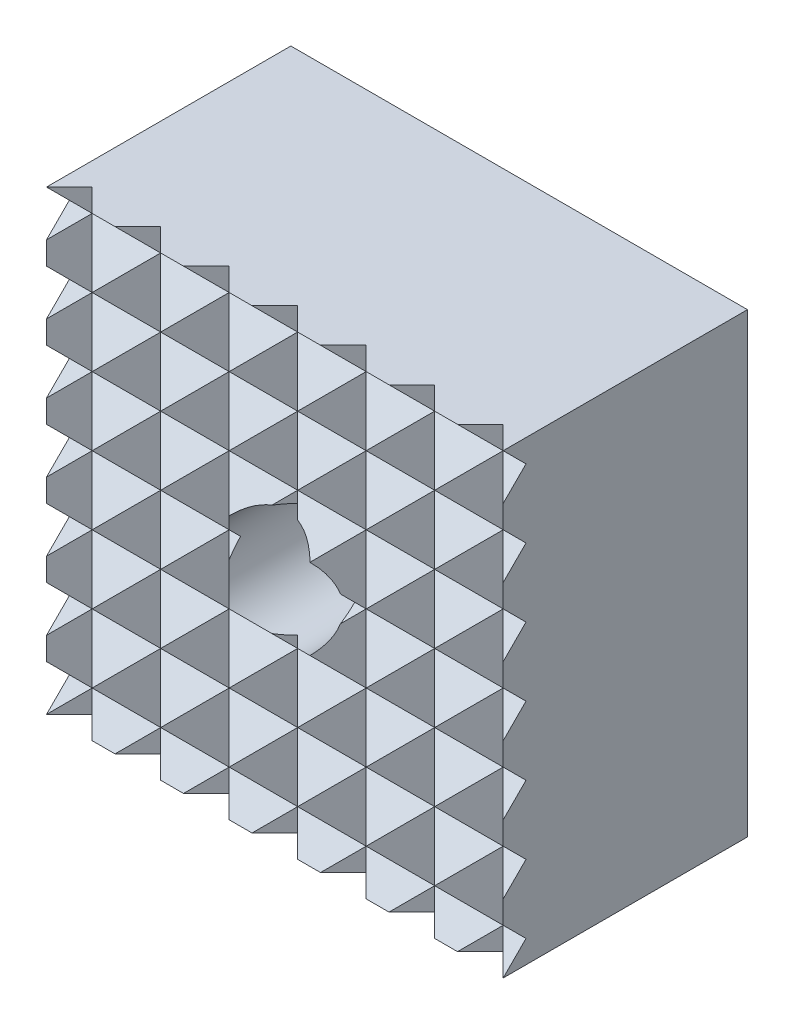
ISO-10303-21;
HEADER;
FILE_DESCRIPTION(('STEP AP214'),'2;1');
FILE_NAME('part.step','',(''),(''),'','','');
FILE_SCHEMA(('AUTOMOTIVE_DESIGN { 1 0 10303 214 1 1 1 1 }'));
ENDSEC;
DATA;
#1=APPLICATION_CONTEXT('core data for automotive mechanical design processes');
#2=APPLICATION_PROTOCOL_DEFINITION('international standard','automotive_design',2000,#1);
#3=PRODUCT_CONTEXT('',#1,'mechanical');
#4=PRODUCT('Part','Part','',(#3));
#5=PRODUCT_RELATED_PRODUCT_CATEGORY('part','',(#4));
#6=PRODUCT_DEFINITION_FORMATION('','',#4);
#7=PRODUCT_DEFINITION_CONTEXT('part definition',#1,'design');
#8=PRODUCT_DEFINITION('design','',#6,#7);
#9=PRODUCT_DEFINITION_SHAPE('','',#8);
#10=(LENGTH_UNIT() NAMED_UNIT(*) SI_UNIT(.MILLI.,.METRE.));
#11=(NAMED_UNIT(*) PLANE_ANGLE_UNIT() SI_UNIT($,.RADIAN.));
#12=(NAMED_UNIT(*) SI_UNIT($,.STERADIAN.) SOLID_ANGLE_UNIT());
#13=UNCERTAINTY_MEASURE_WITH_UNIT(LENGTH_MEASURE(1.E-05),#10,'distance_accuracy_value','');
#14=(GEOMETRIC_REPRESENTATION_CONTEXT(3) GLOBAL_UNCERTAINTY_ASSIGNED_CONTEXT((#13)) GLOBAL_UNIT_ASSIGNED_CONTEXT((#10,
#11,#12)) REPRESENTATION_CONTEXT('',''));
#15=CARTESIAN_POINT('',(0.,0.,0.));
#16=DIRECTION('',(0.,0.,1.));
#17=DIRECTION('',(1.,0.,0.));
#18=AXIS2_PLACEMENT_3D('',#15,#16,#17);
#19=CARTESIAN_POINT('',(-15.,-3.,10.5));
#20=DIRECTION('',(0.,-0.707106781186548,-0.707106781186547));
#21=DIRECTION('',(0.,0.707106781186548,-0.707106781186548));
#22=AXIS2_PLACEMENT_3D('',#19,#20,#21);
#23=PLANE('',#22);
#24=DIRECTION('',(1.,0.,0.));
#25=VECTOR('',#24,1.);
#26=CARTESIAN_POINT('',(-15.,-3.,10.5));
#27=LINE('',#26,#25);
#28=CARTESIAN_POINT('',(9.,-3.,10.5));
#29=VERTEX_POINT('',#28);
#30=CARTESIAN_POINT('',(10.,-3.,10.5));
#31=VERTEX_POINT('',#30);
#32=EDGE_CURVE('E635',#29,#31,#27,.T.);
#33=ORIENTED_EDGE('',*,*,#32,.F.);
#34=DIRECTION('',(0.577350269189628,-0.577350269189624,0.577350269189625));
#35=VECTOR('',#34,1.);
#36=CARTESIAN_POINT('',(0.999999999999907,5.,2.5));
#37=LINE('',#36,#35);
#38=CARTESIAN_POINT('',(10.,-4.,11.5));
#39=VERTEX_POINT('',#38);
#40=EDGE_CURVE('E889',#29,#39,#37,.T.);
#41=ORIENTED_EDGE('',*,*,#40,.T.);
#42=DIRECTION('',(0.,-0.707106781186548,0.707106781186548));
#43=VECTOR('',#42,1.);
#44=CARTESIAN_POINT('',(10.,-7.25,14.75));
#45=LINE('',#44,#43);
#46=EDGE_CURVE('E789',#31,#39,#45,.T.);
#47=ORIENTED_EDGE('',*,*,#46,.F.);
#48=EDGE_LOOP('',(#33,#41,#47));
#49=FACE_BOUND('',#48,.T.);
#50=ADVANCED_FACE('F14',(#49),#23,.F.);
#51=DIRECTION('',(0.577350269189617,-0.57735026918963,0.57735026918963));
#52=VECTOR('',#51,1.);
#53=CARTESIAN_POINT('',(-4.99999999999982,1.99999999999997,5.5));
#54=LINE('',#53,#52);
#55=CARTESIAN_POINT('',(0.,-3.,10.5));
#56=VERTEX_POINT('',#55);
#57=CARTESIAN_POINT('',(1.5,-4.5,12.));
#58=VERTEX_POINT('',#57);
#59=EDGE_CURVE('E1167',#56,#58,#54,.T.);
#60=ORIENTED_EDGE('',*,*,#59,.T.);
#61=DIRECTION('',(0.577350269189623,0.577350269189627,-0.577350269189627));
#62=VECTOR('',#61,1.);
#63=CARTESIAN_POINT('',(-2.99999999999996,-9.,16.5));
#64=LINE('',#63,#62);
#65=CARTESIAN_POINT('',(3.,-3.,10.5));
#66=VERTEX_POINT('',#65);
#67=EDGE_CURVE('E1123',#58,#66,#64,.T.);
#68=ORIENTED_EDGE('',*,*,#67,.T.);
#69=EDGE_CURVE('E844',#56,#66,#27,.T.);
#70=ORIENTED_EDGE('',*,*,#69,.F.);
#71=EDGE_LOOP('',(#60,#68,#70));
#72=FACE_BOUND('',#71,.T.);
#73=ADVANCED_FACE('F1642',(#72),#23,.F.);
#74=DIRECTION('',(0.,0.707106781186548,-0.707106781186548));
#75=VECTOR('',#74,1.);
#76=CARTESIAN_POINT('',(-10.,2.75,4.75));
#77=LINE('',#76,#75);
#78=CARTESIAN_POINT('',(-10.,-4.,11.5));
#79=VERTEX_POINT('',#78);
#80=CARTESIAN_POINT('',(-10.,-3.,10.5));
#81=VERTEX_POINT('',#80);
#82=EDGE_CURVE('E710',#79,#81,#77,.T.);
#83=ORIENTED_EDGE('',*,*,#82,.F.);
#84=DIRECTION('',(0.577350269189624,0.577350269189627,-0.577350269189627));
#85=VECTOR('',#84,1.);
#86=CARTESIAN_POINT('',(-11.,-5.,12.5));
#87=LINE('',#86,#85);
#88=CARTESIAN_POINT('',(-9.,-3.,10.5));
#89=VERTEX_POINT('',#88);
#90=EDGE_CURVE('E1435',#79,#89,#87,.T.);
#91=ORIENTED_EDGE('',*,*,#90,.T.);
#92=EDGE_CURVE('E630',#81,#89,#27,.T.);
#93=ORIENTED_EDGE('',*,*,#92,.F.);
#94=EDGE_LOOP('',(#83,#91,#93));
#95=FACE_BOUND('',#94,.T.);
#96=ADVANCED_FACE('F1649',(#95),#23,.F.);
#97=DIRECTION('',(0.577350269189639,-0.577350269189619,0.577350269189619));
#98=VECTOR('',#97,1.);
#99=CARTESIAN_POINT('',(-7.0000000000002,1.00000000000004,6.5));
#100=LINE('',#99,#98);
#101=CARTESIAN_POINT('',(-3.,-3.,10.5));
#102=VERTEX_POINT('',#101);
#103=CARTESIAN_POINT('',(-1.49999999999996,-4.5,12.));
#104=VERTEX_POINT('',#103);
#105=EDGE_CURVE('E856',#102,#104,#100,.T.);
#106=ORIENTED_EDGE('',*,*,#105,.T.);
#107=DIRECTION('',(0.577350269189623,0.577350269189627,-0.577350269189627));
#108=VECTOR('',#107,1.);
#109=CARTESIAN_POINT('',(-4.99999999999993,-8.,15.5));
#110=LINE('',#109,#108);
#111=EDGE_CURVE('E852',#104,#56,#110,.T.);
#112=ORIENTED_EDGE('',*,*,#111,.T.);
#113=EDGE_CURVE('E855',#102,#56,#27,.T.);
#114=ORIENTED_EDGE('',*,*,#113,.F.);
#115=EDGE_LOOP('',(#106,#112,#114));
#116=FACE_BOUND('',#115,.T.);
#117=ADVANCED_FACE('F854',(#116),#23,.F.);
#118=CARTESIAN_POINT('',(-15.,-4.5,12.));
#119=DIRECTION('',(0.,0.707106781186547,-0.707106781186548));
#120=DIRECTION('',(0.,0.707106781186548,0.707106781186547));
#121=AXIS2_PLACEMENT_3D('',#118,#119,#120);
#122=PLANE('',#121);
#123=DIRECTION('',(0.,-0.707106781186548,-0.707106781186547));
#124=VECTOR('',#123,1.);
#125=CARTESIAN_POINT('',(10.,-7.25,9.25));
#126=LINE('',#125,#124);
#127=CARTESIAN_POINT('',(10.,-5.,11.5));
#128=VERTEX_POINT('',#127);
#129=CARTESIAN_POINT('',(10.,-6.,10.5));
#130=VERTEX_POINT('',#129);
#131=EDGE_CURVE('E792',#128,#130,#126,.T.);
#132=ORIENTED_EDGE('',*,*,#131,.F.);
#133=DIRECTION('',(-0.577350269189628,-0.577350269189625,-0.577350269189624));
#134=VECTOR('',#133,1.);
#135=CARTESIAN_POINT('',(1.99999999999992,-13.,3.5));
#136=LINE('',#135,#134);
#137=CARTESIAN_POINT('',(9.,-6.,10.5));
#138=VERTEX_POINT('',#137);
#139=EDGE_CURVE('E910',#128,#138,#136,.T.);
#140=ORIENTED_EDGE('',*,*,#139,.T.);
#141=DIRECTION('',(1.,0.,0.));
#142=VECTOR('',#141,1.);
#143=CARTESIAN_POINT('',(-15.,-6.,10.5));
#144=LINE('',#143,#142);
#145=EDGE_CURVE('E640',#138,#130,#144,.T.);
#146=ORIENTED_EDGE('',*,*,#145,.T.);
#147=EDGE_LOOP('',(#132,#140,#146));
#148=FACE_BOUND('',#147,.T.);
#149=ADVANCED_FACE('F1675',(#148),#122,.F.);
#150=CARTESIAN_POINT('',(-10.,-6.,10.5));
#151=VERTEX_POINT('',#150);
#152=CARTESIAN_POINT('',(-9.,-6.,10.5));
#153=VERTEX_POINT('',#152);
#154=EDGE_CURVE('E636',#151,#153,#144,.T.);
#155=ORIENTED_EDGE('',*,*,#154,.T.);
#156=DIRECTION('',(-0.577350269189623,0.577350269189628,0.577350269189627));
#157=VECTOR('',#156,1.);
#158=CARTESIAN_POINT('',(-12.,-3.,13.5));
#159=LINE('',#158,#157);
#160=CARTESIAN_POINT('',(-10.,-5.,11.5));
#161=VERTEX_POINT('',#160);
#162=EDGE_CURVE('E1449',#153,#161,#159,.T.);
#163=ORIENTED_EDGE('',*,*,#162,.T.);
#164=DIRECTION('',(0.,0.707106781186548,0.707106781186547));
#165=VECTOR('',#164,1.);
#166=CARTESIAN_POINT('',(-10.,2.75,19.25));
#167=LINE('',#166,#165);
#168=EDGE_CURVE('E707',#151,#161,#167,.T.);
#169=ORIENTED_EDGE('',*,*,#168,.F.);
#170=EDGE_LOOP('',(#155,#163,#169));
#171=FACE_BOUND('',#170,.T.);
#172=ADVANCED_FACE('F1681',(#171),#122,.F.);
#173=CARTESIAN_POINT('',(-15.,-6.,10.5));
#174=DIRECTION('',(0.,-0.707106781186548,-0.707106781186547));
#175=DIRECTION('',(0.,0.707106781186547,-0.707106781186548));
#176=AXIS2_PLACEMENT_3D('',#173,#174,#175);
#177=PLANE('',#176);
#178=ORIENTED_EDGE('',*,*,#145,.F.);
#179=DIRECTION('',(0.577350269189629,-0.577350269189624,0.577350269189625));
#180=VECTOR('',#179,1.);
#181=CARTESIAN_POINT('',(0.999999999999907,2.,2.5));
#182=LINE('',#181,#180);
#183=CARTESIAN_POINT('',(10.,-7.,11.5));
#184=VERTEX_POINT('',#183);
#185=EDGE_CURVE('E920',#138,#184,#182,.T.);
#186=ORIENTED_EDGE('',*,*,#185,.T.);
#187=DIRECTION('',(0.,-0.707106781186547,0.707106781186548));
#188=VECTOR('',#187,1.);
#189=CARTESIAN_POINT('',(10.,-8.75,13.25));
#190=LINE('',#189,#188);
#191=EDGE_CURVE('E794',#130,#184,#190,.T.);
#192=ORIENTED_EDGE('',*,*,#191,.F.);
#193=EDGE_LOOP('',(#178,#186,#192));
#194=FACE_BOUND('',#193,.T.);
#195=ADVANCED_FACE('F2516',(#194),#177,.F.);
#196=DIRECTION('',(0.,0.707106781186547,-0.707106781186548));
#197=VECTOR('',#196,1.);
#198=CARTESIAN_POINT('',(-10.,1.25,3.25));
#199=LINE('',#198,#197);
#200=CARTESIAN_POINT('',(-10.,-7.,11.5));
#201=VERTEX_POINT('',#200);
#202=EDGE_CURVE('E705',#201,#151,#199,.T.);
#203=ORIENTED_EDGE('',*,*,#202,.F.);
#204=DIRECTION('',(0.577350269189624,0.577350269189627,-0.577350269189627));
#205=VECTOR('',#204,1.);
#206=CARTESIAN_POINT('',(-11.,-8.,12.5));
#207=LINE('',#206,#205);
#208=EDGE_CURVE('E1459',#201,#153,#207,.T.);
#209=ORIENTED_EDGE('',*,*,#208,.T.);
#210=ORIENTED_EDGE('',*,*,#154,.F.);
#211=EDGE_LOOP('',(#203,#209,#210));
#212=FACE_BOUND('',#211,.T.);
#213=ADVANCED_FACE('F2487',(#212),#177,.F.);
#214=CARTESIAN_POINT('',(-15.,-7.5,12.));
#215=DIRECTION('',(0.,0.707106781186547,-0.707106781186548));
#216=DIRECTION('',(0.,0.707106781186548,0.707106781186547));
#217=AXIS2_PLACEMENT_3D('',#214,#215,#216);
#218=PLANE('',#217);
#219=DIRECTION('',(0.,-0.707106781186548,-0.707106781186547));
#220=VECTOR('',#219,1.);
#221=CARTESIAN_POINT('',(10.,-8.75,10.75));
#222=LINE('',#221,#220);
#223=CARTESIAN_POINT('',(10.,-8.,11.5));
#224=VERTEX_POINT('',#223);
#225=CARTESIAN_POINT('',(10.,-9.,10.5));
#226=VERTEX_POINT('',#225);
#227=EDGE_CURVE('E797',#224,#226,#222,.T.);
#228=ORIENTED_EDGE('',*,*,#227,.F.);
#229=DIRECTION('',(-0.577350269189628,-0.577350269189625,-0.577350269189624));
#230=VECTOR('',#229,1.);
#231=CARTESIAN_POINT('',(1.99999999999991,-16.,3.5));
#232=LINE('',#231,#230);
#233=CARTESIAN_POINT('',(9.,-9.,10.5));
#234=VERTEX_POINT('',#233);
#235=EDGE_CURVE('E937',#224,#234,#232,.T.);
#236=ORIENTED_EDGE('',*,*,#235,.T.);
#237=DIRECTION('',(1.,0.,0.));
#238=VECTOR('',#237,1.);
#239=CARTESIAN_POINT('',(-15.,-9.,10.5));
#240=LINE('',#239,#238);
#241=EDGE_CURVE('E645',#234,#226,#240,.T.);
#242=ORIENTED_EDGE('',*,*,#241,.T.);
#243=EDGE_LOOP('',(#228,#236,#242));
#244=FACE_BOUND('',#243,.T.);
#245=ADVANCED_FACE('F1944',(#244),#218,.F.);
#246=CARTESIAN_POINT('',(6.,-9.,10.5));
#247=VERTEX_POINT('',#246);
#248=EDGE_CURVE('E1936',#247,#234,#240,.T.);
#249=ORIENTED_EDGE('',*,*,#248,.T.);
#250=DIRECTION('',(-0.577350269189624,0.577350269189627,0.577350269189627));
#251=VECTOR('',#250,1.);
#252=CARTESIAN_POINT('',(0.,0.,19.5));
#253=LINE('',#252,#251);
#254=CARTESIAN_POINT('',(7.5,-7.5,12.));
#255=VERTEX_POINT('',#254);
#256=EDGE_CURVE('E987',#234,#255,#253,.T.);
#257=ORIENTED_EDGE('',*,*,#256,.T.);
#258=DIRECTION('',(-0.577350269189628,-0.577350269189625,-0.577350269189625));
#259=VECTOR('',#258,1.);
#260=CARTESIAN_POINT('',(0.,-15.,4.5));
#261=LINE('',#260,#259);
#262=EDGE_CURVE('E1030',#255,#247,#261,.T.);
#263=ORIENTED_EDGE('',*,*,#262,.T.);
#264=EDGE_LOOP('',(#249,#257,#263));
#265=FACE_BOUND('',#264,.T.);
#266=ADVANCED_FACE('F1935',(#265),#218,.F.);
#267=CARTESIAN_POINT('',(3.,-9.,10.5));
#268=VERTEX_POINT('',#267);
#269=EDGE_CURVE('E1938',#268,#247,#240,.T.);
#270=ORIENTED_EDGE('',*,*,#269,.T.);
#271=DIRECTION('',(-0.577350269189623,0.577350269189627,0.577350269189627));
#272=VECTOR('',#271,1.);
#273=CARTESIAN_POINT('',(-2.,-1.00000000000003,18.5));
#274=LINE('',#273,#272);
#275=CARTESIAN_POINT('',(4.49999999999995,-7.5,12.));
#276=VERTEX_POINT('',#275);
#277=EDGE_CURVE('E1072',#247,#276,#274,.T.);
#278=ORIENTED_EDGE('',*,*,#277,.T.);
#279=DIRECTION('',(-0.577350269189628,-0.577350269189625,-0.577350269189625));
#280=VECTOR('',#279,1.);
#281=CARTESIAN_POINT('',(-2.00000000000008,-14.,5.5));
#282=LINE('',#281,#280);
#283=EDGE_CURVE('E1115',#276,#268,#282,.T.);
#284=ORIENTED_EDGE('',*,*,#283,.T.);
#285=EDGE_LOOP('',(#270,#278,#284));
#286=FACE_BOUND('',#285,.T.);
#287=ADVANCED_FACE('F2160',(#286),#218,.F.);
#288=CARTESIAN_POINT('',(0.,-9.,10.5));
#289=VERTEX_POINT('',#288);
#290=EDGE_CURVE('E2161',#289,#268,#240,.T.);
#291=ORIENTED_EDGE('',*,*,#290,.T.);
#292=DIRECTION('',(-0.577350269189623,0.577350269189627,0.577350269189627));
#293=VECTOR('',#292,1.);
#294=CARTESIAN_POINT('',(-3.99999999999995,-2.,17.5));
#295=LINE('',#294,#293);
#296=CARTESIAN_POINT('',(1.5,-7.5,12.));
#297=VERTEX_POINT('',#296);
#298=EDGE_CURVE('E1157',#268,#297,#295,.T.);
#299=ORIENTED_EDGE('',*,*,#298,.T.);
#300=DIRECTION('',(-0.577350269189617,-0.57735026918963,-0.57735026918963));
#301=VECTOR('',#300,1.);
#302=CARTESIAN_POINT('',(-3.99999999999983,-13.,6.5));
#303=LINE('',#302,#301);
#304=EDGE_CURVE('E1177',#297,#289,#303,.T.);
#305=ORIENTED_EDGE('',*,*,#304,.T.);
#306=EDGE_LOOP('',(#291,#299,#305));
#307=FACE_BOUND('',#306,.T.);
#308=ADVANCED_FACE('F2319',(#307),#218,.F.);
#309=CARTESIAN_POINT('',(-10.,-9.,10.5));
#310=VERTEX_POINT('',#309);
#311=CARTESIAN_POINT('',(-9.,-9.,10.5));
#312=VERTEX_POINT('',#311);
#313=EDGE_CURVE('E641',#310,#312,#240,.T.);
#314=ORIENTED_EDGE('',*,*,#313,.T.);
#315=DIRECTION('',(-0.577350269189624,0.577350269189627,0.577350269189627));
#316=VECTOR('',#315,1.);
#317=CARTESIAN_POINT('',(-12.,-6.,13.5));
#318=LINE('',#317,#316);
#319=CARTESIAN_POINT('',(-10.,-8.,11.5));
#320=VERTEX_POINT('',#319);
#321=EDGE_CURVE('E1470',#312,#320,#318,.T.);
#322=ORIENTED_EDGE('',*,*,#321,.T.);
#323=DIRECTION('',(0.,0.707106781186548,0.707106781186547));
#324=VECTOR('',#323,1.);
#325=CARTESIAN_POINT('',(-10.,1.25,20.75));
#326=LINE('',#325,#324);
#327=EDGE_CURVE('E702',#310,#320,#326,.T.);
#328=ORIENTED_EDGE('',*,*,#327,.F.);
#329=EDGE_LOOP('',(#314,#322,#328));
#330=FACE_BOUND('',#329,.T.);
#331=ADVANCED_FACE('F1535',(#330),#218,.F.);
#332=DIRECTION('',(-0.577350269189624,0.577350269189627,0.577350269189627));
#333=VECTOR('',#332,1.);
#334=CARTESIAN_POINT('',(-10.,-5.,14.5));
#335=LINE('',#334,#333);
#336=CARTESIAN_POINT('',(-6.,-9.,10.5));
#337=VERTEX_POINT('',#336);
#338=CARTESIAN_POINT('',(-7.5,-7.5,12.));
#339=VERTEX_POINT('',#338);
#340=EDGE_CURVE('E1384',#337,#339,#335,.T.);
#341=ORIENTED_EDGE('',*,*,#340,.T.);
#342=DIRECTION('',(-0.577350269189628,-0.577350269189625,-0.577350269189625));
#343=VECTOR('',#342,1.);
#344=CARTESIAN_POINT('',(-10.,-10.,9.5));
#345=LINE('',#344,#343);
#346=EDGE_CURVE('E1427',#339,#312,#345,.T.);
#347=ORIENTED_EDGE('',*,*,#346,.T.);
#348=EDGE_CURVE('E644',#312,#337,#240,.T.);
#349=ORIENTED_EDGE('',*,*,#348,.T.);
#350=EDGE_LOOP('',(#341,#347,#349));
#351=FACE_BOUND('',#350,.T.);
#352=ADVANCED_FACE('F2171',(#351),#218,.F.);
#353=CARTESIAN_POINT('',(-3.,-9.,10.5));
#354=VERTEX_POINT('',#353);
#355=EDGE_CURVE('E2162',#354,#289,#240,.T.);
#356=ORIENTED_EDGE('',*,*,#355,.T.);
#357=DIRECTION('',(-0.577350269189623,0.577350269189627,0.577350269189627));
#358=VECTOR('',#357,1.);
#359=CARTESIAN_POINT('',(-5.99999999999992,-3.,16.5));
#360=LINE('',#359,#358);
#361=CARTESIAN_POINT('',(-1.49999999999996,-7.5,12.));
#362=VERTEX_POINT('',#361);
#363=EDGE_CURVE('E1211',#289,#362,#360,.T.);
#364=ORIENTED_EDGE('',*,*,#363,.T.);
#365=DIRECTION('',(-0.577350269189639,-0.577350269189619,-0.577350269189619));
#366=VECTOR('',#365,1.);
#367=CARTESIAN_POINT('',(-6.00000000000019,-12.,7.5));
#368=LINE('',#367,#366);
#369=EDGE_CURVE('E1271',#362,#354,#368,.T.);
#370=ORIENTED_EDGE('',*,*,#369,.T.);
#371=EDGE_LOOP('',(#356,#364,#370));
#372=FACE_BOUND('',#371,.T.);
#373=ADVANCED_FACE('F2331',(#372),#218,.F.);
#374=CARTESIAN_POINT('',(-15.,-9.,10.5));
#375=DIRECTION('',(0.,-0.707106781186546,-0.70710678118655));
#376=DIRECTION('',(0.,0.70710678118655,-0.707106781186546));
#377=AXIS2_PLACEMENT_3D('',#374,#375,#376);
#378=PLANE('',#377);
#379=DIRECTION('',(1.,0.,0.));
#380=VECTOR('',#379,1.);
#381=CARTESIAN_POINT('',(10.,-10.,11.5));
#382=LINE('',#381,#380);
#383=CARTESIAN_POINT('',(-2.,-10.,11.5));
#384=VERTEX_POINT('',#383);
#385=CARTESIAN_POINT('',(-0.999999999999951,-10.,11.5));
#386=VERTEX_POINT('',#385);
#387=EDGE_CURVE('E613',#384,#386,#382,.T.);
#388=ORIENTED_EDGE('',*,*,#387,.T.);
#389=DIRECTION('',(0.577350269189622,0.577350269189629,-0.577350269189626));
#390=VECTOR('',#389,1.);
#391=CARTESIAN_POINT('',(-4.99999999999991,-14.,15.5));
#392=LINE('',#391,#390);
#393=EDGE_CURVE('E1214',#386,#289,#392,.T.);
#394=ORIENTED_EDGE('',*,*,#393,.T.);
#395=ORIENTED_EDGE('',*,*,#355,.F.);
#396=DIRECTION('',(0.577350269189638,-0.577350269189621,0.577350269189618));
#397=VECTOR('',#396,1.);
#398=CARTESIAN_POINT('',(-7.00000000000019,-5.,6.5));
#399=LINE('',#398,#397);
#400=EDGE_CURVE('E603',#354,#384,#399,.T.);
#401=ORIENTED_EDGE('',*,*,#400,.T.);
#402=EDGE_LOOP('',(#388,#394,#395,#401));
#403=FACE_BOUND('',#402,.T.);
#404=ADVANCED_FACE('F2332',(#403),#378,.F.);
#405=ORIENTED_EDGE('',*,*,#290,.F.);
#406=DIRECTION('',(0.577350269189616,-0.577350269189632,0.577350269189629));
#407=VECTOR('',#406,1.);
#408=CARTESIAN_POINT('',(-4.99999999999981,-4.,5.5));
#409=LINE('',#408,#407);
#410=CARTESIAN_POINT('',(1.,-10.,11.5));
#411=VERTEX_POINT('',#410);
#412=EDGE_CURVE('E1180',#289,#411,#409,.T.);
#413=ORIENTED_EDGE('',*,*,#412,.T.);
#414=CARTESIAN_POINT('',(2.,-10.,11.5));
#415=VERTEX_POINT('',#414);
#416=EDGE_CURVE('E1833',#411,#415,#382,.T.);
#417=ORIENTED_EDGE('',*,*,#416,.T.);
#418=DIRECTION('',(0.577350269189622,0.577350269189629,-0.577350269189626));
#419=VECTOR('',#418,1.);
#420=CARTESIAN_POINT('',(-2.99999999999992,-15.,16.5));
#421=LINE('',#420,#419);
#422=EDGE_CURVE('E1162',#415,#268,#421,.T.);
#423=ORIENTED_EDGE('',*,*,#422,.T.);
#424=EDGE_LOOP('',(#405,#413,#417,#423));
#425=FACE_BOUND('',#424,.T.);
#426=ADVANCED_FACE('F2337',(#425),#378,.F.);
#427=ORIENTED_EDGE('',*,*,#269,.F.);
#428=DIRECTION('',(0.577350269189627,-0.577350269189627,0.577350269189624));
#429=VECTOR('',#428,1.);
#430=CARTESIAN_POINT('',(-3.00000000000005,-3.,4.5));
#431=LINE('',#430,#429);
#432=CARTESIAN_POINT('',(4.,-10.,11.5));
#433=VERTEX_POINT('',#432);
#434=EDGE_CURVE('E1118',#268,#433,#431,.T.);
#435=ORIENTED_EDGE('',*,*,#434,.T.);
#436=CARTESIAN_POINT('',(5.,-10.,11.5));
#437=VERTEX_POINT('',#436);
#438=EDGE_CURVE('E697',#433,#437,#382,.T.);
#439=ORIENTED_EDGE('',*,*,#438,.T.);
#440=DIRECTION('',(0.577350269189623,0.577350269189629,-0.577350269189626));
#441=VECTOR('',#440,1.);
#442=CARTESIAN_POINT('',(-0.999999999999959,-16.,17.5));
#443=LINE('',#442,#441);
#444=EDGE_CURVE('E1075',#437,#247,#443,.T.);
#445=ORIENTED_EDGE('',*,*,#444,.T.);
#446=EDGE_LOOP('',(#427,#435,#439,#445));
#447=FACE_BOUND('',#446,.T.);
#448=ADVANCED_FACE('F1842',(#447),#378,.F.);
#449=ORIENTED_EDGE('',*,*,#248,.F.);
#450=DIRECTION('',(0.577350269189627,-0.577350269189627,0.577350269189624));
#451=VECTOR('',#450,1.);
#452=CARTESIAN_POINT('',(-1.00000000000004,-2.,3.5));
#453=LINE('',#452,#451);
#454=CARTESIAN_POINT('',(7.,-10.,11.5));
#455=VERTEX_POINT('',#454);
#456=EDGE_CURVE('E1033',#247,#455,#453,.T.);
#457=ORIENTED_EDGE('',*,*,#456,.T.);
#458=CARTESIAN_POINT('',(8.,-10.,11.5));
#459=VERTEX_POINT('',#458);
#460=EDGE_CURVE('E694',#455,#459,#382,.T.);
#461=ORIENTED_EDGE('',*,*,#460,.T.);
#462=DIRECTION('',(0.577350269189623,0.577350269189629,-0.577350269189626));
#463=VECTOR('',#462,1.);
#464=CARTESIAN_POINT('',(1.00000000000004,-17.,18.5));
#465=LINE('',#464,#463);
#466=EDGE_CURVE('E990',#459,#234,#465,.T.);
#467=ORIENTED_EDGE('',*,*,#466,.T.);
#468=EDGE_LOOP('',(#449,#457,#461,#467));
#469=FACE_BOUND('',#468,.T.);
#470=ADVANCED_FACE('F1939',(#469),#378,.F.);
#471=DIRECTION('',(0.,0.70710678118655,-0.707106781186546));
#472=VECTOR('',#471,1.);
#473=CARTESIAN_POINT('',(-10.,-0.249999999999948,1.75));
#474=LINE('',#473,#472);
#475=CARTESIAN_POINT('',(-10.,-10.,11.5));
#476=VERTEX_POINT('',#475);
#477=EDGE_CURVE('E699',#476,#310,#474,.T.);
#478=ORIENTED_EDGE('',*,*,#477,.F.);
#479=DIRECTION('',(0.577350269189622,0.577350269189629,-0.577350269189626));
#480=VECTOR('',#479,1.);
#481=CARTESIAN_POINT('',(-11.,-11.,12.5));
#482=LINE('',#481,#480);
#483=EDGE_CURVE('E1476',#476,#312,#482,.T.);
#484=ORIENTED_EDGE('',*,*,#483,.T.);
#485=ORIENTED_EDGE('',*,*,#313,.F.);
#486=EDGE_LOOP('',(#478,#484,#485));
#487=FACE_BOUND('',#486,.T.);
#488=ADVANCED_FACE('F1531',(#487),#378,.F.);
#489=ORIENTED_EDGE('',*,*,#348,.F.);
#490=DIRECTION('',(0.577350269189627,-0.577350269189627,0.577350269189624));
#491=VECTOR('',#490,1.);
#492=CARTESIAN_POINT('',(-11.,-7.,8.5));
#493=LINE('',#492,#491);
#494=CARTESIAN_POINT('',(-8.00000000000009,-10.,11.5));
#495=VERTEX_POINT('',#494);
#496=EDGE_CURVE('E1430',#312,#495,#493,.T.);
#497=ORIENTED_EDGE('',*,*,#496,.T.);
#498=CARTESIAN_POINT('',(-7.,-10.,11.5));
#499=VERTEX_POINT('',#498);
#500=EDGE_CURVE('E698',#495,#499,#382,.T.);
#501=ORIENTED_EDGE('',*,*,#500,.T.);
#502=DIRECTION('',(0.577350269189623,0.577350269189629,-0.577350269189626));
#503=VECTOR('',#502,1.);
#504=CARTESIAN_POINT('',(-9.,-12.,13.5));
#505=LINE('',#504,#503);
#506=EDGE_CURVE('E1387',#499,#337,#505,.T.);
#507=ORIENTED_EDGE('',*,*,#506,.T.);
#508=EDGE_LOOP('',(#489,#497,#501,#507));
#509=FACE_BOUND('',#508,.T.);
#510=ADVANCED_FACE('F2173',(#509),#378,.F.);
#511=ORIENTED_EDGE('',*,*,#241,.F.);
#512=DIRECTION('',(0.577350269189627,-0.577350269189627,0.577350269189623));
#513=VECTOR('',#512,1.);
#514=CARTESIAN_POINT('',(0.999999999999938,-0.999999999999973,2.5));
#515=LINE('',#514,#513);
#516=CARTESIAN_POINT('',(10.,-10.,11.5));
#517=VERTEX_POINT('',#516);
#518=EDGE_CURVE('E943',#234,#517,#515,.T.);
#519=ORIENTED_EDGE('',*,*,#518,.T.);
#520=DIRECTION('',(0.,-0.70710678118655,0.707106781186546));
#521=VECTOR('',#520,1.);
#522=CARTESIAN_POINT('',(10.,-10.25,11.75));
#523=LINE('',#522,#521);
#524=EDGE_CURVE('E799',#226,#517,#523,.T.);
#525=ORIENTED_EDGE('',*,*,#524,.F.);
#526=EDGE_LOOP('',(#511,#519,#525));
#527=FACE_BOUND('',#526,.T.);
#528=ADVANCED_FACE('F1948',(#527),#378,.F.);
#529=CARTESIAN_POINT('',(-15.,9.,10.5));
#530=DIRECTION('',(0.,-0.707106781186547,-0.707106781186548));
#531=DIRECTION('',(0.,0.707106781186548,-0.707106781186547));
#532=AXIS2_PLACEMENT_3D('',#529,#530,#531);
#533=PLANE('',#532);
#534=DIRECTION('',(1.,0.,0.));
#535=VECTOR('',#534,1.);
#536=CARTESIAN_POINT('',(-15.,9.,10.5));
#537=LINE('',#536,#535);
#538=CARTESIAN_POINT('',(9.,9.,10.5));
#539=VERTEX_POINT('',#538);
#540=CARTESIAN_POINT('',(10.,9.,10.5));
#541=VERTEX_POINT('',#540);
#542=EDGE_CURVE('E650',#539,#541,#537,.T.);
#543=ORIENTED_EDGE('',*,*,#542,.F.);
#544=DIRECTION('',(0.577350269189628,-0.577350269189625,0.577350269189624));
#545=VECTOR('',#544,1.);
#546=CARTESIAN_POINT('',(0.999999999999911,17.,2.5));
#547=LINE('',#546,#545);
#548=CARTESIAN_POINT('',(10.,8.,11.5));
#549=VERTEX_POINT('',#548);
#550=EDGE_CURVE('E940',#539,#549,#547,.T.);
#551=ORIENTED_EDGE('',*,*,#550,.T.);
#552=DIRECTION('',(0.,-0.707106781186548,0.707106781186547));
#553=VECTOR('',#552,1.);
#554=CARTESIAN_POINT('',(10.,-1.25,20.75));
#555=LINE('',#554,#553);
#556=EDGE_CURVE('E786',#541,#549,#555,.T.);
#557=ORIENTED_EDGE('',*,*,#556,.F.);
#558=EDGE_LOOP('',(#543,#551,#557));
#559=FACE_BOUND('',#558,.T.);
#560=ADVANCED_FACE('F1613',(#559),#533,.F.);
#561=DIRECTION('',(0.577350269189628,-0.577350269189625,0.577350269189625));
#562=VECTOR('',#561,1.);
#563=CARTESIAN_POINT('',(-1.00000000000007,16.,3.5));
#564=LINE('',#563,#562);
#565=CARTESIAN_POINT('',(6.,9.,10.5));
#566=VERTEX_POINT('',#565);
#567=CARTESIAN_POINT('',(7.5,7.5,12.));
#568=VERTEX_POINT('',#567);
#569=EDGE_CURVE('E1013',#566,#568,#564,.T.);
#570=ORIENTED_EDGE('',*,*,#569,.T.);
#571=DIRECTION('',(0.577350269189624,0.577350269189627,-0.577350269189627));
#572=VECTOR('',#571,1.);
#573=CARTESIAN_POINT('',(1.,1.00000000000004,18.5));
#574=LINE('',#573,#572);
#575=EDGE_CURVE('E971',#568,#539,#574,.T.);
#576=ORIENTED_EDGE('',*,*,#575,.T.);
#577=EDGE_CURVE('E1601',#566,#539,#537,.T.);
#578=ORIENTED_EDGE('',*,*,#577,.F.);
#579=EDGE_LOOP('',(#570,#576,#578));
#580=FACE_BOUND('',#579,.T.);
#581=ADVANCED_FACE('F3791',(#580),#533,.F.);
#582=DIRECTION('',(0.577350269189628,-0.577350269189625,0.577350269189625));
#583=VECTOR('',#582,1.);
#584=CARTESIAN_POINT('',(-3.00000000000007,15.,4.5));
#585=LINE('',#584,#583);
#586=CARTESIAN_POINT('',(3.,9.,10.5));
#587=VERTEX_POINT('',#586);
#588=CARTESIAN_POINT('',(4.5,7.5,12.));
#589=VERTEX_POINT('',#588);
#590=EDGE_CURVE('E1098',#587,#589,#585,.T.);
#591=ORIENTED_EDGE('',*,*,#590,.T.);
#592=DIRECTION('',(0.577350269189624,0.577350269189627,-0.577350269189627));
#593=VECTOR('',#592,1.);
#594=CARTESIAN_POINT('',(-0.999999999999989,2.00000000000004,17.5));
#595=LINE('',#594,#593);
#596=EDGE_CURVE('E1056',#589,#566,#595,.T.);
#597=ORIENTED_EDGE('',*,*,#596,.T.);
#598=EDGE_CURVE('E1597',#587,#566,#537,.T.);
#599=ORIENTED_EDGE('',*,*,#598,.F.);
#600=EDGE_LOOP('',(#591,#597,#599));
#601=FACE_BOUND('',#600,.T.);
#602=ADVANCED_FACE('F3783',(#601),#533,.F.);
#603=DIRECTION('',(0.577350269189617,-0.57735026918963,0.57735026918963));
#604=VECTOR('',#603,1.);
#605=CARTESIAN_POINT('',(-4.99999999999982,14.,5.5));
#606=LINE('',#605,#604);
#607=CARTESIAN_POINT('',(0.,9.,10.5));
#608=VERTEX_POINT('',#607);
#609=CARTESIAN_POINT('',(1.5,7.5,12.));
#610=VERTEX_POINT('',#609);
#611=EDGE_CURVE('E1197',#608,#610,#606,.T.);
#612=ORIENTED_EDGE('',*,*,#611,.T.);
#613=DIRECTION('',(0.577350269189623,0.577350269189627,-0.577350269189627));
#614=VECTOR('',#613,1.);
#615=CARTESIAN_POINT('',(-2.99999999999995,3.,16.5));
#616=LINE('',#615,#614);
#617=EDGE_CURVE('E1149',#610,#587,#616,.T.);
#618=ORIENTED_EDGE('',*,*,#617,.T.);
#619=EDGE_CURVE('E1593',#608,#587,#537,.T.);
#620=ORIENTED_EDGE('',*,*,#619,.F.);
#621=EDGE_LOOP('',(#612,#618,#620));
#622=FACE_BOUND('',#621,.T.);
#623=ADVANCED_FACE('F2234',(#622),#533,.F.);
#624=DIRECTION('',(0.,0.707106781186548,-0.707106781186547));
#625=VECTOR('',#624,1.);
#626=CARTESIAN_POINT('',(-10.,8.75,10.75));
#627=LINE('',#626,#625);
#628=CARTESIAN_POINT('',(-10.,8.,11.5));
#629=VERTEX_POINT('',#628);
#630=CARTESIAN_POINT('',(-10.,9.,10.5));
#631=VERTEX_POINT('',#630);
#632=EDGE_CURVE('E692',#629,#631,#627,.T.);
#633=ORIENTED_EDGE('',*,*,#632,.F.);
#634=DIRECTION('',(0.577350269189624,0.577350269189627,-0.577350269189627));
#635=VECTOR('',#634,1.);
#636=CARTESIAN_POINT('',(-11.,7.,12.5));
#637=LINE('',#636,#635);
#638=CARTESIAN_POINT('',(-9.,9.,10.5));
#639=VERTEX_POINT('',#638);
#640=EDGE_CURVE('E1473',#629,#639,#637,.T.);
#641=ORIENTED_EDGE('',*,*,#640,.T.);
#642=EDGE_CURVE('E646',#631,#639,#537,.T.);
#643=ORIENTED_EDGE('',*,*,#642,.F.);
#644=EDGE_LOOP('',(#633,#641,#643));
#645=FACE_BOUND('',#644,.T.);
#646=ADVANCED_FACE('F1716',(#645),#533,.F.);
#647=CARTESIAN_POINT('',(-6.,9.,10.5));
#648=VERTEX_POINT('',#647);
#649=EDGE_CURVE('E649',#639,#648,#537,.T.);
#650=ORIENTED_EDGE('',*,*,#649,.F.);
#651=DIRECTION('',(0.577350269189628,-0.577350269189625,0.577350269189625));
#652=VECTOR('',#651,1.);
#653=CARTESIAN_POINT('',(-11.,11.,8.5));
#654=LINE('',#653,#652);
#655=CARTESIAN_POINT('',(-7.5,7.5,12.));
#656=VERTEX_POINT('',#655);
#657=EDGE_CURVE('E1410',#639,#656,#654,.T.);
#658=ORIENTED_EDGE('',*,*,#657,.T.);
#659=DIRECTION('',(0.577350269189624,0.577350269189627,-0.577350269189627));
#660=VECTOR('',#659,1.);
#661=CARTESIAN_POINT('',(-9.,6.,13.5));
#662=LINE('',#661,#660);
#663=EDGE_CURVE('E1367',#656,#648,#662,.T.);
#664=ORIENTED_EDGE('',*,*,#663,.T.);
#665=EDGE_LOOP('',(#650,#658,#664));
#666=FACE_BOUND('',#665,.T.);
#667=ADVANCED_FACE('F1724',(#666),#533,.F.);
#668=DIRECTION('',(0.577350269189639,-0.577350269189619,0.577350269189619));
#669=VECTOR('',#668,1.);
#670=CARTESIAN_POINT('',(-7.0000000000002,13.,6.5));
#671=LINE('',#670,#669);
#672=CARTESIAN_POINT('',(-3.,9.,10.5));
#673=VERTEX_POINT('',#672);
#674=CARTESIAN_POINT('',(-1.49999999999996,7.5,12.));
#675=VERTEX_POINT('',#674);
#676=EDGE_CURVE('E1262',#673,#675,#671,.T.);
#677=ORIENTED_EDGE('',*,*,#676,.T.);
#678=DIRECTION('',(0.577350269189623,0.577350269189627,-0.577350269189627));
#679=VECTOR('',#678,1.);
#680=CARTESIAN_POINT('',(-4.99999999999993,4.,15.5));
#681=LINE('',#680,#679);
#682=EDGE_CURVE('E1231',#675,#608,#681,.T.);
#683=ORIENTED_EDGE('',*,*,#682,.T.);
#684=EDGE_CURVE('E1590',#673,#608,#537,.T.);
#685=ORIENTED_EDGE('',*,*,#684,.F.);
#686=EDGE_LOOP('',(#677,#683,#685));
#687=FACE_BOUND('',#686,.T.);
#688=ADVANCED_FACE('F2206',(#687),#533,.F.);
#689=CARTESIAN_POINT('',(-15.,7.5,12.));
#690=DIRECTION('',(0.,0.707106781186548,-0.707106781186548));
#691=DIRECTION('',(0.,0.707106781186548,0.707106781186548));
#692=AXIS2_PLACEMENT_3D('',#689,#690,#691);
#693=PLANE('',#692);
#694=DIRECTION('',(0.,-0.707106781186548,-0.707106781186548));
#695=VECTOR('',#694,1.);
#696=CARTESIAN_POINT('',(10.,-1.25,3.25));
#697=LINE('',#696,#695);
#698=CARTESIAN_POINT('',(10.,7.,11.5));
#699=VERTEX_POINT('',#698);
#700=CARTESIAN_POINT('',(10.,6.,10.5));
#701=VERTEX_POINT('',#700);
#702=EDGE_CURVE('E784',#699,#701,#697,.T.);
#703=ORIENTED_EDGE('',*,*,#702,.F.);
#704=DIRECTION('',(-0.577350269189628,-0.577350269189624,-0.577350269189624));
#705=VECTOR('',#704,1.);
#706=CARTESIAN_POINT('',(1.99999999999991,-1.00000000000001,3.5));
#707=LINE('',#706,#705);
#708=CARTESIAN_POINT('',(9.,6.,10.5));
#709=VERTEX_POINT('',#708);
#710=EDGE_CURVE('E934',#699,#709,#707,.T.);
#711=ORIENTED_EDGE('',*,*,#710,.T.);
#712=DIRECTION('',(1.,0.,0.));
#713=VECTOR('',#712,1.);
#714=CARTESIAN_POINT('',(-15.,6.,10.5));
#715=LINE('',#714,#713);
#716=EDGE_CURVE('E654',#709,#701,#715,.T.);
#717=ORIENTED_EDGE('',*,*,#716,.T.);
#718=EDGE_LOOP('',(#703,#711,#717));
#719=FACE_BOUND('',#718,.T.);
#720=ADVANCED_FACE('F2861',(#719),#693,.F.);
#721=CARTESIAN_POINT('',(-10.,6.,10.5));
#722=VERTEX_POINT('',#721);
#723=CARTESIAN_POINT('',(-9.,6.,10.5));
#724=VERTEX_POINT('',#723);
#725=EDGE_CURVE('E651',#722,#724,#715,.T.);
#726=ORIENTED_EDGE('',*,*,#725,.T.);
#727=DIRECTION('',(-0.577350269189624,0.577350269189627,0.577350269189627));
#728=VECTOR('',#727,1.);
#729=CARTESIAN_POINT('',(-12.,9.,13.5));
#730=LINE('',#729,#728);
#731=CARTESIAN_POINT('',(-10.,7.,11.5));
#732=VERTEX_POINT('',#731);
#733=EDGE_CURVE('E1466',#724,#732,#730,.T.);
#734=ORIENTED_EDGE('',*,*,#733,.T.);
#735=DIRECTION('',(0.,0.707106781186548,0.707106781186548));
#736=VECTOR('',#735,1.);
#737=CARTESIAN_POINT('',(-10.,8.75,13.25));
#738=LINE('',#737,#736);
#739=EDGE_CURVE('E689',#722,#732,#738,.T.);
#740=ORIENTED_EDGE('',*,*,#739,.F.);
#741=EDGE_LOOP('',(#726,#734,#740));
#742=FACE_BOUND('',#741,.T.);
#743=ADVANCED_FACE('F2829',(#742),#693,.F.);
#744=CARTESIAN_POINT('',(-15.,6.,10.5));
#745=DIRECTION('',(0.,-0.707106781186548,-0.707106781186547));
#746=DIRECTION('',(0.,0.707106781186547,-0.707106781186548));
#747=AXIS2_PLACEMENT_3D('',#744,#745,#746);
#748=PLANE('',#747);
#749=ORIENTED_EDGE('',*,*,#716,.F.);
#750=DIRECTION('',(0.577350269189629,-0.577350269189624,0.577350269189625));
#751=VECTOR('',#750,1.);
#752=CARTESIAN_POINT('',(0.999999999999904,14.,2.5));
#753=LINE('',#752,#751);
#754=CARTESIAN_POINT('',(10.,5.,11.5));
#755=VERTEX_POINT('',#754);
#756=EDGE_CURVE('E923',#709,#755,#753,.T.);
#757=ORIENTED_EDGE('',*,*,#756,.T.);
#758=DIRECTION('',(0.,-0.707106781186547,0.707106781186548));
#759=VECTOR('',#758,1.);
#760=CARTESIAN_POINT('',(10.,-2.75,19.25));
#761=LINE('',#760,#759);
#762=EDGE_CURVE('E781',#701,#755,#761,.T.);
#763=ORIENTED_EDGE('',*,*,#762,.F.);
#764=EDGE_LOOP('',(#749,#757,#763));
#765=FACE_BOUND('',#764,.T.);
#766=ADVANCED_FACE('F2869',(#765),#748,.F.);
#767=DIRECTION('',(0.,0.707106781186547,-0.707106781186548));
#768=VECTOR('',#767,1.);
#769=CARTESIAN_POINT('',(-10.,7.25,9.25));
#770=LINE('',#769,#768);
#771=CARTESIAN_POINT('',(-10.,5.,11.5));
#772=VERTEX_POINT('',#771);
#773=EDGE_CURVE('E687',#772,#722,#770,.T.);
#774=ORIENTED_EDGE('',*,*,#773,.F.);
#775=DIRECTION('',(0.577350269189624,0.577350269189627,-0.577350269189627));
#776=VECTOR('',#775,1.);
#777=CARTESIAN_POINT('',(-11.,4.,12.5));
#778=LINE('',#777,#776);
#779=EDGE_CURVE('E1463',#772,#724,#778,.T.);
#780=ORIENTED_EDGE('',*,*,#779,.T.);
#781=ORIENTED_EDGE('',*,*,#725,.F.);
#782=EDGE_LOOP('',(#774,#780,#781));
#783=FACE_BOUND('',#782,.T.);
#784=ADVANCED_FACE('F2838',(#783),#748,.F.);
#785=CARTESIAN_POINT('',(-15.,4.5,12.));
#786=DIRECTION('',(0.,0.707106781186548,-0.707106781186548));
#787=DIRECTION('',(0.,0.707106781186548,0.707106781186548));
#788=AXIS2_PLACEMENT_3D('',#785,#786,#787);
#789=PLANE('',#788);
#790=DIRECTION('',(0.,-0.707106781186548,-0.707106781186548));
#791=VECTOR('',#790,1.);
#792=CARTESIAN_POINT('',(10.,-2.75,4.75));
#793=LINE('',#792,#791);
#794=CARTESIAN_POINT('',(10.,4.,11.5));
#795=VERTEX_POINT('',#794);
#796=CARTESIAN_POINT('',(10.,3.,10.5));
#797=VERTEX_POINT('',#796);
#798=EDGE_CURVE('E779',#795,#797,#793,.T.);
#799=ORIENTED_EDGE('',*,*,#798,.F.);
#800=DIRECTION('',(-0.577350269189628,-0.577350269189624,-0.577350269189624));
#801=VECTOR('',#800,1.);
#802=CARTESIAN_POINT('',(1.99999999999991,-4.,3.5));
#803=LINE('',#802,#801);
#804=CARTESIAN_POINT('',(9.,3.,10.5));
#805=VERTEX_POINT('',#804);
#806=EDGE_CURVE('E914',#795,#805,#803,.T.);
#807=ORIENTED_EDGE('',*,*,#806,.T.);
#808=DIRECTION('',(1.,0.,0.));
#809=VECTOR('',#808,1.);
#810=CARTESIAN_POINT('',(-15.,3.,10.5));
#811=LINE('',#810,#809);
#812=EDGE_CURVE('E614',#805,#797,#811,.T.);
#813=ORIENTED_EDGE('',*,*,#812,.T.);
#814=EDGE_LOOP('',(#799,#807,#813));
#815=FACE_BOUND('',#814,.T.);
#816=ADVANCED_FACE('F3115',(#815),#789,.F.);
#817=CARTESIAN_POINT('',(0.,3.,10.5));
#818=VERTEX_POINT('',#817);
#819=CARTESIAN_POINT('',(3.,3.,10.5));
#820=VERTEX_POINT('',#819);
#821=EDGE_CURVE('E2121',#818,#820,#811,.T.);
#822=ORIENTED_EDGE('',*,*,#821,.T.);
#823=DIRECTION('',(-0.577350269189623,0.577350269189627,0.577350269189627));
#824=VECTOR('',#823,1.);
#825=CARTESIAN_POINT('',(-3.99999999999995,10.,17.5));
#826=LINE('',#825,#824);
#827=CARTESIAN_POINT('',(1.5,4.5,12.));
#828=VERTEX_POINT('',#827);
#829=EDGE_CURVE('E1140',#820,#828,#826,.T.);
#830=ORIENTED_EDGE('',*,*,#829,.T.);
#831=DIRECTION('',(-0.577350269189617,-0.57735026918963,-0.57735026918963));
#832=VECTOR('',#831,1.);
#833=CARTESIAN_POINT('',(-3.99999999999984,-0.999999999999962,6.5));
#834=LINE('',#833,#832);
#835=EDGE_CURVE('E1188',#828,#818,#834,.T.);
#836=ORIENTED_EDGE('',*,*,#835,.T.);
#837=EDGE_LOOP('',(#822,#830,#836));
#838=FACE_BOUND('',#837,.T.);
#839=ADVANCED_FACE('F2120',(#838),#789,.F.);
#840=CARTESIAN_POINT('',(-10.,3.,10.5));
#841=VERTEX_POINT('',#840);
#842=CARTESIAN_POINT('',(-9.,3.,10.5));
#843=VERTEX_POINT('',#842);
#844=EDGE_CURVE('E619',#841,#843,#811,.T.);
#845=ORIENTED_EDGE('',*,*,#844,.T.);
#846=DIRECTION('',(-0.577350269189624,0.577350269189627,0.577350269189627));
#847=VECTOR('',#846,1.);
#848=CARTESIAN_POINT('',(-12.,6.,13.5));
#849=LINE('',#848,#847);
#850=CARTESIAN_POINT('',(-10.,4.,11.5));
#851=VERTEX_POINT('',#850);
#852=EDGE_CURVE('E1456',#843,#851,#849,.T.);
#853=ORIENTED_EDGE('',*,*,#852,.T.);
#854=DIRECTION('',(0.,0.707106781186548,0.707106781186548));
#855=VECTOR('',#854,1.);
#856=CARTESIAN_POINT('',(-10.,7.25,14.75));
#857=LINE('',#856,#855);
#858=EDGE_CURVE('E684',#841,#851,#857,.T.);
#859=ORIENTED_EDGE('',*,*,#858,.F.);
#860=EDGE_LOOP('',(#845,#853,#859));
#861=FACE_BOUND('',#860,.T.);
#862=ADVANCED_FACE('F3134',(#861),#789,.F.);
#863=CARTESIAN_POINT('',(-3.,3.,10.5));
#864=VERTEX_POINT('',#863);
#865=EDGE_CURVE('E2123',#864,#818,#811,.T.);
#866=ORIENTED_EDGE('',*,*,#865,.T.);
#867=DIRECTION('',(-0.577350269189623,0.577350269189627,0.577350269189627));
#868=VECTOR('',#867,1.);
#869=CARTESIAN_POINT('',(-5.99999999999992,9.,16.5));
#870=LINE('',#869,#868);
#871=CARTESIAN_POINT('',(-1.49999999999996,4.5,12.));
#872=VERTEX_POINT('',#871);
#873=EDGE_CURVE('E1222',#818,#872,#870,.T.);
#874=ORIENTED_EDGE('',*,*,#873,.T.);
#875=DIRECTION('',(-0.577350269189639,-0.577350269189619,-0.577350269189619));
#876=VECTOR('',#875,1.);
#877=CARTESIAN_POINT('',(-6.00000000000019,0.,7.5));
#878=LINE('',#877,#876);
#879=EDGE_CURVE('E1253',#872,#864,#878,.T.);
#880=ORIENTED_EDGE('',*,*,#879,.T.);
#881=EDGE_LOOP('',(#866,#874,#880));
#882=FACE_BOUND('',#881,.T.);
#883=ADVANCED_FACE('F2271',(#882),#789,.F.);
#884=CARTESIAN_POINT('',(-15.,10.5,12.));
#885=DIRECTION('',(0.,0.707106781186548,-0.707106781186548));
#886=DIRECTION('',(0.,0.707106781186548,0.707106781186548));
#887=AXIS2_PLACEMENT_3D('',#884,#885,#886);
#888=PLANE('',#887);
#889=ORIENTED_EDGE('',*,*,#684,.T.);
#890=DIRECTION('',(-0.577350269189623,0.577350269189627,0.577350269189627));
#891=VECTOR('',#890,1.);
#892=CARTESIAN_POINT('',(-5.99999999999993,15.,16.5));
#893=LINE('',#892,#891);
#894=CARTESIAN_POINT('',(-0.999999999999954,10.,11.5));
#895=VERTEX_POINT('',#894);
#896=EDGE_CURVE('E1234',#608,#895,#893,.T.);
#897=ORIENTED_EDGE('',*,*,#896,.T.);
#898=DIRECTION('',(-1.,0.,0.));
#899=VECTOR('',#898,1.);
#900=CARTESIAN_POINT('',(-10.,10.,11.5));
#901=LINE('',#900,#899);
#902=CARTESIAN_POINT('',(-2.,10.,11.5));
#903=VERTEX_POINT('',#902);
#904=EDGE_CURVE('E2209',#895,#903,#901,.T.);
#905=ORIENTED_EDGE('',*,*,#904,.T.);
#906=DIRECTION('',(-0.577350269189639,-0.577350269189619,-0.577350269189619));
#907=VECTOR('',#906,1.);
#908=CARTESIAN_POINT('',(-6.00000000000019,6.,7.5));
#909=LINE('',#908,#907);
#910=EDGE_CURVE('E1268',#903,#673,#909,.T.);
#911=ORIENTED_EDGE('',*,*,#910,.T.);
#912=EDGE_LOOP('',(#889,#897,#905,#911));
#913=FACE_BOUND('',#912,.T.);
#914=ADVANCED_FACE('F2208',(#913),#888,.F.);
#915=CARTESIAN_POINT('',(2.,10.,11.5));
#916=VERTEX_POINT('',#915);
#917=CARTESIAN_POINT('',(1.00000000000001,10.,11.5));
#918=VERTEX_POINT('',#917);
#919=EDGE_CURVE('E2238',#916,#918,#901,.T.);
#920=ORIENTED_EDGE('',*,*,#919,.T.);
#921=DIRECTION('',(-0.577350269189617,-0.57735026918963,-0.57735026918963));
#922=VECTOR('',#921,1.);
#923=CARTESIAN_POINT('',(-3.99999999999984,5.,6.5));
#924=LINE('',#923,#922);
#925=EDGE_CURVE('E1200',#918,#608,#924,.T.);
#926=ORIENTED_EDGE('',*,*,#925,.T.);
#927=ORIENTED_EDGE('',*,*,#619,.T.);
#928=DIRECTION('',(-0.577350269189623,0.577350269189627,0.577350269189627));
#929=VECTOR('',#928,1.);
#930=CARTESIAN_POINT('',(-3.99999999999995,16.,17.5));
#931=LINE('',#930,#929);
#932=EDGE_CURVE('E1154',#587,#916,#931,.T.);
#933=ORIENTED_EDGE('',*,*,#932,.T.);
#934=EDGE_LOOP('',(#920,#926,#927,#933));
#935=FACE_BOUND('',#934,.T.);
#936=ADVANCED_FACE('F2236',(#935),#888,.F.);
#937=CARTESIAN_POINT('',(4.99999999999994,10.,11.5));
#938=VERTEX_POINT('',#937);
#939=CARTESIAN_POINT('',(4.,10.,11.5));
#940=VERTEX_POINT('',#939);
#941=EDGE_CURVE('E4082',#938,#940,#901,.T.);
#942=ORIENTED_EDGE('',*,*,#941,.T.);
#943=DIRECTION('',(-0.577350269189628,-0.577350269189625,-0.577350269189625));
#944=VECTOR('',#943,1.);
#945=CARTESIAN_POINT('',(-2.00000000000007,4.,5.5));
#946=LINE('',#945,#944);
#947=EDGE_CURVE('E1104',#940,#587,#946,.T.);
#948=ORIENTED_EDGE('',*,*,#947,.T.);
#949=ORIENTED_EDGE('',*,*,#598,.T.);
#950=DIRECTION('',(-0.577350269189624,0.577350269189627,0.577350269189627));
#951=VECTOR('',#950,1.);
#952=CARTESIAN_POINT('',(-2.,17.,18.5));
#953=LINE('',#952,#951);
#954=EDGE_CURVE('E1061',#566,#938,#953,.T.);
#955=ORIENTED_EDGE('',*,*,#954,.T.);
#956=EDGE_LOOP('',(#942,#948,#949,#955));
#957=FACE_BOUND('',#956,.T.);
#958=ADVANCED_FACE('F3671',(#957),#888,.F.);
#959=CARTESIAN_POINT('',(8.,10.,11.5));
#960=VERTEX_POINT('',#959);
#961=CARTESIAN_POINT('',(7.,10.,11.5));
#962=VERTEX_POINT('',#961);
#963=EDGE_CURVE('E778',#960,#962,#901,.T.);
#964=ORIENTED_EDGE('',*,*,#963,.T.);
#965=DIRECTION('',(-0.577350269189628,-0.577350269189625,-0.577350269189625));
#966=VECTOR('',#965,1.);
#967=CARTESIAN_POINT('',(0.,3.,4.5));
#968=LINE('',#967,#966);
#969=EDGE_CURVE('E1019',#962,#566,#968,.T.);
#970=ORIENTED_EDGE('',*,*,#969,.T.);
#971=ORIENTED_EDGE('',*,*,#577,.T.);
#972=DIRECTION('',(-0.577350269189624,0.577350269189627,0.577350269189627));
#973=VECTOR('',#972,1.);
#974=CARTESIAN_POINT('',(0.,18.,19.5));
#975=LINE('',#974,#973);
#976=EDGE_CURVE('E976',#539,#960,#975,.T.);
#977=ORIENTED_EDGE('',*,*,#976,.T.);
#978=EDGE_LOOP('',(#964,#970,#971,#977));
#979=FACE_BOUND('',#978,.T.);
#980=ADVANCED_FACE('F3663',(#979),#888,.F.);
#981=ORIENTED_EDGE('',*,*,#642,.T.);
#982=DIRECTION('',(-0.577350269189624,0.577350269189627,0.577350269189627));
#983=VECTOR('',#982,1.);
#984=CARTESIAN_POINT('',(-12.,12.,13.5));
#985=LINE('',#984,#983);
#986=CARTESIAN_POINT('',(-10.,10.,11.5));
#987=VERTEX_POINT('',#986);
#988=EDGE_CURVE('E1481',#639,#987,#985,.T.);
#989=ORIENTED_EDGE('',*,*,#988,.T.);
#990=DIRECTION('',(0.,0.707106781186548,0.707106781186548));
#991=VECTOR('',#990,1.);
#992=CARTESIAN_POINT('',(-10.,10.25,11.75));
#993=LINE('',#992,#991);
#994=EDGE_CURVE('E681',#631,#987,#993,.T.);
#995=ORIENTED_EDGE('',*,*,#994,.F.);
#996=EDGE_LOOP('',(#981,#989,#995));
#997=FACE_BOUND('',#996,.T.);
#998=ADVANCED_FACE('F1496',(#997),#888,.F.);
#999=CARTESIAN_POINT('',(-7.,10.,11.5));
#1000=VERTEX_POINT('',#999);
#1001=CARTESIAN_POINT('',(-8.,10.,11.5));
#1002=VERTEX_POINT('',#1001);
#1003=EDGE_CURVE('E774',#1000,#1002,#901,.T.);
#1004=ORIENTED_EDGE('',*,*,#1003,.T.);
#1005=DIRECTION('',(-0.577350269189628,-0.577350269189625,-0.577350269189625));
#1006=VECTOR('',#1005,1.);
#1007=CARTESIAN_POINT('',(-10.,8.,9.5));
#1008=LINE('',#1007,#1006);
#1009=EDGE_CURVE('E1416',#1002,#639,#1008,.T.);
#1010=ORIENTED_EDGE('',*,*,#1009,.T.);
#1011=ORIENTED_EDGE('',*,*,#649,.T.);
#1012=DIRECTION('',(-0.577350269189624,0.577350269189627,0.577350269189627));
#1013=VECTOR('',#1012,1.);
#1014=CARTESIAN_POINT('',(-10.,13.,14.5));
#1015=LINE('',#1014,#1013);
#1016=EDGE_CURVE('E1373',#648,#1000,#1015,.T.);
#1017=ORIENTED_EDGE('',*,*,#1016,.T.);
#1018=EDGE_LOOP('',(#1004,#1010,#1011,#1017));
#1019=FACE_BOUND('',#1018,.T.);
#1020=ADVANCED_FACE('F1727',(#1019),#888,.F.);
#1021=DIRECTION('',(0.,-0.707106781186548,-0.707106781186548));
#1022=VECTOR('',#1021,1.);
#1023=CARTESIAN_POINT('',(10.,0.25,1.75));
#1024=LINE('',#1023,#1022);
#1025=CARTESIAN_POINT('',(10.,10.,11.5));
#1026=VERTEX_POINT('',#1025);
#1027=EDGE_CURVE('E678',#1026,#541,#1024,.T.);
#1028=ORIENTED_EDGE('',*,*,#1027,.F.);
#1029=DIRECTION('',(-0.577350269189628,-0.577350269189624,-0.577350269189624));
#1030=VECTOR('',#1029,1.);
#1031=CARTESIAN_POINT('',(1.99999999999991,2.,3.5));
#1032=LINE('',#1031,#1030);
#1033=EDGE_CURVE('E948',#1026,#539,#1032,.T.);
#1034=ORIENTED_EDGE('',*,*,#1033,.T.);
#1035=ORIENTED_EDGE('',*,*,#542,.T.);
#1036=EDGE_LOOP('',(#1028,#1034,#1035));
#1037=FACE_BOUND('',#1036,.T.);
#1038=ADVANCED_FACE('F1611',(#1037),#888,.F.);
#1039=CARTESIAN_POINT('',(-15.,3.,10.5));
#1040=DIRECTION('',(0.,-0.707106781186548,-0.707106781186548));
#1041=DIRECTION('',(0.,0.707106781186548,-0.707106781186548));
#1042=AXIS2_PLACEMENT_3D('',#1039,#1040,#1041);
#1043=PLANE('',#1042);
#1044=CARTESIAN_POINT('',(0.,0.,13.5));
#1045=DIRECTION('',(0.,-0.707106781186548,-0.707106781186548));
#1046=DIRECTION('',(0.,-0.707106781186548,0.707106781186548));
#1047=AXIS2_PLACEMENT_3D('',#1044,#1045,#1046);
#1048=ELLIPSE('',#1047,3.53553390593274,2.5);
#1049=CARTESIAN_POINT('',(-1.76776695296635,1.76776695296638,11.7322330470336));
#1050=VERTEX_POINT('',#1049);
#1051=CARTESIAN_POINT('',(-0.564585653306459,2.4354143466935,11.0645856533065));
#1052=VERTEX_POINT('',#1051);
#1053=EDGE_CURVE('E773',#1050,#1052,#1048,.T.);
#1054=ORIENTED_EDGE('',*,*,#1053,.T.);
#1055=DIRECTION('',(0.577350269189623,0.577350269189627,-0.577350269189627));
#1056=VECTOR('',#1055,1.);
#1057=CARTESIAN_POINT('',(-4.99999999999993,-2.,15.5));
#1058=LINE('',#1057,#1056);
#1059=EDGE_CURVE('E1219',#1052,#818,#1058,.T.);
#1060=ORIENTED_EDGE('',*,*,#1059,.T.);
#1061=ORIENTED_EDGE('',*,*,#865,.F.);
#1062=DIRECTION('',(0.577350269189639,-0.577350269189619,0.577350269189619));
#1063=VECTOR('',#1062,1.);
#1064=CARTESIAN_POINT('',(-7.0000000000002,7.,6.5));
#1065=LINE('',#1064,#1063);
#1066=EDGE_CURVE('E1250',#864,#1050,#1065,.T.);
#1067=ORIENTED_EDGE('',*,*,#1066,.T.);
#1068=EDGE_LOOP('',(#1054,#1060,#1061,#1067));
#1069=FACE_BOUND('',#1068,.T.);
#1070=ADVANCED_FACE('F2275',(#1069),#1043,.F.);
#1071=ORIENTED_EDGE('',*,*,#821,.F.);
#1072=DIRECTION('',(0.577350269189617,-0.57735026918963,0.57735026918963));
#1073=VECTOR('',#1072,1.);
#1074=CARTESIAN_POINT('',(-4.99999999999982,8.,5.5));
#1075=LINE('',#1074,#1073);
#1076=CARTESIAN_POINT('',(0.564585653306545,2.43541434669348,11.0645856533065));
#1077=VERTEX_POINT('',#1076);
#1078=EDGE_CURVE('E1185',#818,#1077,#1075,.T.);
#1079=ORIENTED_EDGE('',*,*,#1078,.T.);
#1080=CARTESIAN_POINT('',(1.76776695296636,1.76776695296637,11.7322330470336));
#1081=VERTEX_POINT('',#1080);
#1082=EDGE_CURVE('E770',#1077,#1081,#1048,.T.);
#1083=ORIENTED_EDGE('',*,*,#1082,.T.);
#1084=DIRECTION('',(0.577350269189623,0.577350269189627,-0.577350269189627));
#1085=VECTOR('',#1084,1.);
#1086=CARTESIAN_POINT('',(-2.99999999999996,-3.,16.5));
#1087=LINE('',#1086,#1085);
#1088=EDGE_CURVE('E1137',#1081,#820,#1087,.T.);
#1089=ORIENTED_EDGE('',*,*,#1088,.T.);
#1090=EDGE_LOOP('',(#1071,#1079,#1083,#1089));
#1091=FACE_BOUND('',#1090,.T.);
#1092=ADVANCED_FACE('F2287',(#1091),#1043,.F.);
#1093=DIRECTION('',(0.,0.707106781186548,-0.707106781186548));
#1094=VECTOR('',#1093,1.);
#1095=CARTESIAN_POINT('',(-10.,5.75,7.75));
#1096=LINE('',#1095,#1094);
#1097=CARTESIAN_POINT('',(-10.,2.00000000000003,11.5));
#1098=VERTEX_POINT('',#1097);
#1099=EDGE_CURVE('E676',#1098,#841,#1096,.T.);
#1100=ORIENTED_EDGE('',*,*,#1099,.F.);
#1101=DIRECTION('',(0.577350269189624,0.577350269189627,-0.577350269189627));
#1102=VECTOR('',#1101,1.);
#1103=CARTESIAN_POINT('',(-11.,1.00000000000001,12.5));
#1104=LINE('',#1103,#1102);
#1105=EDGE_CURVE('E1453',#1098,#843,#1104,.T.);
#1106=ORIENTED_EDGE('',*,*,#1105,.T.);
#1107=ORIENTED_EDGE('',*,*,#844,.F.);
#1108=EDGE_LOOP('',(#1100,#1106,#1107));
#1109=FACE_BOUND('',#1108,.T.);
#1110=ADVANCED_FACE('F3124',(#1109),#1043,.F.);
#1111=ORIENTED_EDGE('',*,*,#812,.F.);
#1112=DIRECTION('',(0.577350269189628,-0.577350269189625,0.577350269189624));
#1113=VECTOR('',#1112,1.);
#1114=CARTESIAN_POINT('',(0.999999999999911,11.,2.5));
#1115=LINE('',#1114,#1113);
#1116=CARTESIAN_POINT('',(10.,2.,11.5));
#1117=VERTEX_POINT('',#1116);
#1118=EDGE_CURVE('E909',#805,#1117,#1115,.T.);
#1119=ORIENTED_EDGE('',*,*,#1118,.T.);
#1120=DIRECTION('',(0.,-0.707106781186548,0.707106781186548));
#1121=VECTOR('',#1120,1.);
#1122=CARTESIAN_POINT('',(10.,-4.25,17.75));
#1123=LINE('',#1122,#1121);
#1124=EDGE_CURVE('E673',#797,#1117,#1123,.T.);
#1125=ORIENTED_EDGE('',*,*,#1124,.F.);
#1126=EDGE_LOOP('',(#1111,#1119,#1125));
#1127=FACE_BOUND('',#1126,.T.);
#1128=ADVANCED_FACE('F3144',(#1127),#1043,.F.);
#1129=CARTESIAN_POINT('',(-15.,1.5,12.));
#1130=DIRECTION('',(0.,0.707106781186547,-0.707106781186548));
#1131=DIRECTION('',(0.,0.707106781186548,0.707106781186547));
#1132=AXIS2_PLACEMENT_3D('',#1129,#1130,#1131);
#1133=PLANE('',#1132);
#1134=DIRECTION('',(1.,0.,0.));
#1135=VECTOR('',#1134,1.);
#1136=CARTESIAN_POINT('',(-15.,0.,10.5));
#1137=LINE('',#1136,#1135);
#1138=CARTESIAN_POINT('',(-10.,0.,10.5));
#1139=VERTEX_POINT('',#1138);
#1140=CARTESIAN_POINT('',(-9.,0.,10.5));
#1141=VERTEX_POINT('',#1140);
#1142=EDGE_CURVE('E629',#1139,#1141,#1137,.T.);
#1143=ORIENTED_EDGE('',*,*,#1142,.T.);
#1144=DIRECTION('',(-0.577350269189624,0.577350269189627,0.577350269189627));
#1145=VECTOR('',#1144,1.);
#1146=CARTESIAN_POINT('',(-12.,3.,13.5));
#1147=LINE('',#1146,#1145);
#1148=CARTESIAN_POINT('',(-10.,0.999999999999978,11.5));
#1149=VERTEX_POINT('',#1148);
#1150=EDGE_CURVE('E1446',#1141,#1149,#1147,.T.);
#1151=ORIENTED_EDGE('',*,*,#1150,.T.);
#1152=DIRECTION('',(0.,0.707106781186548,0.707106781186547));
#1153=VECTOR('',#1152,1.);
#1154=CARTESIAN_POINT('',(-10.,5.75,16.25));
#1155=LINE('',#1154,#1153);
#1156=EDGE_CURVE('E670',#1139,#1149,#1155,.T.);
#1157=ORIENTED_EDGE('',*,*,#1156,.F.);
#1158=EDGE_LOOP('',(#1143,#1151,#1157));
#1159=FACE_BOUND('',#1158,.T.);
#1160=ADVANCED_FACE('F3252',(#1159),#1133,.F.);
#1161=CARTESIAN_POINT('',(0.,0.,10.5));
#1162=DIRECTION('',(0.,0.707106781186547,-0.707106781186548));
#1163=DIRECTION('',(0.,0.707106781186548,0.707106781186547));
#1164=AXIS2_PLACEMENT_3D('',#1161,#1162,#1163);
#1165=ELLIPSE('',#1164,3.53553390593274,2.5);
#1166=CARTESIAN_POINT('',(-2.5,0.,10.5));
#1167=VERTEX_POINT('',#1166);
#1168=CARTESIAN_POINT('',(-2.43541434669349,0.564585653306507,11.0645856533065));
#1169=VERTEX_POINT('',#1168);
#1170=EDGE_CURVE('E766',#1167,#1169,#1165,.T.);
#1171=ORIENTED_EDGE('',*,*,#1170,.T.);
#1172=DIRECTION('',(-0.577350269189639,-0.577350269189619,-0.577350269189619));
#1173=VECTOR('',#1172,1.);
#1174=CARTESIAN_POINT('',(-6.00000000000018,-3.00000000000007,7.5));
#1175=LINE('',#1174,#1173);
#1176=CARTESIAN_POINT('',(-3.00000000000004,0.,10.5));
#1177=VERTEX_POINT('',#1176);
#1178=EDGE_CURVE('E1246',#1169,#1177,#1175,.T.);
#1179=ORIENTED_EDGE('',*,*,#1178,.T.);
#1180=EDGE_CURVE('E627',#1177,#1167,#1137,.T.);
#1181=ORIENTED_EDGE('',*,*,#1180,.T.);
#1182=EDGE_LOOP('',(#1171,#1179,#1181));
#1183=FACE_BOUND('',#1182,.T.);
#1184=ADVANCED_FACE('F3251',(#1183),#1133,.F.);
#1185=CARTESIAN_POINT('',(2.5,0.,10.5));
#1186=VERTEX_POINT('',#1185);
#1187=CARTESIAN_POINT('',(3.,0.,10.5));
#1188=VERTEX_POINT('',#1187);
#1189=EDGE_CURVE('E624',#1186,#1188,#1137,.T.);
#1190=ORIENTED_EDGE('',*,*,#1189,.T.);
#1191=DIRECTION('',(-0.577350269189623,0.577350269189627,0.577350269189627));
#1192=VECTOR('',#1191,1.);
#1193=CARTESIAN_POINT('',(-3.99999999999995,7.,17.5));
#1194=LINE('',#1193,#1192);
#1195=CARTESIAN_POINT('',(2.43541434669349,0.564585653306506,11.0645856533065));
#1196=VERTEX_POINT('',#1195);
#1197=EDGE_CURVE('E1131',#1188,#1196,#1194,.T.);
#1198=ORIENTED_EDGE('',*,*,#1197,.T.);
#1199=EDGE_CURVE('E769',#1196,#1186,#1165,.T.);
#1200=ORIENTED_EDGE('',*,*,#1199,.T.);
#1201=EDGE_LOOP('',(#1190,#1198,#1200));
#1202=FACE_BOUND('',#1201,.T.);
#1203=ADVANCED_FACE('F2296',(#1202),#1133,.F.);
#1204=CARTESIAN_POINT('',(-15.,0.,10.5));
#1205=DIRECTION('',(0.,-0.707106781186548,-0.707106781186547));
#1206=DIRECTION('',(0.,0.707106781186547,-0.707106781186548));
#1207=AXIS2_PLACEMENT_3D('',#1204,#1205,#1206);
#1208=PLANE('',#1207);
#1209=DIRECTION('',(0.,0.707106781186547,-0.707106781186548));
#1210=VECTOR('',#1209,1.);
#1211=CARTESIAN_POINT('',(-10.,4.25,6.25));
#1212=LINE('',#1211,#1210);
#1213=CARTESIAN_POINT('',(-10.,-0.999999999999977,11.5));
#1214=VERTEX_POINT('',#1213);
#1215=EDGE_CURVE('E666',#1214,#1139,#1212,.T.);
#1216=ORIENTED_EDGE('',*,*,#1215,.F.);
#1217=DIRECTION('',(0.577350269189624,0.577350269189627,-0.577350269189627));
#1218=VECTOR('',#1217,1.);
#1219=CARTESIAN_POINT('',(-11.,-2.,12.5));
#1220=LINE('',#1219,#1218);
#1221=EDGE_CURVE('E1443',#1214,#1141,#1220,.T.);
#1222=ORIENTED_EDGE('',*,*,#1221,.T.);
#1223=ORIENTED_EDGE('',*,*,#1142,.F.);
#1224=EDGE_LOOP('',(#1216,#1222,#1223));
#1225=FACE_BOUND('',#1224,.T.);
#1226=ADVANCED_FACE('F3264',(#1225),#1208,.F.);
#1227=ORIENTED_EDGE('',*,*,#1180,.F.);
#1228=DIRECTION('',(0.577350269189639,-0.577350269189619,0.577350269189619));
#1229=VECTOR('',#1228,1.);
#1230=CARTESIAN_POINT('',(-7.0000000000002,4.,6.5));
#1231=LINE('',#1230,#1229);
#1232=CARTESIAN_POINT('',(-2.43541434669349,-0.564585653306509,11.0645856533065));
#1233=VERTEX_POINT('',#1232);
#1234=EDGE_CURVE('E1242',#1177,#1233,#1231,.T.);
#1235=ORIENTED_EDGE('',*,*,#1234,.T.);
#1236=CARTESIAN_POINT('',(0.,0.,10.5));
#1237=DIRECTION('',(0.,-0.707106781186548,-0.707106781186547));
#1238=DIRECTION('',(0.,-0.707106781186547,0.707106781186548));
#1239=AXIS2_PLACEMENT_3D('',#1236,#1237,#1238);
#1240=ELLIPSE('',#1239,3.53553390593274,2.5);
#1241=EDGE_CURVE('E765',#1233,#1167,#1240,.T.);
#1242=ORIENTED_EDGE('',*,*,#1241,.T.);
#1243=EDGE_LOOP('',(#1227,#1235,#1242));
#1244=FACE_BOUND('',#1243,.T.);
#1245=ADVANCED_FACE('F3263',(#1244),#1208,.F.);
#1246=CARTESIAN_POINT('',(2.43541434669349,-0.564585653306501,11.0645856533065));
#1247=VERTEX_POINT('',#1246);
#1248=EDGE_CURVE('E762',#1186,#1247,#1240,.T.);
#1249=ORIENTED_EDGE('',*,*,#1248,.T.);
#1250=DIRECTION('',(0.577350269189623,0.577350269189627,-0.577350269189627));
#1251=VECTOR('',#1250,1.);
#1252=CARTESIAN_POINT('',(-2.99999999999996,-6.,16.5));
#1253=LINE('',#1252,#1251);
#1254=EDGE_CURVE('E1127',#1247,#1188,#1253,.T.);
#1255=ORIENTED_EDGE('',*,*,#1254,.T.);
#1256=ORIENTED_EDGE('',*,*,#1189,.F.);
#1257=EDGE_LOOP('',(#1249,#1255,#1256));
#1258=FACE_BOUND('',#1257,.T.);
#1259=ADVANCED_FACE('F2298',(#1258),#1208,.F.);
#1260=CARTESIAN_POINT('',(-15.,-1.5,12.));
#1261=DIRECTION('',(0.,0.707106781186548,-0.707106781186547));
#1262=DIRECTION('',(0.,0.707106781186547,0.707106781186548));
#1263=AXIS2_PLACEMENT_3D('',#1260,#1261,#1262);
#1264=PLANE('',#1263);
#1265=ORIENTED_EDGE('',*,*,#113,.T.);
#1266=DIRECTION('',(-0.577350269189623,0.577350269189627,0.577350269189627));
#1267=VECTOR('',#1266,1.);
#1268=CARTESIAN_POINT('',(-5.99999999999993,3.,16.5));
#1269=LINE('',#1268,#1267);
#1270=CARTESIAN_POINT('',(-0.564585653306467,-2.43541434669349,11.0645856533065));
#1271=VERTEX_POINT('',#1270);
#1272=EDGE_CURVE('E9',#56,#1271,#1269,.T.);
#1273=ORIENTED_EDGE('',*,*,#1272,.T.);
#1274=CARTESIAN_POINT('',(0.,0.,13.5));
#1275=DIRECTION('',(0.,0.707106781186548,-0.707106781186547));
#1276=DIRECTION('',(0.,0.707106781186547,0.707106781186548));
#1277=AXIS2_PLACEMENT_3D('',#1274,#1275,#1276);
#1278=ELLIPSE('',#1277,3.53553390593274,2.5);
#1279=CARTESIAN_POINT('',(-1.76776695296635,-1.76776695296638,11.7322330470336));
#1280=VERTEX_POINT('',#1279);
#1281=EDGE_CURVE('E749',#1271,#1280,#1278,.T.);
#1282=ORIENTED_EDGE('',*,*,#1281,.T.);
#1283=DIRECTION('',(-0.57735026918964,-0.577350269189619,-0.577350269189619));
#1284=VECTOR('',#1283,1.);
#1285=CARTESIAN_POINT('',(-6.00000000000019,-6.00000000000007,7.5));
#1286=LINE('',#1285,#1284);
#1287=EDGE_CURVE('E817',#1280,#102,#1286,.T.);
#1288=ORIENTED_EDGE('',*,*,#1287,.T.);
#1289=EDGE_LOOP('',(#1265,#1273,#1282,#1288));
#1290=FACE_BOUND('',#1289,.T.);
#1291=ADVANCED_FACE('F865',(#1290),#1264,.F.);
#1292=CARTESIAN_POINT('',(1.76776695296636,-1.76776695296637,11.7322330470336));
#1293=VERTEX_POINT('',#1292);
#1294=CARTESIAN_POINT('',(0.564585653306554,-2.43541434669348,11.0645856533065));
#1295=VERTEX_POINT('',#1294);
#1296=EDGE_CURVE('E761',#1293,#1295,#1278,.T.);
#1297=ORIENTED_EDGE('',*,*,#1296,.T.);
#1298=DIRECTION('',(-0.577350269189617,-0.57735026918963,-0.57735026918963));
#1299=VECTOR('',#1298,1.);
#1300=CARTESIAN_POINT('',(-3.99999999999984,-7.,6.5));
#1301=LINE('',#1300,#1299);
#1302=EDGE_CURVE('E22',#1295,#56,#1301,.T.);
#1303=ORIENTED_EDGE('',*,*,#1302,.T.);
#1304=ORIENTED_EDGE('',*,*,#69,.T.);
#1305=DIRECTION('',(-0.577350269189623,0.577350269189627,0.577350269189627));
#1306=VECTOR('',#1305,1.);
#1307=CARTESIAN_POINT('',(-3.99999999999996,4.,17.5));
#1308=LINE('',#1307,#1306);
#1309=EDGE_CURVE('E835',#66,#1293,#1308,.T.);
#1310=ORIENTED_EDGE('',*,*,#1309,.T.);
#1311=EDGE_LOOP('',(#1297,#1303,#1304,#1310));
#1312=FACE_BOUND('',#1311,.T.);
#1313=ADVANCED_FACE('F842',(#1312),#1264,.F.);
#1314=ORIENTED_EDGE('',*,*,#92,.T.);
#1315=DIRECTION('',(-0.577350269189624,0.577350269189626,0.577350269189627));
#1316=VECTOR('',#1315,1.);
#1317=CARTESIAN_POINT('',(-12.,0.,13.5));
#1318=LINE('',#1317,#1316);
#1319=CARTESIAN_POINT('',(-10.,-2.00000000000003,11.5));
#1320=VERTEX_POINT('',#1319);
#1321=EDGE_CURVE('E814',#89,#1320,#1318,.T.);
#1322=ORIENTED_EDGE('',*,*,#1321,.T.);
#1323=DIRECTION('',(0.,0.707106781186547,0.707106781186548));
#1324=VECTOR('',#1323,1.);
#1325=CARTESIAN_POINT('',(-10.,4.25,17.75));
#1326=LINE('',#1325,#1324);
#1327=EDGE_CURVE('E660',#81,#1320,#1326,.T.);
#1328=ORIENTED_EDGE('',*,*,#1327,.F.);
#1329=EDGE_LOOP('',(#1314,#1322,#1328));
#1330=FACE_BOUND('',#1329,.T.);
#1331=ADVANCED_FACE('F1693',(#1330),#1264,.F.);
#1332=DIRECTION('',(0.,-0.707106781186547,-0.707106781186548));
#1333=VECTOR('',#1332,1.);
#1334=CARTESIAN_POINT('',(10.,-5.75,7.75));
#1335=LINE('',#1334,#1333);
#1336=CARTESIAN_POINT('',(10.,-2.,11.5));
#1337=VERTEX_POINT('',#1336);
#1338=EDGE_CURVE('E658',#1337,#31,#1335,.T.);
#1339=ORIENTED_EDGE('',*,*,#1338,.F.);
#1340=DIRECTION('',(-0.577350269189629,-0.577350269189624,-0.577350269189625));
#1341=VECTOR('',#1340,1.);
#1342=CARTESIAN_POINT('',(1.9999999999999,-10.,3.5));
#1343=LINE('',#1342,#1341);
#1344=EDGE_CURVE('E820',#1337,#29,#1343,.T.);
#1345=ORIENTED_EDGE('',*,*,#1344,.T.);
#1346=ORIENTED_EDGE('',*,*,#32,.T.);
#1347=EDGE_LOOP('',(#1339,#1345,#1346));
#1348=FACE_BOUND('',#1347,.T.);
#1349=ADVANCED_FACE('F885',(#1348),#1264,.F.);
#1350=CARTESIAN_POINT('',(-10.,-10.,0.));
#1351=DIRECTION('',(0.,0.,-1.));
#1352=DIRECTION('',(-1.,0.,0.));
#1353=AXIS2_PLACEMENT_3D('',#1350,#1351,#1352);
#1354=PLANE('',#1353);
#1355=DIRECTION('',(0.,-1.,0.));
#1356=VECTOR('',#1355,1.);
#1357=CARTESIAN_POINT('',(9.2,-10.,0.));
#1358=LINE('',#1357,#1356);
#1359=CARTESIAN_POINT('',(9.2,9.2,0.));
#1360=VERTEX_POINT('',#1359);
#1361=CARTESIAN_POINT('',(9.2,-9.2,0.));
#1362=VERTEX_POINT('',#1361);
#1363=EDGE_CURVE('E728',#1360,#1362,#1358,.T.);
#1364=ORIENTED_EDGE('',*,*,#1363,.T.);
#1365=DIRECTION('',(-1.,0.,0.));
#1366=VECTOR('',#1365,1.);
#1367=CARTESIAN_POINT('',(-10.,-9.2,0.));
#1368=LINE('',#1367,#1366);
#1369=CARTESIAN_POINT('',(-9.2,-9.2,0.));
#1370=VERTEX_POINT('',#1369);
#1371=EDGE_CURVE('E734',#1362,#1370,#1368,.T.);
#1372=ORIENTED_EDGE('',*,*,#1371,.T.);
#1373=DIRECTION('',(0.,1.,0.));
#1374=VECTOR('',#1373,1.);
#1375=CARTESIAN_POINT('',(-9.2,10.,0.));
#1376=LINE('',#1375,#1374);
#1377=CARTESIAN_POINT('',(-9.2,9.2,0.));
#1378=VERTEX_POINT('',#1377);
#1379=EDGE_CURVE('E732',#1370,#1378,#1376,.T.);
#1380=ORIENTED_EDGE('',*,*,#1379,.T.);
#1381=DIRECTION('',(1.,0.,0.));
#1382=VECTOR('',#1381,1.);
#1383=CARTESIAN_POINT('',(-10.,9.2,0.));
#1384=LINE('',#1383,#1382);
#1385=EDGE_CURVE('E730',#1378,#1360,#1384,.T.);
#1386=ORIENTED_EDGE('',*,*,#1385,.T.);
#1387=EDGE_LOOP('',(#1364,#1372,#1380,#1386));
#1388=FACE_BOUND('',#1387,.T.);
#1389=CARTESIAN_POINT('',(0.,0.,0.));
#1390=DIRECTION('',(0.,0.,-1.));
#1391=DIRECTION('',(-1.,0.,0.));
#1392=AXIS2_PLACEMENT_3D('',#1389,#1390,#1391);
#1393=CIRCLE('',#1392,2.95);
#1394=CARTESIAN_POINT('',(-2.95,0.,0.));
#1395=VERTEX_POINT('',#1394);
#1396=EDGE_CURVE('E722',#1395,#1395,#1393,.F.);
#1397=ORIENTED_EDGE('',*,*,#1396,.T.);
#1398=EDGE_LOOP('',(#1397));
#1399=FACE_BOUND('',#1398,.T.);
#1400=ADVANCED_FACE('F1620',(#1388,#1399),#1354,.T.);
#1401=CARTESIAN_POINT('',(-10.,10.,12.));
#1402=DIRECTION('',(1.,0.,0.));
#1403=DIRECTION('',(0.,1.,0.));
#1404=AXIS2_PLACEMENT_3D('',#1401,#1402,#1403);
#1405=PLANE('',#1404);
#1406=ORIENTED_EDGE('',*,*,#327,.T.);
#1407=DIRECTION('',(0.,1.,0.));
#1408=VECTOR('',#1407,1.);
#1409=CARTESIAN_POINT('',(-10.,10.,11.5));
#1410=LINE('',#1409,#1408);
#1411=EDGE_CURVE('E1467',#320,#201,#1410,.T.);
#1412=ORIENTED_EDGE('',*,*,#1411,.T.);
#1413=ORIENTED_EDGE('',*,*,#202,.T.);
#1414=ORIENTED_EDGE('',*,*,#168,.T.);
#1415=EDGE_CURVE('E1441',#161,#79,#1410,.T.);
#1416=ORIENTED_EDGE('',*,*,#1415,.T.);
#1417=ORIENTED_EDGE('',*,*,#82,.T.);
#1418=ORIENTED_EDGE('',*,*,#1327,.T.);
#1419=EDGE_CURVE('E1438',#1320,#1214,#1410,.T.);
#1420=ORIENTED_EDGE('',*,*,#1419,.T.);
#1421=ORIENTED_EDGE('',*,*,#1215,.T.);
#1422=ORIENTED_EDGE('',*,*,#1156,.T.);
#1423=EDGE_CURVE('E1452',#1149,#1098,#1410,.T.);
#1424=ORIENTED_EDGE('',*,*,#1423,.T.);
#1425=ORIENTED_EDGE('',*,*,#1099,.T.);
#1426=ORIENTED_EDGE('',*,*,#858,.T.);
#1427=EDGE_CURVE('E1462',#851,#772,#1410,.T.);
#1428=ORIENTED_EDGE('',*,*,#1427,.T.);
#1429=ORIENTED_EDGE('',*,*,#773,.T.);
#1430=ORIENTED_EDGE('',*,*,#739,.T.);
#1431=EDGE_CURVE('E1442',#732,#629,#1410,.T.);
#1432=ORIENTED_EDGE('',*,*,#1431,.T.);
#1433=ORIENTED_EDGE('',*,*,#632,.T.);
#1434=ORIENTED_EDGE('',*,*,#994,.T.);
#1435=DIRECTION('',(0.,0.,-1.));
#1436=VECTOR('',#1435,1.);
#1437=CARTESIAN_POINT('',(-10.,10.,12.));
#1438=LINE('',#1437,#1436);
#1439=CARTESIAN_POINT('',(-10.,10.,0.8));
#1440=VERTEX_POINT('',#1439);
#1441=EDGE_CURVE('E713',#987,#1440,#1438,.T.);
#1442=ORIENTED_EDGE('',*,*,#1441,.T.);
#1443=DIRECTION('',(0.,-1.,0.));
#1444=VECTOR('',#1443,1.);
#1445=CARTESIAN_POINT('',(-10.,-10.,0.8));
#1446=LINE('',#1445,#1444);
#1447=CARTESIAN_POINT('',(-10.,-10.,0.8));
#1448=VERTEX_POINT('',#1447);
#1449=EDGE_CURVE('E740',#1440,#1448,#1446,.T.);
#1450=ORIENTED_EDGE('',*,*,#1449,.T.);
#1451=DIRECTION('',(0.,0.,-1.));
#1452=VECTOR('',#1451,1.);
#1453=CARTESIAN_POINT('',(-10.,-10.,12.));
#1454=LINE('',#1453,#1452);
#1455=EDGE_CURVE('E720',#476,#1448,#1454,.T.);
#1456=ORIENTED_EDGE('',*,*,#1455,.F.);
#1457=ORIENTED_EDGE('',*,*,#477,.T.);
#1458=EDGE_LOOP('',(#1406,#1412,#1413,#1414,#1416,#1417,#1418,#1420,#1421,#1422,#1424,#1425,
#1426,#1428,#1429,#1430,#1432,#1433,#1434,#1442,#1450,#1456,#1457));
#1459=FACE_BOUND('',#1458,.T.);
#1460=ADVANCED_FACE('F1499',(#1459),#1405,.F.);
#1461=CARTESIAN_POINT('',(10.,-10.,12.));
#1462=DIRECTION('',(0.,-1.,0.));
#1463=DIRECTION('',(0.,0.,-1.));
#1464=AXIS2_PLACEMENT_3D('',#1461,#1462,#1463);
#1465=PLANE('',#1464);
#1466=DIRECTION('',(0.707106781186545,0.,-0.70710678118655));
#1467=VECTOR('',#1466,1.);
#1468=CARTESIAN_POINT('',(4.25,-10.,6.25));
#1469=LINE('',#1468,#1467);
#1470=CARTESIAN_POINT('',(0.,-10.,10.5));
#1471=VERTEX_POINT('',#1470);
#1472=EDGE_CURVE('E1217',#386,#1471,#1469,.T.);
#1473=ORIENTED_EDGE('',*,*,#1472,.F.);
#1474=ORIENTED_EDGE('',*,*,#387,.F.);
#1475=DIRECTION('',(0.70710678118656,0.,0.707106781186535));
#1476=VECTOR('',#1475,1.);
#1477=CARTESIAN_POINT('',(4.25000000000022,-10.,17.75));
#1478=LINE('',#1477,#1476);
#1479=CARTESIAN_POINT('',(-3.,-10.,10.5));
#1480=VERTEX_POINT('',#1479);
#1481=EDGE_CURVE('E601',#1480,#384,#1478,.T.);
#1482=ORIENTED_EDGE('',*,*,#1481,.F.);
#1483=DIRECTION('',(0.707106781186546,0.,-0.707106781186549));
#1484=VECTOR('',#1483,1.);
#1485=CARTESIAN_POINT('',(2.74999999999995,-10.,4.75));
#1486=LINE('',#1485,#1484);
#1487=CARTESIAN_POINT('',(-4.,-10.,11.5));
#1488=VERTEX_POINT('',#1487);
#1489=EDGE_CURVE('E586',#1488,#1480,#1486,.T.);
#1490=ORIENTED_EDGE('',*,*,#1489,.F.);
#1491=CARTESIAN_POINT('',(-5.00000000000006,-10.,11.5));
#1492=VERTEX_POINT('',#1491);
#1493=EDGE_CURVE('E1829',#1492,#1488,#382,.T.);
#1494=ORIENTED_EDGE('',*,*,#1493,.F.);
#1495=DIRECTION('',(0.70710678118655,0.,0.707106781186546));
#1496=VECTOR('',#1495,1.);
#1497=CARTESIAN_POINT('',(2.75,-10.,19.25));
#1498=LINE('',#1497,#1496);
#1499=CARTESIAN_POINT('',(-6.,-10.,10.5));
#1500=VERTEX_POINT('',#1499);
#1501=EDGE_CURVE('E1347',#1500,#1492,#1498,.T.);
#1502=ORIENTED_EDGE('',*,*,#1501,.F.);
#1503=DIRECTION('',(0.707106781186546,0.,-0.70710678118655));
#1504=VECTOR('',#1503,1.);
#1505=CARTESIAN_POINT('',(1.24999999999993,-10.,3.25));
#1506=LINE('',#1505,#1504);
#1507=EDGE_CURVE('E1390',#499,#1500,#1506,.T.);
#1508=ORIENTED_EDGE('',*,*,#1507,.F.);
#1509=ORIENTED_EDGE('',*,*,#500,.F.);
#1510=DIRECTION('',(0.70710678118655,0.,0.707106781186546));
#1511=VECTOR('',#1510,1.);
#1512=CARTESIAN_POINT('',(1.25,-10.,20.75));
#1513=LINE('',#1512,#1511);
#1514=CARTESIAN_POINT('',(-9.,-10.,10.5));
#1515=VERTEX_POINT('',#1514);
#1516=EDGE_CURVE('E1433',#1515,#495,#1513,.T.);
#1517=ORIENTED_EDGE('',*,*,#1516,.F.);
#1518=DIRECTION('',(0.707106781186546,0.,-0.70710678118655));
#1519=VECTOR('',#1518,1.);
#1520=CARTESIAN_POINT('',(-0.250000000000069,-10.,1.75));
#1521=LINE('',#1520,#1519);
#1522=EDGE_CURVE('E1479',#476,#1515,#1521,.T.);
#1523=ORIENTED_EDGE('',*,*,#1522,.F.);
#1524=ORIENTED_EDGE('',*,*,#1455,.T.);
#1525=DIRECTION('',(1.,0.,0.));
#1526=VECTOR('',#1525,1.);
#1527=CARTESIAN_POINT('',(10.,-10.,0.8));
#1528=LINE('',#1527,#1526);
#1529=CARTESIAN_POINT('',(10.,-10.,0.8));
#1530=VERTEX_POINT('',#1529);
#1531=EDGE_CURVE('E737',#1448,#1530,#1528,.T.);
#1532=ORIENTED_EDGE('',*,*,#1531,.T.);
#1533=DIRECTION('',(0.,0.,-1.));
#1534=VECTOR('',#1533,1.);
#1535=CARTESIAN_POINT('',(10.,-10.,12.));
#1536=LINE('',#1535,#1534);
#1537=EDGE_CURVE('E718',#517,#1530,#1536,.T.);
#1538=ORIENTED_EDGE('',*,*,#1537,.F.);
#1539=DIRECTION('',(0.70710678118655,0.,0.707106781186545));
#1540=VECTOR('',#1539,1.);
#1541=CARTESIAN_POINT('',(10.25,-10.,11.75));
#1542=LINE('',#1541,#1540);
#1543=CARTESIAN_POINT('',(9.,-10.,10.5));
#1544=VERTEX_POINT('',#1543);
#1545=EDGE_CURVE('E946',#1544,#517,#1542,.T.);
#1546=ORIENTED_EDGE('',*,*,#1545,.F.);
#1547=DIRECTION('',(0.707106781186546,0.,-0.707106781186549));
#1548=VECTOR('',#1547,1.);
#1549=CARTESIAN_POINT('',(8.75,-10.,10.75));
#1550=LINE('',#1549,#1548);
#1551=EDGE_CURVE('E993',#459,#1544,#1550,.T.);
#1552=ORIENTED_EDGE('',*,*,#1551,.F.);
#1553=ORIENTED_EDGE('',*,*,#460,.F.);
#1554=DIRECTION('',(0.707106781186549,0.,0.707106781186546));
#1555=VECTOR('',#1554,1.);
#1556=CARTESIAN_POINT('',(8.75,-10.,13.25));
#1557=LINE('',#1556,#1555);
#1558=CARTESIAN_POINT('',(6.,-10.,10.5));
#1559=VERTEX_POINT('',#1558);
#1560=EDGE_CURVE('E1036',#1559,#455,#1557,.T.);
#1561=ORIENTED_EDGE('',*,*,#1560,.F.);
#1562=DIRECTION('',(0.707106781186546,0.,-0.70710678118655));
#1563=VECTOR('',#1562,1.);
#1564=CARTESIAN_POINT('',(7.25,-10.,9.25));
#1565=LINE('',#1564,#1563);
#1566=EDGE_CURVE('E1078',#437,#1559,#1565,.T.);
#1567=ORIENTED_EDGE('',*,*,#1566,.F.);
#1568=ORIENTED_EDGE('',*,*,#438,.F.);
#1569=DIRECTION('',(0.70710678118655,0.,0.707106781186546));
#1570=VECTOR('',#1569,1.);
#1571=CARTESIAN_POINT('',(7.25,-10.,14.75));
#1572=LINE('',#1571,#1570);
#1573=CARTESIAN_POINT('',(3.,-10.,10.5));
#1574=VERTEX_POINT('',#1573);
#1575=EDGE_CURVE('E1121',#1574,#433,#1572,.T.);
#1576=ORIENTED_EDGE('',*,*,#1575,.F.);
#1577=DIRECTION('',(0.707106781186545,0.,-0.70710678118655));
#1578=VECTOR('',#1577,1.);
#1579=CARTESIAN_POINT('',(5.75,-10.,7.75));
#1580=LINE('',#1579,#1578);
#1581=EDGE_CURVE('E1165',#415,#1574,#1580,.T.);
#1582=ORIENTED_EDGE('',*,*,#1581,.F.);
#1583=ORIENTED_EDGE('',*,*,#416,.F.);
#1584=DIRECTION('',(0.70710678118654,0.,0.707106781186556));
#1585=VECTOR('',#1584,1.);
#1586=CARTESIAN_POINT('',(5.74999999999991,-10.,16.25));
#1587=LINE('',#1586,#1585);
#1588=EDGE_CURVE('E1183',#1471,#411,#1587,.T.);
#1589=ORIENTED_EDGE('',*,*,#1588,.F.);
#1590=EDGE_LOOP('',(#1473,#1474,#1482,#1490,#1494,#1502,#1508,#1509,#1517,#1523,#1524,#1532,
#1538,#1546,#1552,#1553,#1561,#1567,#1568,#1576,#1582,#1583,#1589));
#1591=FACE_BOUND('',#1590,.T.);
#1592=ADVANCED_FACE('F611',(#1591),#1465,.T.);
#1593=CARTESIAN_POINT('',(10.,-10.,12.));
#1594=DIRECTION('',(-1.,0.,0.));
#1595=DIRECTION('',(0.,-1.,0.));
#1596=AXIS2_PLACEMENT_3D('',#1593,#1594,#1595);
#1597=PLANE('',#1596);
#1598=ORIENTED_EDGE('',*,*,#556,.T.);
#1599=DIRECTION('',(0.,-1.,0.));
#1600=VECTOR('',#1599,1.);
#1601=CARTESIAN_POINT('',(10.,-10.,11.5));
#1602=LINE('',#1601,#1600);
#1603=EDGE_CURVE('E906',#549,#699,#1602,.T.);
#1604=ORIENTED_EDGE('',*,*,#1603,.T.);
#1605=ORIENTED_EDGE('',*,*,#702,.T.);
#1606=ORIENTED_EDGE('',*,*,#762,.T.);
#1607=EDGE_CURVE('E919',#755,#795,#1602,.T.);
#1608=ORIENTED_EDGE('',*,*,#1607,.T.);
#1609=ORIENTED_EDGE('',*,*,#798,.T.);
#1610=ORIENTED_EDGE('',*,*,#1124,.T.);
#1611=CARTESIAN_POINT('',(10.,1.00000000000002,11.5));
#1612=VERTEX_POINT('',#1611);
#1613=EDGE_CURVE('E903',#1117,#1612,#1602,.T.);
#1614=ORIENTED_EDGE('',*,*,#1613,.T.);
#1615=DIRECTION('',(0.,-0.707106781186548,-0.707106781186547));
#1616=VECTOR('',#1615,1.);
#1617=CARTESIAN_POINT('',(10.,-4.25,6.25));
#1618=LINE('',#1617,#1616);
#1619=CARTESIAN_POINT('',(10.,0.,10.5));
#1620=VERTEX_POINT('',#1619);
#1621=EDGE_CURVE('E668',#1612,#1620,#1618,.T.);
#1622=ORIENTED_EDGE('',*,*,#1621,.T.);
#1623=DIRECTION('',(0.,-0.707106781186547,0.707106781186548));
#1624=VECTOR('',#1623,1.);
#1625=CARTESIAN_POINT('',(10.,-5.75,16.25));
#1626=LINE('',#1625,#1624);
#1627=CARTESIAN_POINT('',(10.,-1.00000000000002,11.5));
#1628=VERTEX_POINT('',#1627);
#1629=EDGE_CURVE('E663',#1620,#1628,#1626,.T.);
#1630=ORIENTED_EDGE('',*,*,#1629,.T.);
#1631=EDGE_CURVE('E896',#1628,#1337,#1602,.T.);
#1632=ORIENTED_EDGE('',*,*,#1631,.T.);
#1633=ORIENTED_EDGE('',*,*,#1338,.T.);
#1634=ORIENTED_EDGE('',*,*,#46,.T.);
#1635=EDGE_CURVE('E893',#39,#128,#1602,.T.);
#1636=ORIENTED_EDGE('',*,*,#1635,.T.);
#1637=ORIENTED_EDGE('',*,*,#131,.T.);
#1638=ORIENTED_EDGE('',*,*,#191,.T.);
#1639=EDGE_CURVE('E911',#184,#224,#1602,.T.);
#1640=ORIENTED_EDGE('',*,*,#1639,.T.);
#1641=ORIENTED_EDGE('',*,*,#227,.T.);
#1642=ORIENTED_EDGE('',*,*,#524,.T.);
#1643=ORIENTED_EDGE('',*,*,#1537,.T.);
#1644=DIRECTION('',(0.,1.,0.));
#1645=VECTOR('',#1644,1.);
#1646=CARTESIAN_POINT('',(10.,10.,0.8));
#1647=LINE('',#1646,#1645);
#1648=CARTESIAN_POINT('',(10.,10.,0.8));
#1649=VERTEX_POINT('',#1648);
#1650=EDGE_CURVE('E746',#1530,#1649,#1647,.T.);
#1651=ORIENTED_EDGE('',*,*,#1650,.T.);
#1652=DIRECTION('',(0.,0.,-1.));
#1653=VECTOR('',#1652,1.);
#1654=CARTESIAN_POINT('',(10.,10.,12.));
#1655=LINE('',#1654,#1653);
#1656=EDGE_CURVE('E715',#1026,#1649,#1655,.T.);
#1657=ORIENTED_EDGE('',*,*,#1656,.F.);
#1658=ORIENTED_EDGE('',*,*,#1027,.T.);
#1659=EDGE_LOOP('',(#1598,#1604,#1605,#1606,#1608,#1609,#1610,#1614,#1622,#1630,#1632,#1633,
#1634,#1636,#1637,#1638,#1640,#1641,#1642,#1643,#1651,#1657,#1658));
#1660=FACE_BOUND('',#1659,.T.);
#1661=ADVANCED_FACE('F892',(#1660),#1597,.F.);
#1662=CARTESIAN_POINT('',(-10.,10.,12.));
#1663=DIRECTION('',(0.,1.,0.));
#1664=DIRECTION('',(0.,0.,1.));
#1665=AXIS2_PLACEMENT_3D('',#1662,#1663,#1664);
#1666=PLANE('',#1665);
#1667=DIRECTION('',(-0.707106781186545,0.,0.70710678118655));
#1668=VECTOR('',#1667,1.);
#1669=CARTESIAN_POINT('',(-5.75,10.,16.25));
#1670=LINE('',#1669,#1668);
#1671=CARTESIAN_POINT('',(0.,10.,10.5));
#1672=VERTEX_POINT('',#1671);
#1673=EDGE_CURVE('E1237',#1672,#895,#1670,.T.);
#1674=ORIENTED_EDGE('',*,*,#1673,.F.);
#1675=DIRECTION('',(-0.70710678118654,0.,-0.707106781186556));
#1676=VECTOR('',#1675,1.);
#1677=CARTESIAN_POINT('',(-4.24999999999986,10.,6.25));
#1678=LINE('',#1677,#1676);
#1679=EDGE_CURVE('E862',#918,#1672,#1678,.T.);
#1680=ORIENTED_EDGE('',*,*,#1679,.F.);
#1681=ORIENTED_EDGE('',*,*,#919,.F.);
#1682=DIRECTION('',(-0.707106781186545,0.,0.70710678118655));
#1683=VECTOR('',#1682,1.);
#1684=CARTESIAN_POINT('',(-4.25,10.,17.75));
#1685=LINE('',#1684,#1683);
#1686=CARTESIAN_POINT('',(3.,10.,10.5));
#1687=VERTEX_POINT('',#1686);
#1688=EDGE_CURVE('E1160',#1687,#916,#1685,.T.);
#1689=ORIENTED_EDGE('',*,*,#1688,.F.);
#1690=DIRECTION('',(-0.70710678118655,0.,-0.707106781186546));
#1691=VECTOR('',#1690,1.);
#1692=CARTESIAN_POINT('',(-2.75000000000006,10.,4.75));
#1693=LINE('',#1692,#1691);
#1694=EDGE_CURVE('E1110',#940,#1687,#1693,.T.);
#1695=ORIENTED_EDGE('',*,*,#1694,.F.);
#1696=ORIENTED_EDGE('',*,*,#941,.F.);
#1697=DIRECTION('',(-0.707106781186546,0.,0.70710678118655));
#1698=VECTOR('',#1697,1.);
#1699=CARTESIAN_POINT('',(-2.75,10.,19.25));
#1700=LINE('',#1699,#1698);
#1701=CARTESIAN_POINT('',(6.,10.,10.5));
#1702=VERTEX_POINT('',#1701);
#1703=EDGE_CURVE('E1067',#1702,#938,#1700,.T.);
#1704=ORIENTED_EDGE('',*,*,#1703,.F.);
#1705=DIRECTION('',(-0.707106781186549,0.,-0.707106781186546));
#1706=VECTOR('',#1705,1.);
#1707=CARTESIAN_POINT('',(-1.25000000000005,10.,3.25));
#1708=LINE('',#1707,#1706);
#1709=EDGE_CURVE('E1025',#962,#1702,#1708,.T.);
#1710=ORIENTED_EDGE('',*,*,#1709,.F.);
#1711=ORIENTED_EDGE('',*,*,#963,.F.);
#1712=DIRECTION('',(-0.707106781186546,0.,0.707106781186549));
#1713=VECTOR('',#1712,1.);
#1714=CARTESIAN_POINT('',(-1.24999999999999,10.,20.75));
#1715=LINE('',#1714,#1713);
#1716=CARTESIAN_POINT('',(9.,10.,10.5));
#1717=VERTEX_POINT('',#1716);
#1718=EDGE_CURVE('E982',#1717,#960,#1715,.T.);
#1719=ORIENTED_EDGE('',*,*,#1718,.F.);
#1720=DIRECTION('',(-0.70710678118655,0.,-0.707106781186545));
#1721=VECTOR('',#1720,1.);
#1722=CARTESIAN_POINT('',(0.249999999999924,10.,1.75));
#1723=LINE('',#1722,#1721);
#1724=EDGE_CURVE('E951',#1026,#1717,#1723,.T.);
#1725=ORIENTED_EDGE('',*,*,#1724,.F.);
#1726=ORIENTED_EDGE('',*,*,#1656,.T.);
#1727=DIRECTION('',(-1.,0.,0.));
#1728=VECTOR('',#1727,1.);
#1729=CARTESIAN_POINT('',(-10.,10.,0.8));
#1730=LINE('',#1729,#1728);
#1731=EDGE_CURVE('E743',#1649,#1440,#1730,.T.);
#1732=ORIENTED_EDGE('',*,*,#1731,.T.);
#1733=ORIENTED_EDGE('',*,*,#1441,.F.);
#1734=DIRECTION('',(-0.707106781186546,0.,0.70710678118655));
#1735=VECTOR('',#1734,1.);
#1736=CARTESIAN_POINT('',(-10.25,10.,11.75));
#1737=LINE('',#1736,#1735);
#1738=CARTESIAN_POINT('',(-9.,10.,10.5));
#1739=VERTEX_POINT('',#1738);
#1740=EDGE_CURVE('E1484',#1739,#987,#1737,.T.);
#1741=ORIENTED_EDGE('',*,*,#1740,.F.);
#1742=DIRECTION('',(-0.70710678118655,0.,-0.707106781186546));
#1743=VECTOR('',#1742,1.);
#1744=CARTESIAN_POINT('',(-8.75,10.,10.75));
#1745=LINE('',#1744,#1743);
#1746=EDGE_CURVE('E1422',#1002,#1739,#1745,.T.);
#1747=ORIENTED_EDGE('',*,*,#1746,.F.);
#1748=ORIENTED_EDGE('',*,*,#1003,.F.);
#1749=DIRECTION('',(-0.707106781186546,0.,0.70710678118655));
#1750=VECTOR('',#1749,1.);
#1751=CARTESIAN_POINT('',(-8.75,10.,13.25));
#1752=LINE('',#1751,#1750);
#1753=CARTESIAN_POINT('',(-6.,10.,10.5));
#1754=VERTEX_POINT('',#1753);
#1755=EDGE_CURVE('E1379',#1754,#1000,#1752,.T.);
#1756=ORIENTED_EDGE('',*,*,#1755,.F.);
#1757=DIRECTION('',(-0.70710678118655,0.,-0.707106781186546));
#1758=VECTOR('',#1757,1.);
#1759=CARTESIAN_POINT('',(-7.25,10.,9.25));
#1760=LINE('',#1759,#1758);
#1761=CARTESIAN_POINT('',(-5.00000000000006,10.,11.5));
#1762=VERTEX_POINT('',#1761);
#1763=EDGE_CURVE('E1336',#1762,#1754,#1760,.T.);
#1764=ORIENTED_EDGE('',*,*,#1763,.F.);
#1765=CARTESIAN_POINT('',(-4.,10.,11.5));
#1766=VERTEX_POINT('',#1765);
#1767=EDGE_CURVE('E777',#1766,#1762,#901,.T.);
#1768=ORIENTED_EDGE('',*,*,#1767,.F.);
#1769=DIRECTION('',(-0.707106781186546,0.,0.707106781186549));
#1770=VECTOR('',#1769,1.);
#1771=CARTESIAN_POINT('',(-7.25,10.,14.75));
#1772=LINE('',#1771,#1770);
#1773=CARTESIAN_POINT('',(-3.,10.,10.5));
#1774=VERTEX_POINT('',#1773);
#1775=EDGE_CURVE('E1284',#1774,#1766,#1772,.T.);
#1776=ORIENTED_EDGE('',*,*,#1775,.F.);
#1777=DIRECTION('',(-0.70710678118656,0.,-0.707106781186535));
#1778=VECTOR('',#1777,1.);
#1779=CARTESIAN_POINT('',(-5.75000000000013,10.,7.75));
#1780=LINE('',#1779,#1778);
#1781=EDGE_CURVE('E620',#903,#1774,#1780,.T.);
#1782=ORIENTED_EDGE('',*,*,#1781,.F.);
#1783=ORIENTED_EDGE('',*,*,#904,.F.);
#1784=EDGE_LOOP('',(#1674,#1680,#1681,#1689,#1695,#1696,#1704,#1710,#1711,#1719,#1725,#1726,
#1732,#1733,#1741,#1747,#1748,#1756,#1764,#1768,#1776,#1782,#1783));
#1785=FACE_BOUND('',#1784,.T.);
#1786=ADVANCED_FACE('F1291',(#1785),#1666,.T.);
#1787=CARTESIAN_POINT('',(0.,0.,12.));
#1788=DIRECTION('',(0.,0.,1.));
#1789=DIRECTION('',(1.,0.,0.));
#1790=AXIS2_PLACEMENT_3D('',#1787,#1788,#1789);
#1791=CYLINDRICAL_SURFACE('',#1790,2.5);
#1792=CARTESIAN_POINT('',(0.,0.,13.5));
#1793=DIRECTION('',(0.707106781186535,0.,-0.70710678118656));
#1794=DIRECTION('',(0.70710678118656,0.,0.707106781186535));
#1795=AXIS2_PLACEMENT_3D('',#1792,#1793,#1794);
#1796=ELLIPSE('',#1795,3.53553390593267,2.5);
#1797=EDGE_CURVE('E1240',#1280,#1233,#1796,.T.);
#1798=ORIENTED_EDGE('',*,*,#1797,.F.);
#1799=ORIENTED_EDGE('',*,*,#1281,.F.);
#1800=CARTESIAN_POINT('',(0.,0.,10.5));
#1801=DIRECTION('',(-0.70710678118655,0.,-0.707106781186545));
#1802=DIRECTION('',(-0.707106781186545,0.,0.70710678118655));
#1803=AXIS2_PLACEMENT_3D('',#1800,#1801,#1802);
#1804=ELLIPSE('',#1803,3.53553390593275,2.5);
#1805=CARTESIAN_POINT('',(0.,-2.5,10.5));
#1806=VERTEX_POINT('',#1805);
#1807=EDGE_CURVE('E861',#1806,#1271,#1804,.T.);
#1808=ORIENTED_EDGE('',*,*,#1807,.F.);
#1809=CARTESIAN_POINT('',(0.,0.,10.5));
#1810=DIRECTION('',(0.707106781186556,0.,-0.70710678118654));
#1811=DIRECTION('',(0.70710678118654,0.,0.707106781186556));
#1812=AXIS2_PLACEMENT_3D('',#1809,#1810,#1811);
#1813=ELLIPSE('',#1812,3.53553390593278,2.5);
#1814=EDGE_CURVE('E1170',#1295,#1806,#1813,.T.);
#1815=ORIENTED_EDGE('',*,*,#1814,.F.);
#1816=ORIENTED_EDGE('',*,*,#1296,.F.);
#1817=CARTESIAN_POINT('',(0.,0.,13.5));
#1818=DIRECTION('',(-0.70710678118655,0.,-0.707106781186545));
#1819=DIRECTION('',(-0.707106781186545,0.,0.70710678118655));
#1820=AXIS2_PLACEMENT_3D('',#1817,#1818,#1819);
#1821=ELLIPSE('',#1820,3.53553390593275,2.5);
#1822=EDGE_CURVE('E1125',#1247,#1293,#1821,.T.);
#1823=ORIENTED_EDGE('',*,*,#1822,.F.);
#1824=ORIENTED_EDGE('',*,*,#1248,.F.);
#1825=ORIENTED_EDGE('',*,*,#1199,.F.);
#1826=EDGE_CURVE('E1128',#1081,#1196,#1821,.T.);
#1827=ORIENTED_EDGE('',*,*,#1826,.F.);
#1828=ORIENTED_EDGE('',*,*,#1082,.F.);
#1829=CARTESIAN_POINT('',(0.,2.5,10.5));
#1830=VERTEX_POINT('',#1829);
#1831=EDGE_CURVE('E1173',#1830,#1077,#1813,.T.);
#1832=ORIENTED_EDGE('',*,*,#1831,.F.);
#1833=EDGE_CURVE('E1206',#1052,#1830,#1804,.T.);
#1834=ORIENTED_EDGE('',*,*,#1833,.F.);
#1835=ORIENTED_EDGE('',*,*,#1053,.F.);
#1836=EDGE_CURVE('E1243',#1169,#1050,#1796,.T.);
#1837=ORIENTED_EDGE('',*,*,#1836,.F.);
#1838=ORIENTED_EDGE('',*,*,#1170,.F.);
#1839=ORIENTED_EDGE('',*,*,#1241,.F.);
#1840=EDGE_LOOP('',(#1798,#1799,#1808,#1815,#1816,#1823,#1824,#1825,#1827,#1828,#1832,#1834,
#1835,#1837,#1838,#1839));
#1841=FACE_BOUND('',#1840,.T.);
#1842=CARTESIAN_POINT('',(0.,0.,0.450000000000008));
#1843=DIRECTION('',(0.,0.,-1.));
#1844=DIRECTION('',(-1.,0.,0.));
#1845=AXIS2_PLACEMENT_3D('',#1842,#1843,#1844);
#1846=CIRCLE('',#1845,2.5);
#1847=CARTESIAN_POINT('',(-2.5,0.,0.450000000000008));
#1848=VERTEX_POINT('',#1847);
#1849=EDGE_CURVE('E725',#1848,#1848,#1846,.T.);
#1850=ORIENTED_EDGE('',*,*,#1849,.T.);
#1851=EDGE_LOOP('',(#1850));
#1852=FACE_BOUND('',#1851,.T.);
#1853=ADVANCED_FACE('F1628',(#1841,#1852),#1791,.F.);
#1854=CARTESIAN_POINT('',(0.,0.,0.));
#1855=DIRECTION('',(0.,0.,-1.));
#1856=DIRECTION('',(-1.,0.,0.));
#1857=AXIS2_PLACEMENT_3D('',#1854,#1855,#1856);
#1858=CONICAL_SURFACE('',#1857,2.95,0.785398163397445);
#1859=ORIENTED_EDGE('',*,*,#1849,.F.);
#1860=EDGE_LOOP('',(#1859));
#1861=FACE_BOUND('',#1860,.T.);
#1862=ORIENTED_EDGE('',*,*,#1396,.F.);
#1863=EDGE_LOOP('',(#1862));
#1864=FACE_BOUND('',#1863,.T.);
#1865=ADVANCED_FACE('F1626',(#1861,#1864),#1858,.F.);
#1866=CARTESIAN_POINT('',(-10.,9.2,0.));
#1867=DIRECTION('',(0.,-0.707106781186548,0.707106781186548));
#1868=DIRECTION('',(0.,-0.707106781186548,-0.707106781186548));
#1869=AXIS2_PLACEMENT_3D('',#1866,#1867,#1868);
#1870=PLANE('',#1869);
#1871=DIRECTION('',(0.577350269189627,-0.577350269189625,-0.577350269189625));
#1872=VECTOR('',#1871,1.);
#1873=CARTESIAN_POINT('',(-9.46666666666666,9.46666666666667,0.266666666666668));
#1874=LINE('',#1873,#1872);
#1875=EDGE_CURVE('E754',#1440,#1378,#1874,.T.);
#1876=ORIENTED_EDGE('',*,*,#1875,.F.);
#1877=ORIENTED_EDGE('',*,*,#1731,.F.);
#1878=DIRECTION('',(-0.577350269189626,-0.577350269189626,-0.577350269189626));
#1879=VECTOR('',#1878,1.);
#1880=CARTESIAN_POINT('',(3.33333333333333,3.33333333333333,-5.86666666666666));
#1881=LINE('',#1880,#1879);
#1882=EDGE_CURVE('E716',#1360,#1649,#1881,.F.);
#1883=ORIENTED_EDGE('',*,*,#1882,.F.);
#1884=ORIENTED_EDGE('',*,*,#1385,.F.);
#1885=EDGE_LOOP('',(#1876,#1877,#1883,#1884));
#1886=FACE_BOUND('',#1885,.T.);
#1887=ADVANCED_FACE('F16',(#1886),#1870,.F.);
#1888=CARTESIAN_POINT('',(10.,-10.,0.8));
#1889=DIRECTION('',(0.707106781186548,0.,-0.707106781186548));
#1890=DIRECTION('',(-0.707106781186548,0.,-0.707106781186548));
#1891=AXIS2_PLACEMENT_3D('',#1888,#1889,#1890);
#1892=PLANE('',#1891);
#1893=ORIENTED_EDGE('',*,*,#1882,.T.);
#1894=ORIENTED_EDGE('',*,*,#1650,.F.);
#1895=DIRECTION('',(0.577350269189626,-0.577350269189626,0.577350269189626));
#1896=VECTOR('',#1895,1.);
#1897=CARTESIAN_POINT('',(10.,-10.,0.8));
#1898=LINE('',#1897,#1896);
#1899=EDGE_CURVE('E751',#1362,#1530,#1898,.T.);
#1900=ORIENTED_EDGE('',*,*,#1899,.F.);
#1901=ORIENTED_EDGE('',*,*,#1363,.F.);
#1902=EDGE_LOOP('',(#1893,#1894,#1900,#1901));
#1903=FACE_BOUND('',#1902,.T.);
#1904=ADVANCED_FACE('F1617',(#1903),#1892,.T.);
#1905=CARTESIAN_POINT('',(-10.,10.,0.8));
#1906=DIRECTION('',(-0.707106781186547,0.,-0.707106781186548));
#1907=DIRECTION('',(-0.707106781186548,0.,0.707106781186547));
#1908=AXIS2_PLACEMENT_3D('',#1905,#1906,#1907);
#1909=PLANE('',#1908);
#1910=ORIENTED_EDGE('',*,*,#1875,.T.);
#1911=ORIENTED_EDGE('',*,*,#1379,.F.);
#1912=DIRECTION('',(0.577350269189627,0.577350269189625,-0.577350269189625));
#1913=VECTOR('',#1912,1.);
#1914=CARTESIAN_POINT('',(-3.33333333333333,-3.33333333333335,-5.86666666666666));
#1915=LINE('',#1914,#1913);
#1916=EDGE_CURVE('E712',#1448,#1370,#1915,.T.);
#1917=ORIENTED_EDGE('',*,*,#1916,.F.);
#1918=ORIENTED_EDGE('',*,*,#1449,.F.);
#1919=EDGE_LOOP('',(#1910,#1911,#1917,#1918));
#1920=FACE_BOUND('',#1919,.T.);
#1921=ADVANCED_FACE('F1513',(#1920),#1909,.T.);
#1922=CARTESIAN_POINT('',(-10.,-9.2,0.));
#1923=DIRECTION('',(0.,0.707106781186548,0.707106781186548));
#1924=DIRECTION('',(0.,-0.707106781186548,0.707106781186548));
#1925=AXIS2_PLACEMENT_3D('',#1922,#1923,#1924);
#1926=PLANE('',#1925);
#1927=ORIENTED_EDGE('',*,*,#1899,.T.);
#1928=ORIENTED_EDGE('',*,*,#1531,.F.);
#1929=ORIENTED_EDGE('',*,*,#1916,.T.);
#1930=ORIENTED_EDGE('',*,*,#1371,.F.);
#1931=EDGE_LOOP('',(#1927,#1928,#1929,#1930));
#1932=FACE_BOUND('',#1931,.T.);
#1933=ADVANCED_FACE('F1517',(#1932),#1926,.F.);
#1934=DIRECTION('',(-0.577350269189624,0.577350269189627,0.577350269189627));
#1935=VECTOR('',#1934,1.);
#1936=CARTESIAN_POINT('',(-8.,-4.,15.5));
#1937=LINE('',#1936,#1935);
#1938=CARTESIAN_POINT('',(-4.5,-7.5,12.));
#1939=VERTEX_POINT('',#1938);
#1940=EDGE_CURVE('E1298',#354,#1939,#1937,.T.);
#1941=ORIENTED_EDGE('',*,*,#1940,.T.);
#1942=DIRECTION('',(-0.577350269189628,-0.577350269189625,-0.577350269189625));
#1943=VECTOR('',#1942,1.);
#1944=CARTESIAN_POINT('',(-8.,-11.,8.5));
#1945=LINE('',#1944,#1943);
#1946=EDGE_CURVE('E1341',#1939,#337,#1945,.T.);
#1947=ORIENTED_EDGE('',*,*,#1946,.T.);
#1948=EDGE_CURVE('E1831',#337,#354,#240,.T.);
#1949=ORIENTED_EDGE('',*,*,#1948,.T.);
#1950=EDGE_LOOP('',(#1941,#1947,#1949));
#1951=FACE_BOUND('',#1950,.T.);
#1952=ADVANCED_FACE('F2174',(#1951),#218,.F.);
#1953=ORIENTED_EDGE('',*,*,#1948,.F.);
#1954=DIRECTION('',(0.577350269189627,-0.577350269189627,0.577350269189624));
#1955=VECTOR('',#1954,1.);
#1956=CARTESIAN_POINT('',(-9.,-6.,7.5));
#1957=LINE('',#1956,#1955);
#1958=EDGE_CURVE('E1344',#337,#1492,#1957,.T.);
#1959=ORIENTED_EDGE('',*,*,#1958,.T.);
#1960=ORIENTED_EDGE('',*,*,#1493,.T.);
#1961=DIRECTION('',(0.577350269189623,0.577350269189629,-0.577350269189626));
#1962=VECTOR('',#1961,1.);
#1963=CARTESIAN_POINT('',(-7.,-13.,14.5));
#1964=LINE('',#1963,#1962);
#1965=EDGE_CURVE('E592',#1488,#354,#1964,.T.);
#1966=ORIENTED_EDGE('',*,*,#1965,.T.);
#1967=EDGE_LOOP('',(#1953,#1959,#1960,#1966));
#1968=FACE_BOUND('',#1967,.T.);
#1969=ADVANCED_FACE('F1828',(#1968),#378,.F.);
#1970=EDGE_CURVE('E1588',#648,#673,#537,.T.);
#1971=ORIENTED_EDGE('',*,*,#1970,.F.);
#1972=DIRECTION('',(0.577350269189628,-0.577350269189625,0.577350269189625));
#1973=VECTOR('',#1972,1.);
#1974=CARTESIAN_POINT('',(-9.,12.,7.5));
#1975=LINE('',#1974,#1973);
#1976=CARTESIAN_POINT('',(-4.5,7.5,12.));
#1977=VERTEX_POINT('',#1976);
#1978=EDGE_CURVE('E1324',#648,#1977,#1975,.T.);
#1979=ORIENTED_EDGE('',*,*,#1978,.T.);
#1980=DIRECTION('',(0.577350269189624,0.577350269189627,-0.577350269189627));
#1981=VECTOR('',#1980,1.);
#1982=CARTESIAN_POINT('',(-7.,5.,14.5));
#1983=LINE('',#1982,#1981);
#1984=EDGE_CURVE('E1579',#1977,#673,#1983,.T.);
#1985=ORIENTED_EDGE('',*,*,#1984,.T.);
#1986=EDGE_LOOP('',(#1971,#1979,#1985));
#1987=FACE_BOUND('',#1986,.T.);
#1988=ADVANCED_FACE('F2210',(#1987),#533,.F.);
#1989=ORIENTED_EDGE('',*,*,#1767,.T.);
#1990=DIRECTION('',(-0.577350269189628,-0.577350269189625,-0.577350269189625));
#1991=VECTOR('',#1990,1.);
#1992=CARTESIAN_POINT('',(-8.,7.,8.5));
#1993=LINE('',#1992,#1991);
#1994=EDGE_CURVE('E1330',#1762,#648,#1993,.T.);
#1995=ORIENTED_EDGE('',*,*,#1994,.T.);
#1996=ORIENTED_EDGE('',*,*,#1970,.T.);
#1997=DIRECTION('',(-0.577350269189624,0.577350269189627,0.577350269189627));
#1998=VECTOR('',#1997,1.);
#1999=CARTESIAN_POINT('',(-8.,14.,15.5));
#2000=LINE('',#1999,#1998);
#2001=EDGE_CURVE('E1286',#673,#1766,#2000,.T.);
#2002=ORIENTED_EDGE('',*,*,#2001,.T.);
#2003=EDGE_LOOP('',(#1989,#1995,#1996,#2002));
#2004=FACE_BOUND('',#2003,.T.);
#2005=ADVANCED_FACE('F1586',(#2004),#888,.F.);
#2006=ORIENTED_EDGE('',*,*,#1621,.F.);
#2007=DIRECTION('',(-0.577350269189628,-0.577350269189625,-0.577350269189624));
#2008=VECTOR('',#2007,1.);
#2009=CARTESIAN_POINT('',(1.99999999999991,-7.,3.5));
#2010=LINE('',#2009,#2008);
#2011=CARTESIAN_POINT('',(9.,0.,10.5));
#2012=VERTEX_POINT('',#2011);
#2013=EDGE_CURVE('E904',#1612,#2012,#2010,.T.);
#2014=ORIENTED_EDGE('',*,*,#2013,.T.);
#2015=EDGE_CURVE('E633',#2012,#1620,#1137,.T.);
#2016=ORIENTED_EDGE('',*,*,#2015,.T.);
#2017=EDGE_LOOP('',(#2006,#2014,#2016));
#2018=FACE_BOUND('',#2017,.T.);
#2019=ADVANCED_FACE('F3274',(#2018),#1133,.F.);
#2020=ORIENTED_EDGE('',*,*,#2015,.F.);
#2021=DIRECTION('',(0.577350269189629,-0.577350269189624,0.577350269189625));
#2022=VECTOR('',#2021,1.);
#2023=CARTESIAN_POINT('',(0.999999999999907,8.,2.5));
#2024=LINE('',#2023,#2022);
#2025=EDGE_CURVE('E901',#2012,#1628,#2024,.T.);
#2026=ORIENTED_EDGE('',*,*,#2025,.T.);
#2027=ORIENTED_EDGE('',*,*,#1629,.F.);
#2028=EDGE_LOOP('',(#2020,#2026,#2027));
#2029=FACE_BOUND('',#2028,.T.);
#2030=ADVANCED_FACE('F3283',(#2029),#1208,.F.);
#2031=CARTESIAN_POINT('',(-4.5,-15.,12.));
#2032=DIRECTION('',(-0.707106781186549,0.,-0.707106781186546));
#2033=DIRECTION('',(-0.707106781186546,0.,0.707106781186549));
#2034=AXIS2_PLACEMENT_3D('',#2031,#2032,#2033);
#2035=PLANE('',#2034);
#2036=DIRECTION('',(-0.577350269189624,0.577350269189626,0.577350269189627));
#2037=VECTOR('',#2036,1.);
#2038=CARTESIAN_POINT('',(-8.,2.,15.5));
#2039=LINE('',#2038,#2037);
#2040=CARTESIAN_POINT('',(-4.5,-1.5,12.));
#2041=VERTEX_POINT('',#2040);
#2042=EDGE_CURVE('E802',#102,#2041,#2039,.T.);
#2043=ORIENTED_EDGE('',*,*,#2042,.F.);
#2044=DIRECTION('',(0.,1.,0.));
#2045=VECTOR('',#2044,1.);
#2046=CARTESIAN_POINT('',(-3.,-15.,10.5));
#2047=LINE('',#2046,#2045);
#2048=EDGE_CURVE('E2181',#102,#1177,#2047,.T.);
#2049=ORIENTED_EDGE('',*,*,#2048,.T.);
#2050=DIRECTION('',(0.577350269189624,0.577350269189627,-0.577350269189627));
#2051=VECTOR('',#2050,1.);
#2052=CARTESIAN_POINT('',(-7.,-4.,14.5));
#2053=LINE('',#2052,#2051);
#2054=EDGE_CURVE('E1560',#2041,#1177,#2053,.T.);
#2055=ORIENTED_EDGE('',*,*,#2054,.F.);
#2056=EDGE_LOOP('',(#2043,#2049,#2055));
#2057=FACE_BOUND('',#2056,.T.);
#2058=ADVANCED_FACE('F2637',(#2057),#2035,.F.);
#2059=CARTESIAN_POINT('',(-3.,-15.,10.5));
#2060=DIRECTION('',(0.707106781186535,0.,-0.70710678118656));
#2061=DIRECTION('',(-0.70710678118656,0.,-0.707106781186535));
#2062=AXIS2_PLACEMENT_3D('',#2059,#2060,#2061);
#2063=PLANE('',#2062);
#2064=ORIENTED_EDGE('',*,*,#2048,.F.);
#2065=ORIENTED_EDGE('',*,*,#1287,.F.);
#2066=ORIENTED_EDGE('',*,*,#1797,.T.);
#2067=ORIENTED_EDGE('',*,*,#1234,.F.);
#2068=EDGE_LOOP('',(#2064,#2065,#2066,#2067));
#2069=FACE_BOUND('',#2068,.T.);
#2070=ADVANCED_FACE('F1779',(#2069),#2063,.F.);
#2071=CARTESIAN_POINT('',(-9.,-15.,10.5));
#2072=DIRECTION('',(0.707106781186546,0.,-0.707106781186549));
#2073=DIRECTION('',(-0.70710678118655,0.,-0.707106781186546));
#2074=AXIS2_PLACEMENT_3D('',#2071,#2072,#2073);
#2075=PLANE('',#2074);
#2076=DIRECTION('',(0.,1.,0.));
#2077=VECTOR('',#2076,1.);
#2078=CARTESIAN_POINT('',(-9.,-15.,10.5));
#2079=LINE('',#2078,#2077);
#2080=EDGE_CURVE('E1551',#89,#1141,#2079,.T.);
#2081=ORIENTED_EDGE('',*,*,#2080,.F.);
#2082=DIRECTION('',(-0.577350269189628,-0.577350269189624,-0.577350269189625));
#2083=VECTOR('',#2082,1.);
#2084=CARTESIAN_POINT('',(-10.,-4.,9.5));
#2085=LINE('',#2084,#2083);
#2086=CARTESIAN_POINT('',(-7.5,-1.49999999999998,12.));
#2087=VERTEX_POINT('',#2086);
#2088=EDGE_CURVE('E811',#2087,#89,#2085,.T.);
#2089=ORIENTED_EDGE('',*,*,#2088,.F.);
#2090=DIRECTION('',(0.577350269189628,-0.577350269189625,0.577350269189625));
#2091=VECTOR('',#2090,1.);
#2092=CARTESIAN_POINT('',(-11.,1.99999999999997,8.5));
#2093=LINE('',#2092,#2091);
#2094=EDGE_CURVE('E1392',#1141,#2087,#2093,.T.);
#2095=ORIENTED_EDGE('',*,*,#2094,.F.);
#2096=EDGE_LOOP('',(#2081,#2089,#2095));
#2097=FACE_BOUND('',#2096,.T.);
#2098=ADVANCED_FACE('F2611',(#2097),#2075,.F.);
#2099=CARTESIAN_POINT('',(-10.5,-15.,12.));
#2100=DIRECTION('',(-0.70710678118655,0.,-0.707106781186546));
#2101=DIRECTION('',(-0.707106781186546,0.,0.70710678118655));
#2102=AXIS2_PLACEMENT_3D('',#2099,#2100,#2101);
#2103=PLANE('',#2102);
#2104=ORIENTED_EDGE('',*,*,#1419,.F.);
#2105=ORIENTED_EDGE('',*,*,#1321,.F.);
#2106=ORIENTED_EDGE('',*,*,#2080,.T.);
#2107=ORIENTED_EDGE('',*,*,#1221,.F.);
#2108=EDGE_LOOP('',(#2104,#2105,#2106,#2107));
#2109=FACE_BOUND('',#2108,.T.);
#2110=ADVANCED_FACE('F1983',(#2109),#2103,.F.);
#2111=CARTESIAN_POINT('',(9.,-15.,10.5));
#2112=DIRECTION('',(0.707106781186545,0.,-0.70710678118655));
#2113=DIRECTION('',(-0.70710678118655,0.,-0.707106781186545));
#2114=AXIS2_PLACEMENT_3D('',#2111,#2112,#2113);
#2115=PLANE('',#2114);
#2116=DIRECTION('',(0.,1.,0.));
#2117=VECTOR('',#2116,1.);
#2118=CARTESIAN_POINT('',(9.,-15.,10.5));
#2119=LINE('',#2118,#2117);
#2120=EDGE_CURVE('E1898',#29,#2012,#2119,.T.);
#2121=ORIENTED_EDGE('',*,*,#2120,.F.);
#2122=ORIENTED_EDGE('',*,*,#1344,.F.);
#2123=ORIENTED_EDGE('',*,*,#1631,.F.);
#2124=ORIENTED_EDGE('',*,*,#2025,.F.);
#2125=EDGE_LOOP('',(#2121,#2122,#2123,#2124));
#2126=FACE_BOUND('',#2125,.T.);
#2127=ADVANCED_FACE('F1963',(#2126),#2115,.F.);
#2128=CARTESIAN_POINT('',(7.5,-15.,12.));
#2129=DIRECTION('',(-0.707106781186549,0.,-0.707106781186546));
#2130=DIRECTION('',(-0.707106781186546,0.,0.707106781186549));
#2131=AXIS2_PLACEMENT_3D('',#2128,#2129,#2130);
#2132=PLANE('',#2131);
#2133=DIRECTION('',(-0.577350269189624,0.577350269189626,0.577350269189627));
#2134=VECTOR('',#2133,1.);
#2135=CARTESIAN_POINT('',(0.,6.,19.5));
#2136=LINE('',#2135,#2134);
#2137=CARTESIAN_POINT('',(7.5,-1.50000000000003,12.));
#2138=VERTEX_POINT('',#2137);
#2139=EDGE_CURVE('E823',#29,#2138,#2136,.T.);
#2140=ORIENTED_EDGE('',*,*,#2139,.F.);
#2141=ORIENTED_EDGE('',*,*,#2120,.T.);
#2142=DIRECTION('',(0.577350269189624,0.577350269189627,-0.577350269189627));
#2143=VECTOR('',#2142,1.);
#2144=CARTESIAN_POINT('',(1.,-8.,18.5));
#2145=LINE('',#2144,#2143);
#2146=EDGE_CURVE('E953',#2138,#2012,#2145,.T.);
#2147=ORIENTED_EDGE('',*,*,#2146,.F.);
#2148=EDGE_LOOP('',(#2140,#2141,#2147));
#2149=FACE_BOUND('',#2148,.T.);
#2150=ADVANCED_FACE('F1968',(#2149),#2132,.F.);
#2151=ORIENTED_EDGE('',*,*,#2139,.T.);
#2152=DIRECTION('',(-0.577350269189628,-0.577350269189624,-0.577350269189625));
#2153=VECTOR('',#2152,1.);
#2154=CARTESIAN_POINT('',(0.,-9.,4.5));
#2155=LINE('',#2154,#2153);
#2156=CARTESIAN_POINT('',(6.,-3.,10.5));
#2157=VERTEX_POINT('',#2156);
#2158=EDGE_CURVE('E826',#2138,#2157,#2155,.T.);
#2159=ORIENTED_EDGE('',*,*,#2158,.T.);
#2160=EDGE_CURVE('E872',#2157,#29,#27,.T.);
#2161=ORIENTED_EDGE('',*,*,#2160,.T.);
#2162=EDGE_LOOP('',(#2151,#2159,#2161));
#2163=FACE_BOUND('',#2162,.T.);
#2164=ADVANCED_FACE('F1656',(#2163),#1264,.F.);
#2165=DIRECTION('',(0.577350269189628,-0.577350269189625,0.577350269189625));
#2166=VECTOR('',#2165,1.);
#2167=CARTESIAN_POINT('',(-1.00000000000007,4.,3.5));
#2168=LINE('',#2167,#2166);
#2169=CARTESIAN_POINT('',(7.5,-4.5,12.));
#2170=VERTEX_POINT('',#2169);
#2171=EDGE_CURVE('E1016',#2157,#2170,#2168,.T.);
#2172=ORIENTED_EDGE('',*,*,#2171,.T.);
#2173=DIRECTION('',(0.577350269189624,0.577350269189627,-0.577350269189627));
#2174=VECTOR('',#2173,1.);
#2175=CARTESIAN_POINT('',(1.,-11.,18.5));
#2176=LINE('',#2175,#2174);
#2177=EDGE_CURVE('E974',#2170,#29,#2176,.T.);
#2178=ORIENTED_EDGE('',*,*,#2177,.T.);
#2179=ORIENTED_EDGE('',*,*,#2160,.F.);
#2180=EDGE_LOOP('',(#2172,#2178,#2179));
#2181=FACE_BOUND('',#2180,.T.);
#2182=ADVANCED_FACE('F1644',(#2181),#23,.F.);
#2183=CARTESIAN_POINT('',(6.,-15.,10.5));
#2184=DIRECTION('',(0.707106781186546,0.,-0.707106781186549));
#2185=DIRECTION('',(-0.707106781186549,0.,-0.707106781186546));
#2186=AXIS2_PLACEMENT_3D('',#2183,#2184,#2185);
#2187=PLANE('',#2186);
#2188=DIRECTION('',(0.,1.,0.));
#2189=VECTOR('',#2188,1.);
#2190=CARTESIAN_POINT('',(6.,-15.,10.5));
#2191=LINE('',#2190,#2189);
#2192=CARTESIAN_POINT('',(6.,0.,10.5));
#2193=VERTEX_POINT('',#2192);
#2194=EDGE_CURVE('E2068',#2157,#2193,#2191,.T.);
#2195=ORIENTED_EDGE('',*,*,#2194,.F.);
#2196=ORIENTED_EDGE('',*,*,#2158,.F.);
#2197=DIRECTION('',(0.577350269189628,-0.577350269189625,0.577350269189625));
#2198=VECTOR('',#2197,1.);
#2199=CARTESIAN_POINT('',(-1.00000000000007,7.,3.5));
#2200=LINE('',#2199,#2198);
#2201=EDGE_CURVE('E995',#2193,#2138,#2200,.T.);
#2202=ORIENTED_EDGE('',*,*,#2201,.F.);
#2203=EDGE_LOOP('',(#2195,#2196,#2202));
#2204=FACE_BOUND('',#2203,.T.);
#2205=ADVANCED_FACE('F1655',(#2204),#2187,.F.);
#2206=CARTESIAN_POINT('',(4.49999999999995,-15.,12.));
#2207=DIRECTION('',(-0.70710678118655,0.,-0.707106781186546));
#2208=DIRECTION('',(-0.707106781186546,0.,0.70710678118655));
#2209=AXIS2_PLACEMENT_3D('',#2206,#2207,#2208);
#2210=PLANE('',#2209);
#2211=DIRECTION('',(-0.577350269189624,0.577350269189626,0.577350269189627));
#2212=VECTOR('',#2211,1.);
#2213=CARTESIAN_POINT('',(-2.,5.,18.5));
#2214=LINE('',#2213,#2212);
#2215=CARTESIAN_POINT('',(4.49999999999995,-1.5,12.));
#2216=VERTEX_POINT('',#2215);
#2217=EDGE_CURVE('E829',#2157,#2216,#2214,.T.);
#2218=ORIENTED_EDGE('',*,*,#2217,.F.);
#2219=ORIENTED_EDGE('',*,*,#2194,.T.);
#2220=DIRECTION('',(0.577350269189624,0.577350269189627,-0.577350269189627));
#2221=VECTOR('',#2220,1.);
#2222=CARTESIAN_POINT('',(-1.,-7.,17.5));
#2223=LINE('',#2222,#2221);
#2224=EDGE_CURVE('E1038',#2216,#2193,#2223,.T.);
#2225=ORIENTED_EDGE('',*,*,#2224,.F.);
#2226=EDGE_LOOP('',(#2218,#2219,#2225));
#2227=FACE_BOUND('',#2226,.T.);
#2228=ADVANCED_FACE('F2138',(#2227),#2210,.F.);
#2229=ORIENTED_EDGE('',*,*,#2217,.T.);
#2230=DIRECTION('',(-0.577350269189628,-0.577350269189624,-0.577350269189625));
#2231=VECTOR('',#2230,1.);
#2232=CARTESIAN_POINT('',(-2.00000000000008,-8.,5.5));
#2233=LINE('',#2232,#2231);
#2234=EDGE_CURVE('E832',#2216,#66,#2233,.T.);
#2235=ORIENTED_EDGE('',*,*,#2234,.T.);
#2236=EDGE_CURVE('E870',#66,#2157,#27,.T.);
#2237=ORIENTED_EDGE('',*,*,#2236,.T.);
#2238=EDGE_LOOP('',(#2229,#2235,#2237));
#2239=FACE_BOUND('',#2238,.T.);
#2240=ADVANCED_FACE('F1982',(#2239),#1264,.F.);
#2241=DIRECTION('',(0.577350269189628,-0.577350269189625,0.577350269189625));
#2242=VECTOR('',#2241,1.);
#2243=CARTESIAN_POINT('',(-3.00000000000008,3.,4.5));
#2244=LINE('',#2243,#2242);
#2245=CARTESIAN_POINT('',(4.49999999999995,-4.5,12.));
#2246=VERTEX_POINT('',#2245);
#2247=EDGE_CURVE('E1101',#66,#2246,#2244,.T.);
#2248=ORIENTED_EDGE('',*,*,#2247,.T.);
#2249=DIRECTION('',(0.577350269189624,0.577350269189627,-0.577350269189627));
#2250=VECTOR('',#2249,1.);
#2251=CARTESIAN_POINT('',(-1.,-10.,17.5));
#2252=LINE('',#2251,#2250);
#2253=EDGE_CURVE('E1059',#2246,#2157,#2252,.T.);
#2254=ORIENTED_EDGE('',*,*,#2253,.T.);
#2255=ORIENTED_EDGE('',*,*,#2236,.F.);
#2256=EDGE_LOOP('',(#2248,#2254,#2255));
#2257=FACE_BOUND('',#2256,.T.);
#2258=ADVANCED_FACE('F1651',(#2257),#23,.F.);
#2259=CARTESIAN_POINT('',(3.,-15.,10.5));
#2260=DIRECTION('',(0.707106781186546,0.,-0.70710678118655));
#2261=DIRECTION('',(-0.70710678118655,0.,-0.707106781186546));
#2262=AXIS2_PLACEMENT_3D('',#2259,#2260,#2261);
#2263=PLANE('',#2262);
#2264=DIRECTION('',(0.,1.,0.));
#2265=VECTOR('',#2264,1.);
#2266=CARTESIAN_POINT('',(3.,-15.,10.5));
#2267=LINE('',#2266,#2265);
#2268=EDGE_CURVE('E2302',#66,#1188,#2267,.T.);
#2269=ORIENTED_EDGE('',*,*,#2268,.F.);
#2270=ORIENTED_EDGE('',*,*,#2234,.F.);
#2271=DIRECTION('',(0.577350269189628,-0.577350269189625,0.577350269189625));
#2272=VECTOR('',#2271,1.);
#2273=CARTESIAN_POINT('',(-3.00000000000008,6.,4.5));
#2274=LINE('',#2273,#2272);
#2275=EDGE_CURVE('E1080',#1188,#2216,#2274,.T.);
#2276=ORIENTED_EDGE('',*,*,#2275,.F.);
#2277=EDGE_LOOP('',(#2269,#2270,#2276));
#2278=FACE_BOUND('',#2277,.T.);
#2279=ADVANCED_FACE('F2353',(#2278),#2263,.F.);
#2280=CARTESIAN_POINT('',(1.5,-15.,12.));
#2281=DIRECTION('',(-0.70710678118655,0.,-0.707106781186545));
#2282=DIRECTION('',(-0.707106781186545,0.,0.70710678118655));
#2283=AXIS2_PLACEMENT_3D('',#2280,#2281,#2282);
#2284=PLANE('',#2283);
#2285=ORIENTED_EDGE('',*,*,#1822,.T.);
#2286=ORIENTED_EDGE('',*,*,#1309,.F.);
#2287=ORIENTED_EDGE('',*,*,#2268,.T.);
#2288=ORIENTED_EDGE('',*,*,#1254,.F.);
#2289=EDGE_LOOP('',(#2285,#2286,#2287,#2288));
#2290=FACE_BOUND('',#2289,.T.);
#2291=ADVANCED_FACE('F2300',(#2290),#2284,.F.);
#2292=CARTESIAN_POINT('',(0.,-15.,10.5));
#2293=DIRECTION('',(0.707106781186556,0.,-0.70710678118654));
#2294=DIRECTION('',(-0.70710678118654,0.,-0.707106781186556));
#2295=AXIS2_PLACEMENT_3D('',#2292,#2293,#2294);
#2296=PLANE('',#2295);
#2297=ORIENTED_EDGE('',*,*,#1814,.T.);
#2298=DIRECTION('',(0.,1.,0.));
#2299=VECTOR('',#2298,1.);
#2300=CARTESIAN_POINT('',(0.,-15.,10.5));
#2301=LINE('',#2300,#2299);
#2302=EDGE_CURVE('E2257',#56,#1806,#2301,.T.);
#2303=ORIENTED_EDGE('',*,*,#2302,.F.);
#2304=ORIENTED_EDGE('',*,*,#1302,.F.);
#2305=EDGE_LOOP('',(#2297,#2303,#2304));
#2306=FACE_BOUND('',#2305,.T.);
#2307=ADVANCED_FACE('F2303',(#2306),#2296,.F.);
#2308=CARTESIAN_POINT('',(-1.49999999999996,-15.,12.));
#2309=DIRECTION('',(-0.70710678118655,0.,-0.707106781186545));
#2310=DIRECTION('',(-0.707106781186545,0.,0.70710678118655));
#2311=AXIS2_PLACEMENT_3D('',#2308,#2309,#2310);
#2312=PLANE('',#2311);
#2313=ORIENTED_EDGE('',*,*,#1807,.T.);
#2314=ORIENTED_EDGE('',*,*,#1272,.F.);
#2315=ORIENTED_EDGE('',*,*,#2302,.T.);
#2316=EDGE_LOOP('',(#2313,#2314,#2315));
#2317=FACE_BOUND('',#2316,.T.);
#2318=ADVANCED_FACE('F2305',(#2317),#2312,.F.);
#2319=EDGE_CURVE('E2055',#2193,#2012,#1137,.T.);
#2320=ORIENTED_EDGE('',*,*,#2319,.F.);
#2321=ORIENTED_EDGE('',*,*,#2201,.T.);
#2322=ORIENTED_EDGE('',*,*,#2146,.T.);
#2323=EDGE_LOOP('',(#2320,#2321,#2322));
#2324=FACE_BOUND('',#2323,.T.);
#2325=ADVANCED_FACE('F2057',(#2324),#1208,.F.);
#2326=DIRECTION('',(-0.577350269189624,0.577350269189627,0.577350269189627));
#2327=VECTOR('',#2326,1.);
#2328=CARTESIAN_POINT('',(0.,9.,19.5));
#2329=LINE('',#2328,#2327);
#2330=CARTESIAN_POINT('',(7.5,1.49999999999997,12.));
#2331=VERTEX_POINT('',#2330);
#2332=EDGE_CURVE('E956',#2012,#2331,#2329,.T.);
#2333=ORIENTED_EDGE('',*,*,#2332,.T.);
#2334=DIRECTION('',(-0.577350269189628,-0.577350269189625,-0.577350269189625));
#2335=VECTOR('',#2334,1.);
#2336=CARTESIAN_POINT('',(0.,-6.,4.5));
#2337=LINE('',#2336,#2335);
#2338=EDGE_CURVE('E998',#2331,#2193,#2337,.T.);
#2339=ORIENTED_EDGE('',*,*,#2338,.T.);
#2340=ORIENTED_EDGE('',*,*,#2319,.T.);
#2341=EDGE_LOOP('',(#2333,#2339,#2340));
#2342=FACE_BOUND('',#2341,.T.);
#2343=ADVANCED_FACE('F2054',(#2342),#1133,.F.);
#2344=EDGE_CURVE('E628',#1188,#2193,#1137,.T.);
#2345=ORIENTED_EDGE('',*,*,#2344,.F.);
#2346=ORIENTED_EDGE('',*,*,#2275,.T.);
#2347=ORIENTED_EDGE('',*,*,#2224,.T.);
#2348=EDGE_LOOP('',(#2345,#2346,#2347));
#2349=FACE_BOUND('',#2348,.T.);
#2350=ADVANCED_FACE('F2136',(#2349),#1208,.F.);
#2351=DIRECTION('',(-0.577350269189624,0.577350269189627,0.577350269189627));
#2352=VECTOR('',#2351,1.);
#2353=CARTESIAN_POINT('',(-2.,8.,18.5));
#2354=LINE('',#2353,#2352);
#2355=CARTESIAN_POINT('',(4.49999999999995,1.49999999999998,12.));
#2356=VERTEX_POINT('',#2355);
#2357=EDGE_CURVE('E1041',#2193,#2356,#2354,.T.);
#2358=ORIENTED_EDGE('',*,*,#2357,.T.);
#2359=DIRECTION('',(-0.577350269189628,-0.577350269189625,-0.577350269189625));
#2360=VECTOR('',#2359,1.);
#2361=CARTESIAN_POINT('',(-2.00000000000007,-5.,5.5));
#2362=LINE('',#2361,#2360);
#2363=EDGE_CURVE('E1083',#2356,#1188,#2362,.T.);
#2364=ORIENTED_EDGE('',*,*,#2363,.T.);
#2365=ORIENTED_EDGE('',*,*,#2344,.T.);
#2366=EDGE_LOOP('',(#2358,#2364,#2365));
#2367=FACE_BOUND('',#2366,.T.);
#2368=ADVANCED_FACE('F2133',(#2367),#1133,.F.);
#2369=CARTESIAN_POINT('',(-6.,0.,10.5));
#2370=VERTEX_POINT('',#2369);
#2371=EDGE_CURVE('E4039',#2370,#1177,#1137,.T.);
#2372=ORIENTED_EDGE('',*,*,#2371,.F.);
#2373=DIRECTION('',(0.577350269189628,-0.577350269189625,0.577350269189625));
#2374=VECTOR('',#2373,1.);
#2375=CARTESIAN_POINT('',(-9.,3.,7.5));
#2376=LINE('',#2375,#2374);
#2377=EDGE_CURVE('E597',#2370,#2041,#2376,.T.);
#2378=ORIENTED_EDGE('',*,*,#2377,.T.);
#2379=ORIENTED_EDGE('',*,*,#2054,.T.);
#2380=EDGE_LOOP('',(#2372,#2378,#2379));
#2381=FACE_BOUND('',#2380,.T.);
#2382=ADVANCED_FACE('F3272',(#2381),#1208,.F.);
#2383=DIRECTION('',(-0.577350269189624,0.577350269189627,0.577350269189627));
#2384=VECTOR('',#2383,1.);
#2385=CARTESIAN_POINT('',(-8.,5.,15.5));
#2386=LINE('',#2385,#2384);
#2387=CARTESIAN_POINT('',(-4.5,1.5,12.));
#2388=VERTEX_POINT('',#2387);
#2389=EDGE_CURVE('E1563',#1177,#2388,#2386,.T.);
#2390=ORIENTED_EDGE('',*,*,#2389,.T.);
#2391=DIRECTION('',(-0.577350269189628,-0.577350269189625,-0.577350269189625));
#2392=VECTOR('',#2391,1.);
#2393=CARTESIAN_POINT('',(-8.,-2.,8.5));
#2394=LINE('',#2393,#2392);
#2395=EDGE_CURVE('E1309',#2388,#2370,#2394,.T.);
#2396=ORIENTED_EDGE('',*,*,#2395,.T.);
#2397=ORIENTED_EDGE('',*,*,#2371,.T.);
#2398=EDGE_LOOP('',(#2390,#2396,#2397));
#2399=FACE_BOUND('',#2398,.T.);
#2400=ADVANCED_FACE('F3260',(#2399),#1133,.F.);
#2401=EDGE_CURVE('E4028',#1141,#2370,#1137,.T.);
#2402=ORIENTED_EDGE('',*,*,#2401,.F.);
#2403=ORIENTED_EDGE('',*,*,#2094,.T.);
#2404=DIRECTION('',(0.577350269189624,0.577350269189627,-0.577350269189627));
#2405=VECTOR('',#2404,1.);
#2406=CARTESIAN_POINT('',(-9.,-3.,13.5));
#2407=LINE('',#2406,#2405);
#2408=EDGE_CURVE('E1349',#2087,#2370,#2407,.T.);
#2409=ORIENTED_EDGE('',*,*,#2408,.T.);
#2410=EDGE_LOOP('',(#2402,#2403,#2409));
#2411=FACE_BOUND('',#2410,.T.);
#2412=ADVANCED_FACE('F3248',(#2411),#1208,.F.);
#2413=DIRECTION('',(-0.577350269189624,0.577350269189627,0.577350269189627));
#2414=VECTOR('',#2413,1.);
#2415=CARTESIAN_POINT('',(-10.,4.,14.5));
#2416=LINE('',#2415,#2414);
#2417=CARTESIAN_POINT('',(-7.5,1.5,12.));
#2418=VERTEX_POINT('',#2417);
#2419=EDGE_CURVE('E1352',#2370,#2418,#2416,.T.);
#2420=ORIENTED_EDGE('',*,*,#2419,.T.);
#2421=DIRECTION('',(-0.577350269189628,-0.577350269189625,-0.577350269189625));
#2422=VECTOR('',#2421,1.);
#2423=CARTESIAN_POINT('',(-10.,-0.999999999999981,9.5));
#2424=LINE('',#2423,#2422);
#2425=EDGE_CURVE('E1395',#2418,#1141,#2424,.T.);
#2426=ORIENTED_EDGE('',*,*,#2425,.T.);
#2427=ORIENTED_EDGE('',*,*,#2401,.T.);
#2428=EDGE_LOOP('',(#2420,#2426,#2427));
#2429=FACE_BOUND('',#2428,.T.);
#2430=ADVANCED_FACE('F1995',(#2429),#1133,.F.);
#2431=EDGE_CURVE('E1892',#2012,#805,#2119,.T.);
#2432=ORIENTED_EDGE('',*,*,#2431,.F.);
#2433=ORIENTED_EDGE('',*,*,#2013,.F.);
#2434=ORIENTED_EDGE('',*,*,#1613,.F.);
#2435=ORIENTED_EDGE('',*,*,#1118,.F.);
#2436=EDGE_LOOP('',(#2432,#2433,#2434,#2435));
#2437=FACE_BOUND('',#2436,.T.);
#2438=ADVANCED_FACE('F1986',(#2437),#2115,.F.);
#2439=ORIENTED_EDGE('',*,*,#2332,.F.);
#2440=ORIENTED_EDGE('',*,*,#2431,.T.);
#2441=DIRECTION('',(0.577350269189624,0.577350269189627,-0.577350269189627));
#2442=VECTOR('',#2441,1.);
#2443=CARTESIAN_POINT('',(1.,-5.,18.5));
#2444=LINE('',#2443,#2442);
#2445=EDGE_CURVE('E959',#2331,#805,#2444,.T.);
#2446=ORIENTED_EDGE('',*,*,#2445,.F.);
#2447=EDGE_LOOP('',(#2439,#2440,#2446));
#2448=FACE_BOUND('',#2447,.T.);
#2449=ADVANCED_FACE('F1977',(#2448),#2132,.F.);
#2450=CARTESIAN_POINT('',(6.,3.,10.5));
#2451=VERTEX_POINT('',#2450);
#2452=EDGE_CURVE('E2049',#2193,#2451,#2191,.T.);
#2453=ORIENTED_EDGE('',*,*,#2452,.F.);
#2454=ORIENTED_EDGE('',*,*,#2338,.F.);
#2455=DIRECTION('',(0.577350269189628,-0.577350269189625,0.577350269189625));
#2456=VECTOR('',#2455,1.);
#2457=CARTESIAN_POINT('',(-1.00000000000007,10.,3.5));
#2458=LINE('',#2457,#2456);
#2459=EDGE_CURVE('E1001',#2451,#2331,#2458,.T.);
#2460=ORIENTED_EDGE('',*,*,#2459,.F.);
#2461=EDGE_LOOP('',(#2453,#2454,#2460));
#2462=FACE_BOUND('',#2461,.T.);
#2463=ADVANCED_FACE('F1985',(#2462),#2187,.F.);
#2464=ORIENTED_EDGE('',*,*,#2357,.F.);
#2465=ORIENTED_EDGE('',*,*,#2452,.T.);
#2466=DIRECTION('',(0.577350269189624,0.577350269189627,-0.577350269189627));
#2467=VECTOR('',#2466,1.);
#2468=CARTESIAN_POINT('',(-0.999999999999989,-4.,17.5));
#2469=LINE('',#2468,#2467);
#2470=EDGE_CURVE('E1044',#2356,#2451,#2469,.T.);
#2471=ORIENTED_EDGE('',*,*,#2470,.F.);
#2472=EDGE_LOOP('',(#2464,#2465,#2471));
#2473=FACE_BOUND('',#2472,.T.);
#2474=ADVANCED_FACE('F1992',(#2473),#2210,.F.);
#2475=EDGE_CURVE('E2131',#1188,#820,#2267,.T.);
#2476=ORIENTED_EDGE('',*,*,#2475,.F.);
#2477=ORIENTED_EDGE('',*,*,#2363,.F.);
#2478=DIRECTION('',(0.577350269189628,-0.577350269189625,0.577350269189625));
#2479=VECTOR('',#2478,1.);
#2480=CARTESIAN_POINT('',(-3.00000000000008,9.,4.5));
#2481=LINE('',#2480,#2479);
#2482=EDGE_CURVE('E1086',#820,#2356,#2481,.T.);
#2483=ORIENTED_EDGE('',*,*,#2482,.F.);
#2484=EDGE_LOOP('',(#2476,#2477,#2483));
#2485=FACE_BOUND('',#2484,.T.);
#2486=ADVANCED_FACE('F2130',(#2485),#2263,.F.);
#2487=ORIENTED_EDGE('',*,*,#1826,.T.);
#2488=ORIENTED_EDGE('',*,*,#1197,.F.);
#2489=ORIENTED_EDGE('',*,*,#2475,.T.);
#2490=ORIENTED_EDGE('',*,*,#1088,.F.);
#2491=EDGE_LOOP('',(#2487,#2488,#2489,#2490));
#2492=FACE_BOUND('',#2491,.T.);
#2493=ADVANCED_FACE('F2289',(#2492),#2284,.F.);
#2494=ORIENTED_EDGE('',*,*,#2389,.F.);
#2495=EDGE_CURVE('E2184',#1177,#864,#2047,.T.);
#2496=ORIENTED_EDGE('',*,*,#2495,.T.);
#2497=DIRECTION('',(0.577350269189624,0.577350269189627,-0.577350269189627));
#2498=VECTOR('',#2497,1.);
#2499=CARTESIAN_POINT('',(-7.,-0.999999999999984,14.5));
#2500=LINE('',#2499,#2498);
#2501=EDGE_CURVE('E1567',#2388,#864,#2500,.T.);
#2502=ORIENTED_EDGE('',*,*,#2501,.F.);
#2503=EDGE_LOOP('',(#2494,#2496,#2502));
#2504=FACE_BOUND('',#2503,.T.);
#2505=ADVANCED_FACE('F2368',(#2504),#2035,.F.);
#2506=ORIENTED_EDGE('',*,*,#2495,.F.);
#2507=ORIENTED_EDGE('',*,*,#1178,.F.);
#2508=ORIENTED_EDGE('',*,*,#1836,.T.);
#2509=ORIENTED_EDGE('',*,*,#1066,.F.);
#2510=EDGE_LOOP('',(#2506,#2507,#2508,#2509));
#2511=FACE_BOUND('',#2510,.T.);
#2512=ADVANCED_FACE('F1780',(#2511),#2063,.F.);
#2513=CARTESIAN_POINT('',(-6.,-15.,10.5));
#2514=DIRECTION('',(0.707106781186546,0.,-0.70710678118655));
#2515=DIRECTION('',(-0.70710678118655,0.,-0.707106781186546));
#2516=AXIS2_PLACEMENT_3D('',#2513,#2514,#2515);
#2517=PLANE('',#2516);
#2518=DIRECTION('',(0.,1.,0.));
#2519=VECTOR('',#2518,1.);
#2520=CARTESIAN_POINT('',(-6.,-15.,10.5));
#2521=LINE('',#2520,#2519);
#2522=CARTESIAN_POINT('',(-6.,3.,10.5));
#2523=VERTEX_POINT('',#2522);
#2524=EDGE_CURVE('E4059',#2370,#2523,#2521,.T.);
#2525=ORIENTED_EDGE('',*,*,#2524,.F.);
#2526=ORIENTED_EDGE('',*,*,#2395,.F.);
#2527=DIRECTION('',(0.577350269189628,-0.577350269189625,0.577350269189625));
#2528=VECTOR('',#2527,1.);
#2529=CARTESIAN_POINT('',(-9.,6.,7.5));
#2530=LINE('',#2529,#2528);
#2531=EDGE_CURVE('E1312',#2523,#2388,#2530,.T.);
#2532=ORIENTED_EDGE('',*,*,#2531,.F.);
#2533=EDGE_LOOP('',(#2525,#2526,#2532));
#2534=FACE_BOUND('',#2533,.T.);
#2535=ADVANCED_FACE('F1670',(#2534),#2517,.F.);
#2536=CARTESIAN_POINT('',(-7.5,-15.,12.));
#2537=DIRECTION('',(-0.70710678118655,0.,-0.707106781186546));
#2538=DIRECTION('',(-0.707106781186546,0.,0.70710678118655));
#2539=AXIS2_PLACEMENT_3D('',#2536,#2537,#2538);
#2540=PLANE('',#2539);
#2541=ORIENTED_EDGE('',*,*,#2419,.F.);
#2542=ORIENTED_EDGE('',*,*,#2524,.T.);
#2543=DIRECTION('',(0.577350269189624,0.577350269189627,-0.577350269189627));
#2544=VECTOR('',#2543,1.);
#2545=CARTESIAN_POINT('',(-9.,0.,13.5));
#2546=LINE('',#2545,#2544);
#2547=EDGE_CURVE('E1355',#2418,#2523,#2546,.T.);
#2548=ORIENTED_EDGE('',*,*,#2547,.F.);
#2549=EDGE_LOOP('',(#2541,#2542,#2548));
#2550=FACE_BOUND('',#2549,.T.);
#2551=ADVANCED_FACE('F2976',(#2550),#2540,.F.);
#2552=EDGE_CURVE('E4031',#1141,#843,#2079,.T.);
#2553=ORIENTED_EDGE('',*,*,#2552,.F.);
#2554=ORIENTED_EDGE('',*,*,#2425,.F.);
#2555=DIRECTION('',(0.577350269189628,-0.577350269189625,0.577350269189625));
#2556=VECTOR('',#2555,1.);
#2557=CARTESIAN_POINT('',(-11.,5.,8.5));
#2558=LINE('',#2557,#2556);
#2559=EDGE_CURVE('E1398',#843,#2418,#2558,.T.);
#2560=ORIENTED_EDGE('',*,*,#2559,.F.);
#2561=EDGE_LOOP('',(#2553,#2554,#2560));
#2562=FACE_BOUND('',#2561,.T.);
#2563=ADVANCED_FACE('F2967',(#2562),#2075,.F.);
#2564=ORIENTED_EDGE('',*,*,#1423,.F.);
#2565=ORIENTED_EDGE('',*,*,#1150,.F.);
#2566=ORIENTED_EDGE('',*,*,#2552,.T.);
#2567=ORIENTED_EDGE('',*,*,#1105,.F.);
#2568=EDGE_LOOP('',(#2564,#2565,#2566,#2567));
#2569=FACE_BOUND('',#2568,.T.);
#2570=ADVANCED_FACE('F2419',(#2569),#2103,.F.);
#2571=EDGE_CURVE('E2273',#2523,#864,#811,.T.);
#2572=ORIENTED_EDGE('',*,*,#2571,.F.);
#2573=ORIENTED_EDGE('',*,*,#2531,.T.);
#2574=ORIENTED_EDGE('',*,*,#2501,.T.);
#2575=EDGE_LOOP('',(#2572,#2573,#2574));
#2576=FACE_BOUND('',#2575,.T.);
#2577=ADVANCED_FACE('F3152',(#2576),#1043,.F.);
#2578=DIRECTION('',(-0.577350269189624,0.577350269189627,0.577350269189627));
#2579=VECTOR('',#2578,1.);
#2580=CARTESIAN_POINT('',(-8.,8.,15.5));
#2581=LINE('',#2580,#2579);
#2582=CARTESIAN_POINT('',(-4.5,4.5,12.));
#2583=VERTEX_POINT('',#2582);
#2584=EDGE_CURVE('E1570',#864,#2583,#2581,.T.);
#2585=ORIENTED_EDGE('',*,*,#2584,.T.);
#2586=DIRECTION('',(-0.577350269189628,-0.577350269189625,-0.577350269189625));
#2587=VECTOR('',#2586,1.);
#2588=CARTESIAN_POINT('',(-8.,1.,8.5));
#2589=LINE('',#2588,#2587);
#2590=EDGE_CURVE('E1315',#2583,#2523,#2589,.T.);
#2591=ORIENTED_EDGE('',*,*,#2590,.T.);
#2592=ORIENTED_EDGE('',*,*,#2571,.T.);
#2593=EDGE_LOOP('',(#2585,#2591,#2592));
#2594=FACE_BOUND('',#2593,.T.);
#2595=ADVANCED_FACE('F3142',(#2594),#789,.F.);
#2596=EDGE_CURVE('E657',#843,#2523,#811,.T.);
#2597=ORIENTED_EDGE('',*,*,#2596,.F.);
#2598=ORIENTED_EDGE('',*,*,#2559,.T.);
#2599=ORIENTED_EDGE('',*,*,#2547,.T.);
#2600=EDGE_LOOP('',(#2597,#2598,#2599));
#2601=FACE_BOUND('',#2600,.T.);
#2602=ADVANCED_FACE('F3132',(#2601),#1043,.F.);
#2603=DIRECTION('',(-0.577350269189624,0.577350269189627,0.577350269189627));
#2604=VECTOR('',#2603,1.);
#2605=CARTESIAN_POINT('',(-10.,7.,14.5));
#2606=LINE('',#2605,#2604);
#2607=CARTESIAN_POINT('',(-7.5,4.5,12.));
#2608=VERTEX_POINT('',#2607);
#2609=EDGE_CURVE('E1358',#2523,#2608,#2606,.T.);
#2610=ORIENTED_EDGE('',*,*,#2609,.T.);
#2611=DIRECTION('',(-0.577350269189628,-0.577350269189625,-0.577350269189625));
#2612=VECTOR('',#2611,1.);
#2613=CARTESIAN_POINT('',(-10.,2.,9.5));
#2614=LINE('',#2613,#2612);
#2615=EDGE_CURVE('E1401',#2608,#843,#2614,.T.);
#2616=ORIENTED_EDGE('',*,*,#2615,.T.);
#2617=ORIENTED_EDGE('',*,*,#2596,.T.);
#2618=EDGE_LOOP('',(#2610,#2616,#2617));
#2619=FACE_BOUND('',#2618,.T.);
#2620=ADVANCED_FACE('F3123',(#2619),#789,.F.);
#2621=EDGE_CURVE('E617',#2451,#805,#811,.T.);
#2622=ORIENTED_EDGE('',*,*,#2621,.F.);
#2623=ORIENTED_EDGE('',*,*,#2459,.T.);
#2624=ORIENTED_EDGE('',*,*,#2445,.T.);
#2625=EDGE_LOOP('',(#2622,#2623,#2624));
#2626=FACE_BOUND('',#2625,.T.);
#2627=ADVANCED_FACE('F2044',(#2626),#1043,.F.);
#2628=ORIENTED_EDGE('',*,*,#2621,.T.);
#2629=DIRECTION('',(-0.577350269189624,0.577350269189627,0.577350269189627));
#2630=VECTOR('',#2629,1.);
#2631=CARTESIAN_POINT('',(0.,12.,19.5));
#2632=LINE('',#2631,#2630);
#2633=CARTESIAN_POINT('',(7.5,4.5,12.));
#2634=VERTEX_POINT('',#2633);
#2635=EDGE_CURVE('E962',#805,#2634,#2632,.T.);
#2636=ORIENTED_EDGE('',*,*,#2635,.T.);
#2637=DIRECTION('',(-0.577350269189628,-0.577350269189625,-0.577350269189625));
#2638=VECTOR('',#2637,1.);
#2639=CARTESIAN_POINT('',(0.,-3.,4.5));
#2640=LINE('',#2639,#2638);
#2641=EDGE_CURVE('E1004',#2634,#2451,#2640,.T.);
#2642=ORIENTED_EDGE('',*,*,#2641,.T.);
#2643=EDGE_LOOP('',(#2628,#2636,#2642));
#2644=FACE_BOUND('',#2643,.T.);
#2645=ADVANCED_FACE('F2041',(#2644),#789,.F.);
#2646=EDGE_CURVE('E2043',#820,#2451,#811,.T.);
#2647=ORIENTED_EDGE('',*,*,#2646,.F.);
#2648=ORIENTED_EDGE('',*,*,#2482,.T.);
#2649=ORIENTED_EDGE('',*,*,#2470,.T.);
#2650=EDGE_LOOP('',(#2647,#2648,#2649));
#2651=FACE_BOUND('',#2650,.T.);
#2652=ADVANCED_FACE('F2125',(#2651),#1043,.F.);
#2653=ORIENTED_EDGE('',*,*,#2646,.T.);
#2654=DIRECTION('',(-0.577350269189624,0.577350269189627,0.577350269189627));
#2655=VECTOR('',#2654,1.);
#2656=CARTESIAN_POINT('',(-2.,11.,18.5));
#2657=LINE('',#2656,#2655);
#2658=CARTESIAN_POINT('',(4.5,4.5,12.));
#2659=VERTEX_POINT('',#2658);
#2660=EDGE_CURVE('E1047',#2451,#2659,#2657,.T.);
#2661=ORIENTED_EDGE('',*,*,#2660,.T.);
#2662=DIRECTION('',(-0.577350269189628,-0.577350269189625,-0.577350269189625));
#2663=VECTOR('',#2662,1.);
#2664=CARTESIAN_POINT('',(-2.00000000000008,-2.,5.5));
#2665=LINE('',#2664,#2663);
#2666=EDGE_CURVE('E1089',#2659,#820,#2665,.T.);
#2667=ORIENTED_EDGE('',*,*,#2666,.T.);
#2668=EDGE_LOOP('',(#2653,#2661,#2667));
#2669=FACE_BOUND('',#2668,.T.);
#2670=ADVANCED_FACE('F2077',(#2669),#789,.F.);
#2671=ORIENTED_EDGE('',*,*,#1831,.T.);
#2672=ORIENTED_EDGE('',*,*,#1078,.F.);
#2673=EDGE_CURVE('E2260',#1830,#818,#2301,.T.);
#2674=ORIENTED_EDGE('',*,*,#2673,.F.);
#2675=EDGE_LOOP('',(#2671,#2672,#2674));
#2676=FACE_BOUND('',#2675,.T.);
#2677=ADVANCED_FACE('F2286',(#2676),#2296,.F.);
#2678=ORIENTED_EDGE('',*,*,#1833,.T.);
#2679=ORIENTED_EDGE('',*,*,#2673,.T.);
#2680=ORIENTED_EDGE('',*,*,#1059,.F.);
#2681=EDGE_LOOP('',(#2678,#2679,#2680));
#2682=FACE_BOUND('',#2681,.T.);
#2683=ADVANCED_FACE('F2278',(#2682),#2312,.F.);
#2684=ORIENTED_EDGE('',*,*,#1775,.T.);
#2685=ORIENTED_EDGE('',*,*,#2001,.F.);
#2686=EDGE_CURVE('E608',#673,#1774,#2047,.T.);
#2687=ORIENTED_EDGE('',*,*,#2686,.T.);
#2688=EDGE_LOOP('',(#2684,#2685,#2687));
#2689=FACE_BOUND('',#2688,.T.);
#2690=ADVANCED_FACE('F1283',(#2689),#2035,.F.);
#2691=ORIENTED_EDGE('',*,*,#1781,.T.);
#2692=ORIENTED_EDGE('',*,*,#2686,.F.);
#2693=ORIENTED_EDGE('',*,*,#910,.F.);
#2694=EDGE_LOOP('',(#2691,#2692,#2693));
#2695=FACE_BOUND('',#2694,.T.);
#2696=ADVANCED_FACE('F1276',(#2695),#2063,.F.);
#2697=ORIENTED_EDGE('',*,*,#1763,.T.);
#2698=EDGE_CURVE('E605',#648,#1754,#2521,.T.);
#2699=ORIENTED_EDGE('',*,*,#2698,.F.);
#2700=ORIENTED_EDGE('',*,*,#1994,.F.);
#2701=EDGE_LOOP('',(#2697,#2699,#2700));
#2702=FACE_BOUND('',#2701,.T.);
#2703=ADVANCED_FACE('F1737',(#2702),#2517,.F.);
#2704=ORIENTED_EDGE('',*,*,#1755,.T.);
#2705=ORIENTED_EDGE('',*,*,#1016,.F.);
#2706=ORIENTED_EDGE('',*,*,#2698,.T.);
#2707=EDGE_LOOP('',(#2704,#2705,#2706));
#2708=FACE_BOUND('',#2707,.T.);
#2709=ADVANCED_FACE('F1734',(#2708),#2540,.F.);
#2710=ORIENTED_EDGE('',*,*,#1746,.T.);
#2711=EDGE_CURVE('E1491',#639,#1739,#2079,.T.);
#2712=ORIENTED_EDGE('',*,*,#2711,.F.);
#2713=ORIENTED_EDGE('',*,*,#1009,.F.);
#2714=EDGE_LOOP('',(#2710,#2712,#2713));
#2715=FACE_BOUND('',#2714,.T.);
#2716=ADVANCED_FACE('F1730',(#2715),#2075,.F.);
#2717=ORIENTED_EDGE('',*,*,#1740,.T.);
#2718=ORIENTED_EDGE('',*,*,#988,.F.);
#2719=ORIENTED_EDGE('',*,*,#2711,.T.);
#2720=EDGE_LOOP('',(#2717,#2718,#2719));
#2721=FACE_BOUND('',#2720,.T.);
#2722=ADVANCED_FACE('F1489',(#2721),#2103,.F.);
#2723=ORIENTED_EDGE('',*,*,#1724,.T.);
#2724=EDGE_CURVE('E1549',#539,#1717,#2119,.T.);
#2725=ORIENTED_EDGE('',*,*,#2724,.F.);
#2726=ORIENTED_EDGE('',*,*,#1033,.F.);
#2727=EDGE_LOOP('',(#2723,#2725,#2726));
#2728=FACE_BOUND('',#2727,.T.);
#2729=ADVANCED_FACE('F1962',(#2728),#2115,.F.);
#2730=ORIENTED_EDGE('',*,*,#1718,.T.);
#2731=ORIENTED_EDGE('',*,*,#976,.F.);
#2732=ORIENTED_EDGE('',*,*,#2724,.T.);
#2733=EDGE_LOOP('',(#2730,#2731,#2732));
#2734=FACE_BOUND('',#2733,.T.);
#2735=ADVANCED_FACE('F1998',(#2734),#2132,.F.);
#2736=ORIENTED_EDGE('',*,*,#1709,.T.);
#2737=EDGE_CURVE('E1859',#566,#1702,#2191,.T.);
#2738=ORIENTED_EDGE('',*,*,#2737,.F.);
#2739=ORIENTED_EDGE('',*,*,#969,.F.);
#2740=EDGE_LOOP('',(#2736,#2738,#2739));
#2741=FACE_BOUND('',#2740,.T.);
#2742=ADVANCED_FACE('F2005',(#2741),#2187,.F.);
#2743=ORIENTED_EDGE('',*,*,#1703,.T.);
#2744=ORIENTED_EDGE('',*,*,#954,.F.);
#2745=ORIENTED_EDGE('',*,*,#2737,.T.);
#2746=EDGE_LOOP('',(#2743,#2744,#2745));
#2747=FACE_BOUND('',#2746,.T.);
#2748=ADVANCED_FACE('F2013',(#2747),#2210,.F.);
#2749=ORIENTED_EDGE('',*,*,#1694,.T.);
#2750=EDGE_CURVE('E1857',#587,#1687,#2267,.T.);
#2751=ORIENTED_EDGE('',*,*,#2750,.F.);
#2752=ORIENTED_EDGE('',*,*,#947,.F.);
#2753=EDGE_LOOP('',(#2749,#2751,#2752));
#2754=FACE_BOUND('',#2753,.T.);
#2755=ADVANCED_FACE('F2370',(#2754),#2263,.F.);
#2756=ORIENTED_EDGE('',*,*,#1688,.T.);
#2757=ORIENTED_EDGE('',*,*,#932,.F.);
#2758=ORIENTED_EDGE('',*,*,#2750,.T.);
#2759=EDGE_LOOP('',(#2756,#2757,#2758));
#2760=FACE_BOUND('',#2759,.T.);
#2761=ADVANCED_FACE('F2375',(#2760),#2284,.F.);
#2762=ORIENTED_EDGE('',*,*,#1679,.T.);
#2763=EDGE_CURVE('E2231',#608,#1672,#2301,.T.);
#2764=ORIENTED_EDGE('',*,*,#2763,.F.);
#2765=ORIENTED_EDGE('',*,*,#925,.F.);
#2766=EDGE_LOOP('',(#2762,#2764,#2765));
#2767=FACE_BOUND('',#2766,.T.);
#2768=ADVANCED_FACE('F2241',(#2767),#2296,.F.);
#2769=ORIENTED_EDGE('',*,*,#1673,.T.);
#2770=ORIENTED_EDGE('',*,*,#896,.F.);
#2771=ORIENTED_EDGE('',*,*,#2763,.T.);
#2772=EDGE_LOOP('',(#2769,#2770,#2771));
#2773=FACE_BOUND('',#2772,.T.);
#2774=ADVANCED_FACE('F2246',(#2773),#2312,.F.);
#2775=ORIENTED_EDGE('',*,*,#2584,.F.);
#2776=CARTESIAN_POINT('',(-3.,6.,10.5));
#2777=VERTEX_POINT('',#2776);
#2778=EDGE_CURVE('E2191',#864,#2777,#2047,.T.);
#2779=ORIENTED_EDGE('',*,*,#2778,.T.);
#2780=DIRECTION('',(0.577350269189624,0.577350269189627,-0.577350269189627));
#2781=VECTOR('',#2780,1.);
#2782=CARTESIAN_POINT('',(-7.,2.,14.5));
#2783=LINE('',#2782,#2781);
#2784=EDGE_CURVE('E1573',#2583,#2777,#2783,.T.);
#2785=ORIENTED_EDGE('',*,*,#2784,.F.);
#2786=EDGE_LOOP('',(#2775,#2779,#2785));
#2787=FACE_BOUND('',#2786,.T.);
#2788=ADVANCED_FACE('F2990',(#2787),#2035,.F.);
#2789=ORIENTED_EDGE('',*,*,#2778,.F.);
#2790=ORIENTED_EDGE('',*,*,#879,.F.);
#2791=DIRECTION('',(0.577350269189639,-0.577350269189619,0.577350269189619));
#2792=VECTOR('',#2791,1.);
#2793=CARTESIAN_POINT('',(-7.0000000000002,10.,6.5));
#2794=LINE('',#2793,#2792);
#2795=EDGE_CURVE('E1256',#2777,#872,#2794,.T.);
#2796=ORIENTED_EDGE('',*,*,#2795,.F.);
#2797=EDGE_LOOP('',(#2789,#2790,#2796));
#2798=FACE_BOUND('',#2797,.T.);
#2799=ADVANCED_FACE('F1749',(#2798),#2063,.F.);
#2800=CARTESIAN_POINT('',(-6.00000000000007,6.,10.5));
#2801=VERTEX_POINT('',#2800);
#2802=EDGE_CURVE('E4061',#2523,#2801,#2521,.T.);
#2803=ORIENTED_EDGE('',*,*,#2802,.F.);
#2804=ORIENTED_EDGE('',*,*,#2590,.F.);
#2805=DIRECTION('',(0.577350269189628,-0.577350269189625,0.577350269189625));
#2806=VECTOR('',#2805,1.);
#2807=CARTESIAN_POINT('',(-9.,9.,7.5));
#2808=LINE('',#2807,#2806);
#2809=EDGE_CURVE('E1318',#2801,#2583,#2808,.T.);
#2810=ORIENTED_EDGE('',*,*,#2809,.F.);
#2811=EDGE_LOOP('',(#2803,#2804,#2810));
#2812=FACE_BOUND('',#2811,.T.);
#2813=ADVANCED_FACE('F1739',(#2812),#2517,.F.);
#2814=ORIENTED_EDGE('',*,*,#2609,.F.);
#2815=ORIENTED_EDGE('',*,*,#2802,.T.);
#2816=DIRECTION('',(0.577350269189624,0.577350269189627,-0.577350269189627));
#2817=VECTOR('',#2816,1.);
#2818=CARTESIAN_POINT('',(-9.,3.,13.5));
#2819=LINE('',#2818,#2817);
#2820=EDGE_CURVE('E1361',#2608,#2801,#2819,.T.);
#2821=ORIENTED_EDGE('',*,*,#2820,.F.);
#2822=EDGE_LOOP('',(#2814,#2815,#2821));
#2823=FACE_BOUND('',#2822,.T.);
#2824=ADVANCED_FACE('F1746',(#2823),#2540,.F.);
#2825=EDGE_CURVE('E1722',#843,#724,#2079,.T.);
#2826=ORIENTED_EDGE('',*,*,#2825,.F.);
#2827=ORIENTED_EDGE('',*,*,#2615,.F.);
#2828=DIRECTION('',(0.577350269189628,-0.577350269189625,0.577350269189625));
#2829=VECTOR('',#2828,1.);
#2830=CARTESIAN_POINT('',(-11.,8.,8.5));
#2831=LINE('',#2830,#2829);
#2832=EDGE_CURVE('E1404',#724,#2608,#2831,.T.);
#2833=ORIENTED_EDGE('',*,*,#2832,.F.);
#2834=EDGE_LOOP('',(#2826,#2827,#2833));
#2835=FACE_BOUND('',#2834,.T.);
#2836=ADVANCED_FACE('F2957',(#2835),#2075,.F.);
#2837=ORIENTED_EDGE('',*,*,#1427,.F.);
#2838=ORIENTED_EDGE('',*,*,#852,.F.);
#2839=ORIENTED_EDGE('',*,*,#2825,.T.);
#2840=ORIENTED_EDGE('',*,*,#779,.F.);
#2841=EDGE_LOOP('',(#2837,#2838,#2839,#2840));
#2842=FACE_BOUND('',#2841,.T.);
#2843=ADVANCED_FACE('F2006',(#2842),#2103,.F.);
#2844=EDGE_CURVE('E1886',#805,#709,#2119,.T.);
#2845=ORIENTED_EDGE('',*,*,#2844,.F.);
#2846=ORIENTED_EDGE('',*,*,#806,.F.);
#2847=ORIENTED_EDGE('',*,*,#1607,.F.);
#2848=ORIENTED_EDGE('',*,*,#756,.F.);
#2849=EDGE_LOOP('',(#2845,#2846,#2847,#2848));
#2850=FACE_BOUND('',#2849,.T.);
#2851=ADVANCED_FACE('F1974',(#2850),#2115,.F.);
#2852=ORIENTED_EDGE('',*,*,#2635,.F.);
#2853=ORIENTED_EDGE('',*,*,#2844,.T.);
#2854=DIRECTION('',(0.577350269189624,0.577350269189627,-0.577350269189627));
#2855=VECTOR('',#2854,1.);
#2856=CARTESIAN_POINT('',(1.,-1.99999999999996,18.5));
#2857=LINE('',#2856,#2855);
#2858=EDGE_CURVE('E965',#2634,#709,#2857,.T.);
#2859=ORIENTED_EDGE('',*,*,#2858,.F.);
#2860=EDGE_LOOP('',(#2852,#2853,#2859));
#2861=FACE_BOUND('',#2860,.T.);
#2862=ADVANCED_FACE('F1987',(#2861),#2132,.F.);
#2863=CARTESIAN_POINT('',(6.,6.,10.5));
#2864=VERTEX_POINT('',#2863);
#2865=EDGE_CURVE('E1873',#2451,#2864,#2191,.T.);
#2866=ORIENTED_EDGE('',*,*,#2865,.F.);
#2867=ORIENTED_EDGE('',*,*,#2641,.F.);
#2868=DIRECTION('',(0.577350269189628,-0.577350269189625,0.577350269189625));
#2869=VECTOR('',#2868,1.);
#2870=CARTESIAN_POINT('',(-1.00000000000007,13.,3.5));
#2871=LINE('',#2870,#2869);
#2872=EDGE_CURVE('E1007',#2864,#2634,#2871,.T.);
#2873=ORIENTED_EDGE('',*,*,#2872,.F.);
#2874=EDGE_LOOP('',(#2866,#2867,#2873));
#2875=FACE_BOUND('',#2874,.T.);
#2876=ADVANCED_FACE('F1994',(#2875),#2187,.F.);
#2877=ORIENTED_EDGE('',*,*,#2660,.F.);
#2878=ORIENTED_EDGE('',*,*,#2865,.T.);
#2879=DIRECTION('',(0.577350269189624,0.577350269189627,-0.577350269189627));
#2880=VECTOR('',#2879,1.);
#2881=CARTESIAN_POINT('',(-0.999999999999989,-0.999999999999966,17.5));
#2882=LINE('',#2881,#2880);
#2883=EDGE_CURVE('E1050',#2659,#2864,#2882,.T.);
#2884=ORIENTED_EDGE('',*,*,#2883,.F.);
#2885=EDGE_LOOP('',(#2877,#2878,#2884));
#2886=FACE_BOUND('',#2885,.T.);
#2887=ADVANCED_FACE('F2003',(#2886),#2210,.F.);
#2888=CARTESIAN_POINT('',(2.99999999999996,6.,10.5));
#2889=VERTEX_POINT('',#2888);
#2890=EDGE_CURVE('E2088',#820,#2889,#2267,.T.);
#2891=ORIENTED_EDGE('',*,*,#2890,.F.);
#2892=ORIENTED_EDGE('',*,*,#2666,.F.);
#2893=DIRECTION('',(0.577350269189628,-0.577350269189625,0.577350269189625));
#2894=VECTOR('',#2893,1.);
#2895=CARTESIAN_POINT('',(-3.00000000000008,12.,4.5));
#2896=LINE('',#2895,#2894);
#2897=EDGE_CURVE('E1092',#2889,#2659,#2896,.T.);
#2898=ORIENTED_EDGE('',*,*,#2897,.F.);
#2899=EDGE_LOOP('',(#2891,#2892,#2898));
#2900=FACE_BOUND('',#2899,.T.);
#2901=ADVANCED_FACE('F2086',(#2900),#2263,.F.);
#2902=ORIENTED_EDGE('',*,*,#829,.F.);
#2903=ORIENTED_EDGE('',*,*,#2890,.T.);
#2904=DIRECTION('',(0.577350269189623,0.577350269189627,-0.577350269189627));
#2905=VECTOR('',#2904,1.);
#2906=CARTESIAN_POINT('',(-2.99999999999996,0.,16.5));
#2907=LINE('',#2906,#2905);
#2908=EDGE_CURVE('E1143',#828,#2889,#2907,.T.);
#2909=ORIENTED_EDGE('',*,*,#2908,.F.);
#2910=EDGE_LOOP('',(#2902,#2903,#2909));
#2911=FACE_BOUND('',#2910,.T.);
#2912=ADVANCED_FACE('F2110',(#2911),#2284,.F.);
#2913=CARTESIAN_POINT('',(0.,6.,10.5));
#2914=VERTEX_POINT('',#2913);
#2915=EDGE_CURVE('E2115',#818,#2914,#2301,.T.);
#2916=ORIENTED_EDGE('',*,*,#2915,.F.);
#2917=ORIENTED_EDGE('',*,*,#835,.F.);
#2918=DIRECTION('',(0.577350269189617,-0.57735026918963,0.57735026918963));
#2919=VECTOR('',#2918,1.);
#2920=CARTESIAN_POINT('',(-4.99999999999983,11.,5.5));
#2921=LINE('',#2920,#2919);
#2922=EDGE_CURVE('E1191',#2914,#828,#2921,.T.);
#2923=ORIENTED_EDGE('',*,*,#2922,.F.);
#2924=EDGE_LOOP('',(#2916,#2917,#2923));
#2925=FACE_BOUND('',#2924,.T.);
#2926=ADVANCED_FACE('F2113',(#2925),#2296,.F.);
#2927=ORIENTED_EDGE('',*,*,#873,.F.);
#2928=ORIENTED_EDGE('',*,*,#2915,.T.);
#2929=DIRECTION('',(0.577350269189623,0.577350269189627,-0.577350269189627));
#2930=VECTOR('',#2929,1.);
#2931=CARTESIAN_POINT('',(-4.99999999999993,1.,15.5));
#2932=LINE('',#2931,#2930);
#2933=EDGE_CURVE('E1225',#872,#2914,#2932,.T.);
#2934=ORIENTED_EDGE('',*,*,#2933,.F.);
#2935=EDGE_LOOP('',(#2927,#2928,#2934));
#2936=FACE_BOUND('',#2935,.T.);
#2937=ADVANCED_FACE('F2268',(#2936),#2312,.F.);
#2938=EDGE_CURVE('E2216',#2801,#2777,#715,.T.);
#2939=ORIENTED_EDGE('',*,*,#2938,.F.);
#2940=ORIENTED_EDGE('',*,*,#2809,.T.);
#2941=ORIENTED_EDGE('',*,*,#2784,.T.);
#2942=EDGE_LOOP('',(#2939,#2940,#2941));
#2943=FACE_BOUND('',#2942,.T.);
#2944=ADVANCED_FACE('F2820',(#2943),#748,.F.);
#2945=DIRECTION('',(-0.577350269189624,0.577350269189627,0.577350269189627));
#2946=VECTOR('',#2945,1.);
#2947=CARTESIAN_POINT('',(-8.,11.,15.5));
#2948=LINE('',#2947,#2946);
#2949=EDGE_CURVE('E1576',#2777,#1977,#2948,.T.);
#2950=ORIENTED_EDGE('',*,*,#2949,.T.);
#2951=DIRECTION('',(-0.577350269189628,-0.577350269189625,-0.577350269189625));
#2952=VECTOR('',#2951,1.);
#2953=CARTESIAN_POINT('',(-8.,4.,8.5));
#2954=LINE('',#2953,#2952);
#2955=EDGE_CURVE('E1321',#1977,#2801,#2954,.T.);
#2956=ORIENTED_EDGE('',*,*,#2955,.T.);
#2957=ORIENTED_EDGE('',*,*,#2938,.T.);
#2958=EDGE_LOOP('',(#2950,#2956,#2957));
#2959=FACE_BOUND('',#2958,.T.);
#2960=ADVANCED_FACE('F2214',(#2959),#693,.F.);
#2961=EDGE_CURVE('E653',#724,#2801,#715,.T.);
#2962=ORIENTED_EDGE('',*,*,#2961,.F.);
#2963=ORIENTED_EDGE('',*,*,#2832,.T.);
#2964=ORIENTED_EDGE('',*,*,#2820,.T.);
#2965=EDGE_LOOP('',(#2962,#2963,#2964));
#2966=FACE_BOUND('',#2965,.T.);
#2967=ADVANCED_FACE('F2821',(#2966),#748,.F.);
#2968=DIRECTION('',(-0.577350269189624,0.577350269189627,0.577350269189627));
#2969=VECTOR('',#2968,1.);
#2970=CARTESIAN_POINT('',(-10.,10.,14.5));
#2971=LINE('',#2970,#2969);
#2972=EDGE_CURVE('E1364',#2801,#656,#2971,.T.);
#2973=ORIENTED_EDGE('',*,*,#2972,.T.);
#2974=DIRECTION('',(-0.577350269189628,-0.577350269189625,-0.577350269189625));
#2975=VECTOR('',#2974,1.);
#2976=CARTESIAN_POINT('',(-10.,5.,9.5));
#2977=LINE('',#2976,#2975);
#2978=EDGE_CURVE('E1407',#656,#724,#2977,.T.);
#2979=ORIENTED_EDGE('',*,*,#2978,.T.);
#2980=ORIENTED_EDGE('',*,*,#2961,.T.);
#2981=EDGE_LOOP('',(#2973,#2979,#2980));
#2982=FACE_BOUND('',#2981,.T.);
#2983=ADVANCED_FACE('F2811',(#2982),#693,.F.);
#2984=ORIENTED_EDGE('',*,*,#2872,.T.);
#2985=ORIENTED_EDGE('',*,*,#2858,.T.);
#2986=EDGE_CURVE('E2027',#2864,#709,#715,.T.);
#2987=ORIENTED_EDGE('',*,*,#2986,.F.);
#2988=EDGE_LOOP('',(#2984,#2985,#2987));
#2989=FACE_BOUND('',#2988,.T.);
#2990=ADVANCED_FACE('F2032',(#2989),#748,.F.);
#2991=ORIENTED_EDGE('',*,*,#2986,.T.);
#2992=DIRECTION('',(-0.577350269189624,0.577350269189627,0.577350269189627));
#2993=VECTOR('',#2992,1.);
#2994=CARTESIAN_POINT('',(0.,15.,19.5));
#2995=LINE('',#2994,#2993);
#2996=EDGE_CURVE('E968',#709,#568,#2995,.T.);
#2997=ORIENTED_EDGE('',*,*,#2996,.T.);
#2998=DIRECTION('',(-0.577350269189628,-0.577350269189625,-0.577350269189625));
#2999=VECTOR('',#2998,1.);
#3000=CARTESIAN_POINT('',(0.,0.,4.5));
#3001=LINE('',#3000,#2999);
#3002=EDGE_CURVE('E1010',#568,#2864,#3001,.T.);
#3003=ORIENTED_EDGE('',*,*,#3002,.T.);
#3004=EDGE_LOOP('',(#2991,#2997,#3003));
#3005=FACE_BOUND('',#3004,.T.);
#3006=ADVANCED_FACE('F2028',(#3005),#693,.F.);
#3007=ORIENTED_EDGE('',*,*,#2897,.T.);
#3008=ORIENTED_EDGE('',*,*,#2883,.T.);
#3009=EDGE_CURVE('E2031',#2889,#2864,#715,.T.);
#3010=ORIENTED_EDGE('',*,*,#3009,.F.);
#3011=EDGE_LOOP('',(#3007,#3008,#3010));
#3012=FACE_BOUND('',#3011,.T.);
#3013=ADVANCED_FACE('F2081',(#3012),#748,.F.);
#3014=ORIENTED_EDGE('',*,*,#3009,.T.);
#3015=DIRECTION('',(-0.577350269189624,0.577350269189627,0.577350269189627));
#3016=VECTOR('',#3015,1.);
#3017=CARTESIAN_POINT('',(-2.,14.,18.5));
#3018=LINE('',#3017,#3016);
#3019=EDGE_CURVE('E1053',#2864,#589,#3018,.T.);
#3020=ORIENTED_EDGE('',*,*,#3019,.T.);
#3021=DIRECTION('',(-0.577350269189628,-0.577350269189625,-0.577350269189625));
#3022=VECTOR('',#3021,1.);
#3023=CARTESIAN_POINT('',(-2.00000000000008,1.,5.5));
#3024=LINE('',#3023,#3022);
#3025=EDGE_CURVE('E1095',#589,#2889,#3024,.T.);
#3026=ORIENTED_EDGE('',*,*,#3025,.T.);
#3027=EDGE_LOOP('',(#3014,#3020,#3026));
#3028=FACE_BOUND('',#3027,.T.);
#3029=ADVANCED_FACE('F2830',(#3028),#693,.F.);
#3030=ORIENTED_EDGE('',*,*,#2922,.T.);
#3031=ORIENTED_EDGE('',*,*,#2908,.T.);
#3032=EDGE_CURVE('E2100',#2914,#2889,#715,.T.);
#3033=ORIENTED_EDGE('',*,*,#3032,.F.);
#3034=EDGE_LOOP('',(#3030,#3031,#3033));
#3035=FACE_BOUND('',#3034,.T.);
#3036=ADVANCED_FACE('F2105',(#3035),#748,.F.);
#3037=ORIENTED_EDGE('',*,*,#3032,.T.);
#3038=DIRECTION('',(-0.577350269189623,0.577350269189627,0.577350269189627));
#3039=VECTOR('',#3038,1.);
#3040=CARTESIAN_POINT('',(-3.99999999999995,13.,17.5));
#3041=LINE('',#3040,#3039);
#3042=EDGE_CURVE('E1146',#2889,#610,#3041,.T.);
#3043=ORIENTED_EDGE('',*,*,#3042,.T.);
#3044=DIRECTION('',(-0.577350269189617,-0.57735026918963,-0.57735026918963));
#3045=VECTOR('',#3044,1.);
#3046=CARTESIAN_POINT('',(-3.99999999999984,2.00000000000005,6.5));
#3047=LINE('',#3046,#3045);
#3048=EDGE_CURVE('E1194',#610,#2914,#3047,.T.);
#3049=ORIENTED_EDGE('',*,*,#3048,.T.);
#3050=EDGE_LOOP('',(#3037,#3043,#3049));
#3051=FACE_BOUND('',#3050,.T.);
#3052=ADVANCED_FACE('F2101',(#3051),#693,.F.);
#3053=ORIENTED_EDGE('',*,*,#2795,.T.);
#3054=ORIENTED_EDGE('',*,*,#2933,.T.);
#3055=EDGE_CURVE('E2104',#2777,#2914,#715,.T.);
#3056=ORIENTED_EDGE('',*,*,#3055,.F.);
#3057=EDGE_LOOP('',(#3053,#3054,#3056));
#3058=FACE_BOUND('',#3057,.T.);
#3059=ADVANCED_FACE('F2221',(#3058),#748,.F.);
#3060=ORIENTED_EDGE('',*,*,#3055,.T.);
#3061=DIRECTION('',(-0.577350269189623,0.577350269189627,0.577350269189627));
#3062=VECTOR('',#3061,1.);
#3063=CARTESIAN_POINT('',(-5.99999999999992,12.,16.5));
#3064=LINE('',#3063,#3062);
#3065=EDGE_CURVE('E1228',#2914,#675,#3064,.T.);
#3066=ORIENTED_EDGE('',*,*,#3065,.T.);
#3067=DIRECTION('',(-0.577350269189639,-0.577350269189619,-0.577350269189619));
#3068=VECTOR('',#3067,1.);
#3069=CARTESIAN_POINT('',(-6.00000000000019,2.99999999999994,7.5));
#3070=LINE('',#3069,#3068);
#3071=EDGE_CURVE('E1259',#675,#2777,#3070,.T.);
#3072=ORIENTED_EDGE('',*,*,#3071,.T.);
#3073=EDGE_LOOP('',(#3060,#3066,#3072));
#3074=FACE_BOUND('',#3073,.T.);
#3075=ADVANCED_FACE('F2223',(#3074),#693,.F.);
#3076=ORIENTED_EDGE('',*,*,#2949,.F.);
#3077=EDGE_CURVE('E1288',#2777,#673,#2047,.T.);
#3078=ORIENTED_EDGE('',*,*,#3077,.T.);
#3079=ORIENTED_EDGE('',*,*,#1984,.F.);
#3080=EDGE_LOOP('',(#3076,#3078,#3079));
#3081=FACE_BOUND('',#3080,.T.);
#3082=ADVANCED_FACE('F1764',(#3081),#2035,.F.);
#3083=ORIENTED_EDGE('',*,*,#3077,.F.);
#3084=ORIENTED_EDGE('',*,*,#3071,.F.);
#3085=ORIENTED_EDGE('',*,*,#676,.F.);
#3086=EDGE_LOOP('',(#3083,#3084,#3085));
#3087=FACE_BOUND('',#3086,.T.);
#3088=ADVANCED_FACE('F1750',(#3087),#2063,.F.);
#3089=EDGE_CURVE('E1558',#2801,#648,#2521,.T.);
#3090=ORIENTED_EDGE('',*,*,#3089,.F.);
#3091=ORIENTED_EDGE('',*,*,#2955,.F.);
#3092=ORIENTED_EDGE('',*,*,#1978,.F.);
#3093=EDGE_LOOP('',(#3090,#3091,#3092));
#3094=FACE_BOUND('',#3093,.T.);
#3095=ADVANCED_FACE('F1740',(#3094),#2517,.F.);
#3096=ORIENTED_EDGE('',*,*,#2972,.F.);
#3097=ORIENTED_EDGE('',*,*,#3089,.T.);
#3098=ORIENTED_EDGE('',*,*,#663,.F.);
#3099=EDGE_LOOP('',(#3096,#3097,#3098));
#3100=FACE_BOUND('',#3099,.T.);
#3101=ADVANCED_FACE('F1747',(#3100),#2540,.F.);
#3102=EDGE_CURVE('E1554',#724,#639,#2079,.T.);
#3103=ORIENTED_EDGE('',*,*,#3102,.F.);
#3104=ORIENTED_EDGE('',*,*,#2978,.F.);
#3105=ORIENTED_EDGE('',*,*,#657,.F.);
#3106=EDGE_LOOP('',(#3103,#3104,#3105));
#3107=FACE_BOUND('',#3106,.T.);
#3108=ADVANCED_FACE('F1761',(#3107),#2075,.F.);
#3109=ORIENTED_EDGE('',*,*,#1431,.F.);
#3110=ORIENTED_EDGE('',*,*,#733,.F.);
#3111=ORIENTED_EDGE('',*,*,#3102,.T.);
#3112=ORIENTED_EDGE('',*,*,#640,.F.);
#3113=EDGE_LOOP('',(#3109,#3110,#3111,#3112));
#3114=FACE_BOUND('',#3113,.T.);
#3115=ADVANCED_FACE('F1718',(#3114),#2103,.F.);
#3116=EDGE_CURVE('E1881',#709,#539,#2119,.T.);
#3117=ORIENTED_EDGE('',*,*,#3116,.F.);
#3118=ORIENTED_EDGE('',*,*,#710,.F.);
#3119=ORIENTED_EDGE('',*,*,#1603,.F.);
#3120=ORIENTED_EDGE('',*,*,#550,.F.);
#3121=EDGE_LOOP('',(#3117,#3118,#3119,#3120));
#3122=FACE_BOUND('',#3121,.T.);
#3123=ADVANCED_FACE('F1975',(#3122),#2115,.F.);
#3124=ORIENTED_EDGE('',*,*,#2996,.F.);
#3125=ORIENTED_EDGE('',*,*,#3116,.T.);
#3126=ORIENTED_EDGE('',*,*,#575,.F.);
#3127=EDGE_LOOP('',(#3124,#3125,#3126));
#3128=FACE_BOUND('',#3127,.T.);
#3129=ADVANCED_FACE('F1965',(#3128),#2132,.F.);
#3130=EDGE_CURVE('E1867',#2864,#566,#2191,.T.);
#3131=ORIENTED_EDGE('',*,*,#3130,.F.);
#3132=ORIENTED_EDGE('',*,*,#3002,.F.);
#3133=ORIENTED_EDGE('',*,*,#569,.F.);
#3134=EDGE_LOOP('',(#3131,#3132,#3133));
#3135=FACE_BOUND('',#3134,.T.);
#3136=ADVANCED_FACE('F2015',(#3135),#2187,.F.);
#3137=ORIENTED_EDGE('',*,*,#3019,.F.);
#3138=ORIENTED_EDGE('',*,*,#3130,.T.);
#3139=ORIENTED_EDGE('',*,*,#596,.F.);
#3140=EDGE_LOOP('',(#3137,#3138,#3139));
#3141=FACE_BOUND('',#3140,.T.);
#3142=ADVANCED_FACE('F2022',(#3141),#2210,.F.);
#3143=EDGE_CURVE('E1861',#2889,#587,#2267,.T.);
#3144=ORIENTED_EDGE('',*,*,#3143,.F.);
#3145=ORIENTED_EDGE('',*,*,#3025,.F.);
#3146=ORIENTED_EDGE('',*,*,#590,.F.);
#3147=EDGE_LOOP('',(#3144,#3145,#3146));
#3148=FACE_BOUND('',#3147,.T.);
#3149=ADVANCED_FACE('F2098',(#3148),#2263,.F.);
#3150=ORIENTED_EDGE('',*,*,#3042,.F.);
#3151=ORIENTED_EDGE('',*,*,#3143,.T.);
#3152=ORIENTED_EDGE('',*,*,#617,.F.);
#3153=EDGE_LOOP('',(#3150,#3151,#3152));
#3154=FACE_BOUND('',#3153,.T.);
#3155=ADVANCED_FACE('F2093',(#3154),#2284,.F.);
#3156=EDGE_CURVE('E2228',#2914,#608,#2301,.T.);
#3157=ORIENTED_EDGE('',*,*,#3156,.F.);
#3158=ORIENTED_EDGE('',*,*,#3048,.F.);
#3159=ORIENTED_EDGE('',*,*,#611,.F.);
#3160=EDGE_LOOP('',(#3157,#3158,#3159));
#3161=FACE_BOUND('',#3160,.T.);
#3162=ADVANCED_FACE('F2388',(#3161),#2296,.F.);
#3163=ORIENTED_EDGE('',*,*,#3065,.F.);
#3164=ORIENTED_EDGE('',*,*,#3156,.T.);
#3165=ORIENTED_EDGE('',*,*,#682,.F.);
#3166=EDGE_LOOP('',(#3163,#3164,#3165));
#3167=FACE_BOUND('',#3166,.T.);
#3168=ADVANCED_FACE('F2226',(#3167),#2312,.F.);
#3169=ORIENTED_EDGE('',*,*,#1489,.T.);
#3170=EDGE_CURVE('E589',#1480,#354,#2047,.T.);
#3171=ORIENTED_EDGE('',*,*,#3170,.T.);
#3172=ORIENTED_EDGE('',*,*,#1965,.F.);
#3173=EDGE_LOOP('',(#3169,#3171,#3172));
#3174=FACE_BOUND('',#3173,.T.);
#3175=ADVANCED_FACE('F588',(#3174),#2035,.F.);
#3176=ORIENTED_EDGE('',*,*,#1481,.T.);
#3177=ORIENTED_EDGE('',*,*,#400,.F.);
#3178=ORIENTED_EDGE('',*,*,#3170,.F.);
#3179=EDGE_LOOP('',(#3176,#3177,#3178));
#3180=FACE_BOUND('',#3179,.T.);
#3181=ADVANCED_FACE('F600',(#3180),#2063,.F.);
#3182=ORIENTED_EDGE('',*,*,#1501,.T.);
#3183=ORIENTED_EDGE('',*,*,#1958,.F.);
#3184=EDGE_CURVE('E1555',#1500,#337,#2521,.T.);
#3185=ORIENTED_EDGE('',*,*,#3184,.F.);
#3186=EDGE_LOOP('',(#3182,#3183,#3185));
#3187=FACE_BOUND('',#3186,.T.);
#3188=ADVANCED_FACE('F1770',(#3187),#2517,.F.);
#3189=ORIENTED_EDGE('',*,*,#1507,.T.);
#3190=ORIENTED_EDGE('',*,*,#3184,.T.);
#3191=ORIENTED_EDGE('',*,*,#506,.F.);
#3192=EDGE_LOOP('',(#3189,#3190,#3191));
#3193=FACE_BOUND('',#3192,.T.);
#3194=ADVANCED_FACE('F1777',(#3193),#2540,.F.);
#3195=ORIENTED_EDGE('',*,*,#1516,.T.);
#3196=ORIENTED_EDGE('',*,*,#496,.F.);
#3197=EDGE_CURVE('E1546',#1515,#312,#2079,.T.);
#3198=ORIENTED_EDGE('',*,*,#3197,.F.);
#3199=EDGE_LOOP('',(#3195,#3196,#3198));
#3200=FACE_BOUND('',#3199,.T.);
#3201=ADVANCED_FACE('F1788',(#3200),#2075,.F.);
#3202=ORIENTED_EDGE('',*,*,#1522,.T.);
#3203=ORIENTED_EDGE('',*,*,#3197,.T.);
#3204=ORIENTED_EDGE('',*,*,#483,.F.);
#3205=EDGE_LOOP('',(#3202,#3203,#3204));
#3206=FACE_BOUND('',#3205,.T.);
#3207=ADVANCED_FACE('F1960',(#3206),#2103,.F.);
#3208=ORIENTED_EDGE('',*,*,#1545,.T.);
#3209=ORIENTED_EDGE('',*,*,#518,.F.);
#3210=EDGE_CURVE('E1868',#1544,#234,#2119,.T.);
#3211=ORIENTED_EDGE('',*,*,#3210,.F.);
#3212=EDGE_LOOP('',(#3208,#3209,#3211));
#3213=FACE_BOUND('',#3212,.T.);
#3214=ADVANCED_FACE('F1950',(#3213),#2115,.F.);
#3215=ORIENTED_EDGE('',*,*,#1551,.T.);
#3216=ORIENTED_EDGE('',*,*,#3210,.T.);
#3217=ORIENTED_EDGE('',*,*,#466,.F.);
#3218=EDGE_LOOP('',(#3215,#3216,#3217));
#3219=FACE_BOUND('',#3218,.T.);
#3220=ADVANCED_FACE('F1951',(#3219),#2132,.F.);
#3221=ORIENTED_EDGE('',*,*,#1560,.T.);
#3222=ORIENTED_EDGE('',*,*,#456,.F.);
#3223=EDGE_CURVE('E1852',#1559,#247,#2191,.T.);
#3224=ORIENTED_EDGE('',*,*,#3223,.F.);
#3225=EDGE_LOOP('',(#3221,#3222,#3224));
#3226=FACE_BOUND('',#3225,.T.);
#3227=ADVANCED_FACE('F1855',(#3226),#2187,.F.);
#3228=ORIENTED_EDGE('',*,*,#1566,.T.);
#3229=ORIENTED_EDGE('',*,*,#3223,.T.);
#3230=ORIENTED_EDGE('',*,*,#444,.F.);
#3231=EDGE_LOOP('',(#3228,#3229,#3230));
#3232=FACE_BOUND('',#3231,.T.);
#3233=ADVANCED_FACE('F1851',(#3232),#2210,.F.);
#3234=ORIENTED_EDGE('',*,*,#1575,.T.);
#3235=ORIENTED_EDGE('',*,*,#434,.F.);
#3236=EDGE_CURVE('E1863',#1574,#268,#2267,.T.);
#3237=ORIENTED_EDGE('',*,*,#3236,.F.);
#3238=EDGE_LOOP('',(#3234,#3235,#3237));
#3239=FACE_BOUND('',#3238,.T.);
#3240=ADVANCED_FACE('F2342',(#3239),#2263,.F.);
#3241=ORIENTED_EDGE('',*,*,#1581,.T.);
#3242=ORIENTED_EDGE('',*,*,#3236,.T.);
#3243=ORIENTED_EDGE('',*,*,#422,.F.);
#3244=EDGE_LOOP('',(#3241,#3242,#3243));
#3245=FACE_BOUND('',#3244,.T.);
#3246=ADVANCED_FACE('F2339',(#3245),#2284,.F.);
#3247=ORIENTED_EDGE('',*,*,#1588,.T.);
#3248=ORIENTED_EDGE('',*,*,#412,.F.);
#3249=EDGE_CURVE('E1564',#1471,#289,#2301,.T.);
#3250=ORIENTED_EDGE('',*,*,#3249,.F.);
#3251=EDGE_LOOP('',(#3247,#3248,#3250));
#3252=FACE_BOUND('',#3251,.T.);
#3253=ADVANCED_FACE('F2336',(#3252),#2296,.F.);
#3254=ORIENTED_EDGE('',*,*,#1472,.T.);
#3255=ORIENTED_EDGE('',*,*,#3249,.T.);
#3256=ORIENTED_EDGE('',*,*,#393,.F.);
#3257=EDGE_LOOP('',(#3254,#3255,#3256));
#3258=FACE_BOUND('',#3257,.T.);
#3259=ADVANCED_FACE('F2333',(#3258),#2312,.F.);
#3260=CARTESIAN_POINT('',(-3.,-6.,10.5));
#3261=VERTEX_POINT('',#3260);
#3262=EDGE_CURVE('E606',#354,#3261,#2047,.T.);
#3263=ORIENTED_EDGE('',*,*,#3262,.T.);
#3264=DIRECTION('',(0.577350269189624,0.577350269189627,-0.577350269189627));
#3265=VECTOR('',#3264,1.);
#3266=CARTESIAN_POINT('',(-7.,-10.,14.5));
#3267=LINE('',#3266,#3265);
#3268=EDGE_CURVE('E1294',#1939,#3261,#3267,.T.);
#3269=ORIENTED_EDGE('',*,*,#3268,.F.);
#3270=ORIENTED_EDGE('',*,*,#1940,.F.);
#3271=EDGE_LOOP('',(#3263,#3269,#3270));
#3272=FACE_BOUND('',#3271,.T.);
#3273=ADVANCED_FACE('F1799',(#3272),#2035,.F.);
#3274=DIRECTION('',(0.577350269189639,-0.577350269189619,0.577350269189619));
#3275=VECTOR('',#3274,1.);
#3276=CARTESIAN_POINT('',(-7.0000000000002,-1.99999999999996,6.5));
#3277=LINE('',#3276,#3275);
#3278=EDGE_CURVE('E1265',#3261,#362,#3277,.T.);
#3279=ORIENTED_EDGE('',*,*,#3278,.F.);
#3280=ORIENTED_EDGE('',*,*,#3262,.F.);
#3281=ORIENTED_EDGE('',*,*,#369,.F.);
#3282=EDGE_LOOP('',(#3279,#3280,#3281));
#3283=FACE_BOUND('',#3282,.T.);
#3284=ADVANCED_FACE('F1791',(#3283),#2063,.F.);
#3285=DIRECTION('',(0.577350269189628,-0.577350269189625,0.577350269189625));
#3286=VECTOR('',#3285,1.);
#3287=CARTESIAN_POINT('',(-9.,-3.,7.5));
#3288=LINE('',#3287,#3286);
#3289=CARTESIAN_POINT('',(-6.,-6.,10.5));
#3290=VERTEX_POINT('',#3289);
#3291=EDGE_CURVE('E1338',#3290,#1939,#3288,.T.);
#3292=ORIENTED_EDGE('',*,*,#3291,.F.);
#3293=EDGE_CURVE('E1806',#337,#3290,#2521,.T.);
#3294=ORIENTED_EDGE('',*,*,#3293,.F.);
#3295=ORIENTED_EDGE('',*,*,#1946,.F.);
#3296=EDGE_LOOP('',(#3292,#3294,#3295));
#3297=FACE_BOUND('',#3296,.T.);
#3298=ADVANCED_FACE('F1669',(#3297),#2517,.F.);
#3299=ORIENTED_EDGE('',*,*,#3293,.T.);
#3300=DIRECTION('',(0.577350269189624,0.577350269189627,-0.577350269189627));
#3301=VECTOR('',#3300,1.);
#3302=CARTESIAN_POINT('',(-9.,-9.,13.5));
#3303=LINE('',#3302,#3301);
#3304=EDGE_CURVE('E1381',#339,#3290,#3303,.T.);
#3305=ORIENTED_EDGE('',*,*,#3304,.F.);
#3306=ORIENTED_EDGE('',*,*,#340,.F.);
#3307=EDGE_LOOP('',(#3299,#3305,#3306));
#3308=FACE_BOUND('',#3307,.T.);
#3309=ADVANCED_FACE('F1790',(#3308),#2540,.F.);
#3310=DIRECTION('',(0.577350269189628,-0.577350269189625,0.577350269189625));
#3311=VECTOR('',#3310,1.);
#3312=CARTESIAN_POINT('',(-11.,-4.,8.5));
#3313=LINE('',#3312,#3311);
#3314=EDGE_CURVE('E1424',#153,#339,#3313,.T.);
#3315=ORIENTED_EDGE('',*,*,#3314,.F.);
#3316=EDGE_CURVE('E1540',#312,#153,#2079,.T.);
#3317=ORIENTED_EDGE('',*,*,#3316,.F.);
#3318=ORIENTED_EDGE('',*,*,#346,.F.);
#3319=EDGE_LOOP('',(#3315,#3317,#3318));
#3320=FACE_BOUND('',#3319,.T.);
#3321=ADVANCED_FACE('F1544',(#3320),#2075,.F.);
#3322=ORIENTED_EDGE('',*,*,#3316,.T.);
#3323=ORIENTED_EDGE('',*,*,#208,.F.);
#3324=ORIENTED_EDGE('',*,*,#1411,.F.);
#3325=ORIENTED_EDGE('',*,*,#321,.F.);
#3326=EDGE_LOOP('',(#3322,#3323,#3324,#3325));
#3327=FACE_BOUND('',#3326,.T.);
#3328=ADVANCED_FACE('F1539',(#3327),#2103,.F.);
#3329=ORIENTED_EDGE('',*,*,#1639,.F.);
#3330=ORIENTED_EDGE('',*,*,#185,.F.);
#3331=EDGE_CURVE('E1874',#234,#138,#2119,.T.);
#3332=ORIENTED_EDGE('',*,*,#3331,.F.);
#3333=ORIENTED_EDGE('',*,*,#235,.F.);
#3334=EDGE_LOOP('',(#3329,#3330,#3332,#3333));
#3335=FACE_BOUND('',#3334,.T.);
#3336=ADVANCED_FACE('F1967',(#3335),#2115,.F.);
#3337=ORIENTED_EDGE('',*,*,#3331,.T.);
#3338=DIRECTION('',(0.577350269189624,0.577350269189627,-0.577350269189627));
#3339=VECTOR('',#3338,1.);
#3340=CARTESIAN_POINT('',(1.,-14.,18.5));
#3341=LINE('',#3340,#3339);
#3342=EDGE_CURVE('E984',#255,#138,#3341,.T.);
#3343=ORIENTED_EDGE('',*,*,#3342,.F.);
#3344=ORIENTED_EDGE('',*,*,#256,.F.);
#3345=EDGE_LOOP('',(#3337,#3343,#3344));
#3346=FACE_BOUND('',#3345,.T.);
#3347=ADVANCED_FACE('F1925',(#3346),#2132,.F.);
#3348=DIRECTION('',(0.577350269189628,-0.577350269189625,0.577350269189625));
#3349=VECTOR('',#3348,1.);
#3350=CARTESIAN_POINT('',(-1.00000000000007,1.,3.5));
#3351=LINE('',#3350,#3349);
#3352=CARTESIAN_POINT('',(6.,-6.,10.5));
#3353=VERTEX_POINT('',#3352);
#3354=EDGE_CURVE('E1027',#3353,#255,#3351,.T.);
#3355=ORIENTED_EDGE('',*,*,#3354,.F.);
#3356=EDGE_CURVE('E1858',#247,#3353,#2191,.T.);
#3357=ORIENTED_EDGE('',*,*,#3356,.F.);
#3358=ORIENTED_EDGE('',*,*,#262,.F.);
#3359=EDGE_LOOP('',(#3355,#3357,#3358));
#3360=FACE_BOUND('',#3359,.T.);
#3361=ADVANCED_FACE('F1929',(#3360),#2187,.F.);
#3362=ORIENTED_EDGE('',*,*,#3356,.T.);
#3363=DIRECTION('',(0.577350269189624,0.577350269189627,-0.577350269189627));
#3364=VECTOR('',#3363,1.);
#3365=CARTESIAN_POINT('',(-1.,-13.,17.5));
#3366=LINE('',#3365,#3364);
#3367=EDGE_CURVE('E1069',#276,#3353,#3366,.T.);
#3368=ORIENTED_EDGE('',*,*,#3367,.F.);
#3369=ORIENTED_EDGE('',*,*,#277,.F.);
#3370=EDGE_LOOP('',(#3362,#3368,#3369));
#3371=FACE_BOUND('',#3370,.T.);
#3372=ADVANCED_FACE('F1973',(#3371),#2210,.F.);
#3373=DIRECTION('',(0.577350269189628,-0.577350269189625,0.577350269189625));
#3374=VECTOR('',#3373,1.);
#3375=CARTESIAN_POINT('',(-3.00000000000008,0.,4.5));
#3376=LINE('',#3375,#3374);
#3377=CARTESIAN_POINT('',(2.99999999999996,-6.,10.5));
#3378=VERTEX_POINT('',#3377);
#3379=EDGE_CURVE('E1112',#3378,#276,#3376,.T.);
#3380=ORIENTED_EDGE('',*,*,#3379,.F.);
#3381=EDGE_CURVE('E2157',#268,#3378,#2267,.T.);
#3382=ORIENTED_EDGE('',*,*,#3381,.F.);
#3383=ORIENTED_EDGE('',*,*,#283,.F.);
#3384=EDGE_LOOP('',(#3380,#3382,#3383));
#3385=FACE_BOUND('',#3384,.T.);
#3386=ADVANCED_FACE('F2155',(#3385),#2263,.F.);
#3387=ORIENTED_EDGE('',*,*,#3381,.T.);
#3388=DIRECTION('',(0.577350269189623,0.577350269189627,-0.577350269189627));
#3389=VECTOR('',#3388,1.);
#3390=CARTESIAN_POINT('',(-2.99999999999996,-12.,16.5));
#3391=LINE('',#3390,#3389);
#3392=EDGE_CURVE('E1152',#297,#3378,#3391,.T.);
#3393=ORIENTED_EDGE('',*,*,#3392,.F.);
#3394=ORIENTED_EDGE('',*,*,#298,.F.);
#3395=EDGE_LOOP('',(#3387,#3393,#3394));
#3396=FACE_BOUND('',#3395,.T.);
#3397=ADVANCED_FACE('F2317',(#3396),#2284,.F.);
#3398=DIRECTION('',(0.577350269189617,-0.57735026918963,0.57735026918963));
#3399=VECTOR('',#3398,1.);
#3400=CARTESIAN_POINT('',(-4.99999999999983,-1.00000000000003,5.5));
#3401=LINE('',#3400,#3399);
#3402=CARTESIAN_POINT('',(0.,-6.,10.5));
#3403=VERTEX_POINT('',#3402);
#3404=EDGE_CURVE('E1175',#3403,#297,#3401,.T.);
#3405=ORIENTED_EDGE('',*,*,#3404,.F.);
#3406=EDGE_CURVE('E2247',#289,#3403,#2301,.T.);
#3407=ORIENTED_EDGE('',*,*,#3406,.F.);
#3408=ORIENTED_EDGE('',*,*,#304,.F.);
#3409=EDGE_LOOP('',(#3405,#3407,#3408));
#3410=FACE_BOUND('',#3409,.T.);
#3411=ADVANCED_FACE('F2322',(#3410),#2296,.F.);
#3412=ORIENTED_EDGE('',*,*,#3406,.T.);
#3413=DIRECTION('',(0.577350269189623,0.577350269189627,-0.577350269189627));
#3414=VECTOR('',#3413,1.);
#3415=CARTESIAN_POINT('',(-4.99999999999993,-11.,15.5));
#3416=LINE('',#3415,#3414);
#3417=EDGE_CURVE('E1208',#362,#3403,#3416,.T.);
#3418=ORIENTED_EDGE('',*,*,#3417,.F.);
#3419=ORIENTED_EDGE('',*,*,#363,.F.);
#3420=EDGE_LOOP('',(#3412,#3418,#3419));
#3421=FACE_BOUND('',#3420,.T.);
#3422=ADVANCED_FACE('F2330',(#3421),#2312,.F.);
#3423=EDGE_CURVE('E1819',#3290,#3261,#144,.T.);
#3424=ORIENTED_EDGE('',*,*,#3423,.F.);
#3425=ORIENTED_EDGE('',*,*,#3291,.T.);
#3426=ORIENTED_EDGE('',*,*,#3268,.T.);
#3427=EDGE_LOOP('',(#3424,#3425,#3426));
#3428=FACE_BOUND('',#3427,.T.);
#3429=ADVANCED_FACE('F2472',(#3428),#177,.F.);
#3430=DIRECTION('',(-0.577350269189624,0.577350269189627,0.577350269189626));
#3431=VECTOR('',#3430,1.);
#3432=CARTESIAN_POINT('',(-8.,-1.,15.5));
#3433=LINE('',#3432,#3431);
#3434=CARTESIAN_POINT('',(-4.5,-4.5,12.));
#3435=VERTEX_POINT('',#3434);
#3436=EDGE_CURVE('E1295',#3261,#3435,#3433,.T.);
#3437=ORIENTED_EDGE('',*,*,#3436,.T.);
#3438=DIRECTION('',(-0.577350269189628,-0.577350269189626,-0.577350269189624));
#3439=VECTOR('',#3438,1.);
#3440=CARTESIAN_POINT('',(-8.,-8.,8.5));
#3441=LINE('',#3440,#3439);
#3442=EDGE_CURVE('E1333',#3435,#3290,#3441,.T.);
#3443=ORIENTED_EDGE('',*,*,#3442,.T.);
#3444=ORIENTED_EDGE('',*,*,#3423,.T.);
#3445=EDGE_LOOP('',(#3437,#3443,#3444));
#3446=FACE_BOUND('',#3445,.T.);
#3447=ADVANCED_FACE('F1684',(#3446),#122,.F.);
#3448=EDGE_CURVE('E639',#153,#3290,#144,.T.);
#3449=ORIENTED_EDGE('',*,*,#3448,.F.);
#3450=ORIENTED_EDGE('',*,*,#3314,.T.);
#3451=ORIENTED_EDGE('',*,*,#3304,.T.);
#3452=EDGE_LOOP('',(#3449,#3450,#3451));
#3453=FACE_BOUND('',#3452,.T.);
#3454=ADVANCED_FACE('F1820',(#3453),#177,.F.);
#3455=DIRECTION('',(-0.577350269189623,0.577350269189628,0.577350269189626));
#3456=VECTOR('',#3455,1.);
#3457=CARTESIAN_POINT('',(-10.,-2.,14.5));
#3458=LINE('',#3457,#3456);
#3459=CARTESIAN_POINT('',(-7.5,-4.5,12.));
#3460=VERTEX_POINT('',#3459);
#3461=EDGE_CURVE('E1376',#3290,#3460,#3458,.T.);
#3462=ORIENTED_EDGE('',*,*,#3461,.T.);
#3463=DIRECTION('',(-0.577350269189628,-0.577350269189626,-0.577350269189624));
#3464=VECTOR('',#3463,1.);
#3465=CARTESIAN_POINT('',(-10.,-7.,9.5));
#3466=LINE('',#3465,#3464);
#3467=EDGE_CURVE('E1419',#3460,#153,#3466,.T.);
#3468=ORIENTED_EDGE('',*,*,#3467,.T.);
#3469=ORIENTED_EDGE('',*,*,#3448,.T.);
#3470=EDGE_LOOP('',(#3462,#3468,#3469));
#3471=FACE_BOUND('',#3470,.T.);
#3472=ADVANCED_FACE('F1817',(#3471),#122,.F.);
#3473=ORIENTED_EDGE('',*,*,#3354,.T.);
#3474=ORIENTED_EDGE('',*,*,#3342,.T.);
#3475=EDGE_CURVE('E1917',#3353,#138,#144,.T.);
#3476=ORIENTED_EDGE('',*,*,#3475,.F.);
#3477=EDGE_LOOP('',(#3473,#3474,#3476));
#3478=FACE_BOUND('',#3477,.T.);
#3479=ADVANCED_FACE('F1920',(#3478),#177,.F.);
#3480=ORIENTED_EDGE('',*,*,#3475,.T.);
#3481=DIRECTION('',(-0.577350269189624,0.577350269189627,0.577350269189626));
#3482=VECTOR('',#3481,1.);
#3483=CARTESIAN_POINT('',(0.,3.,19.5));
#3484=LINE('',#3483,#3482);
#3485=EDGE_CURVE('E979',#138,#2170,#3484,.T.);
#3486=ORIENTED_EDGE('',*,*,#3485,.T.);
#3487=DIRECTION('',(-0.577350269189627,-0.577350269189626,-0.577350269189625));
#3488=VECTOR('',#3487,1.);
#3489=CARTESIAN_POINT('',(0.,-12.,4.5));
#3490=LINE('',#3489,#3488);
#3491=EDGE_CURVE('E1022',#2170,#3353,#3490,.T.);
#3492=ORIENTED_EDGE('',*,*,#3491,.T.);
#3493=EDGE_LOOP('',(#3480,#3486,#3492));
#3494=FACE_BOUND('',#3493,.T.);
#3495=ADVANCED_FACE('F1683',(#3494),#122,.F.);
#3496=ORIENTED_EDGE('',*,*,#3379,.T.);
#3497=ORIENTED_EDGE('',*,*,#3367,.T.);
#3498=EDGE_CURVE('E1919',#3378,#3353,#144,.T.);
#3499=ORIENTED_EDGE('',*,*,#3498,.F.);
#3500=EDGE_LOOP('',(#3496,#3497,#3499));
#3501=FACE_BOUND('',#3500,.T.);
#3502=ADVANCED_FACE('F2149',(#3501),#177,.F.);
#3503=ORIENTED_EDGE('',*,*,#3498,.T.);
#3504=DIRECTION('',(-0.577350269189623,0.577350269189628,0.577350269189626));
#3505=VECTOR('',#3504,1.);
#3506=CARTESIAN_POINT('',(-2.,1.99999999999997,18.5));
#3507=LINE('',#3506,#3505);
#3508=EDGE_CURVE('E1064',#3353,#2246,#3507,.T.);
#3509=ORIENTED_EDGE('',*,*,#3508,.T.);
#3510=DIRECTION('',(-0.577350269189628,-0.577350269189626,-0.577350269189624));
#3511=VECTOR('',#3510,1.);
#3512=CARTESIAN_POINT('',(-2.00000000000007,-11.,5.5));
#3513=LINE('',#3512,#3511);
#3514=EDGE_CURVE('E1107',#2246,#3378,#3513,.T.);
#3515=ORIENTED_EDGE('',*,*,#3514,.T.);
#3516=EDGE_LOOP('',(#3503,#3509,#3515));
#3517=FACE_BOUND('',#3516,.T.);
#3518=ADVANCED_FACE('F2146',(#3517),#122,.F.);
#3519=ORIENTED_EDGE('',*,*,#3404,.T.);
#3520=ORIENTED_EDGE('',*,*,#3392,.T.);
#3521=EDGE_CURVE('E37',#3403,#3378,#144,.T.);
#3522=ORIENTED_EDGE('',*,*,#3521,.F.);
#3523=EDGE_LOOP('',(#3519,#3520,#3522));
#3524=FACE_BOUND('',#3523,.T.);
#3525=ADVANCED_FACE('F2320',(#3524),#177,.F.);
#3526=ORIENTED_EDGE('',*,*,#3521,.T.);
#3527=DIRECTION('',(-0.577350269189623,0.577350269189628,0.577350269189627));
#3528=VECTOR('',#3527,1.);
#3529=CARTESIAN_POINT('',(-3.99999999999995,1.,17.5));
#3530=LINE('',#3529,#3528);
#3531=EDGE_CURVE('E1134',#3378,#58,#3530,.T.);
#3532=ORIENTED_EDGE('',*,*,#3531,.T.);
#3533=DIRECTION('',(-0.577350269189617,-0.577350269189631,-0.57735026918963));
#3534=VECTOR('',#3533,1.);
#3535=CARTESIAN_POINT('',(-3.99999999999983,-10.,6.5));
#3536=LINE('',#3535,#3534);
#3537=EDGE_CURVE('E1172',#58,#3403,#3536,.T.);
#3538=ORIENTED_EDGE('',*,*,#3537,.T.);
#3539=EDGE_LOOP('',(#3526,#3532,#3538));
#3540=FACE_BOUND('',#3539,.T.);
#3541=ADVANCED_FACE('F2310',(#3540),#122,.F.);
#3542=ORIENTED_EDGE('',*,*,#3278,.T.);
#3543=ORIENTED_EDGE('',*,*,#3417,.T.);
#3544=EDGE_CURVE('E2327',#3261,#3403,#144,.T.);
#3545=ORIENTED_EDGE('',*,*,#3544,.F.);
#3546=EDGE_LOOP('',(#3542,#3543,#3545));
#3547=FACE_BOUND('',#3546,.T.);
#3548=ADVANCED_FACE('F2329',(#3547),#177,.F.);
#3549=ORIENTED_EDGE('',*,*,#3544,.T.);
#3550=DIRECTION('',(-0.577350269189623,0.577350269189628,0.577350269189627));
#3551=VECTOR('',#3550,1.);
#3552=CARTESIAN_POINT('',(-5.99999999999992,0.,16.5));
#3553=LINE('',#3552,#3551);
#3554=EDGE_CURVE('E1205',#3403,#104,#3553,.T.);
#3555=ORIENTED_EDGE('',*,*,#3554,.T.);
#3556=DIRECTION('',(-0.577350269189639,-0.57735026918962,-0.577350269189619));
#3557=VECTOR('',#3556,1.);
#3558=CARTESIAN_POINT('',(-6.00000000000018,-9.,7.5));
#3559=LINE('',#3558,#3557);
#3560=EDGE_CURVE('E29',#104,#3261,#3559,.T.);
#3561=ORIENTED_EDGE('',*,*,#3560,.T.);
#3562=EDGE_LOOP('',(#3549,#3555,#3561));
#3563=FACE_BOUND('',#3562,.T.);
#3564=ADVANCED_FACE('F2325',(#3563),#122,.F.);
#3565=EDGE_CURVE('E2180',#3261,#102,#2047,.T.);
#3566=ORIENTED_EDGE('',*,*,#3565,.T.);
#3567=DIRECTION('',(0.577350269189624,0.577350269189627,-0.577350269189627));
#3568=VECTOR('',#3567,1.);
#3569=CARTESIAN_POINT('',(-7.,-7.,14.5));
#3570=LINE('',#3569,#3568);
#3571=EDGE_CURVE('E1582',#3435,#102,#3570,.T.);
#3572=ORIENTED_EDGE('',*,*,#3571,.F.);
#3573=ORIENTED_EDGE('',*,*,#3436,.F.);
#3574=EDGE_LOOP('',(#3566,#3572,#3573));
#3575=FACE_BOUND('',#3574,.T.);
#3576=ADVANCED_FACE('F1778',(#3575),#2035,.F.);
#3577=ORIENTED_EDGE('',*,*,#105,.F.);
#3578=ORIENTED_EDGE('',*,*,#3565,.F.);
#3579=ORIENTED_EDGE('',*,*,#3560,.F.);
#3580=EDGE_LOOP('',(#3577,#3578,#3579));
#3581=FACE_BOUND('',#3580,.T.);
#3582=ADVANCED_FACE('F1768',(#3581),#2063,.F.);
#3583=DIRECTION('',(0.577350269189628,-0.577350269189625,0.577350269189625));
#3584=VECTOR('',#3583,1.);
#3585=CARTESIAN_POINT('',(-9.,0.,7.5));
#3586=LINE('',#3585,#3584);
#3587=CARTESIAN_POINT('',(-6.,-3.,10.5));
#3588=VERTEX_POINT('',#3587);
#3589=EDGE_CURVE('E1327',#3588,#3435,#3586,.T.);
#3590=ORIENTED_EDGE('',*,*,#3589,.F.);
#3591=EDGE_CURVE('E1811',#3290,#3588,#2521,.T.);
#3592=ORIENTED_EDGE('',*,*,#3591,.F.);
#3593=ORIENTED_EDGE('',*,*,#3442,.F.);
#3594=EDGE_LOOP('',(#3590,#3592,#3593));
#3595=FACE_BOUND('',#3594,.T.);
#3596=ADVANCED_FACE('F1756',(#3595),#2517,.F.);
#3597=ORIENTED_EDGE('',*,*,#3591,.T.);
#3598=DIRECTION('',(0.577350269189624,0.577350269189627,-0.577350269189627));
#3599=VECTOR('',#3598,1.);
#3600=CARTESIAN_POINT('',(-9.,-6.,13.5));
#3601=LINE('',#3600,#3599);
#3602=EDGE_CURVE('E1370',#3460,#3588,#3601,.T.);
#3603=ORIENTED_EDGE('',*,*,#3602,.F.);
#3604=ORIENTED_EDGE('',*,*,#3461,.F.);
#3605=EDGE_LOOP('',(#3597,#3603,#3604));
#3606=FACE_BOUND('',#3605,.T.);
#3607=ADVANCED_FACE('F1763',(#3606),#2540,.F.);
#3608=DIRECTION('',(0.577350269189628,-0.577350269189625,0.577350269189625));
#3609=VECTOR('',#3608,1.);
#3610=CARTESIAN_POINT('',(-11.,-1.00000000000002,8.5));
#3611=LINE('',#3610,#3609);
#3612=EDGE_CURVE('E1413',#89,#3460,#3611,.T.);
#3613=ORIENTED_EDGE('',*,*,#3612,.F.);
#3614=EDGE_CURVE('E1547',#153,#89,#2079,.T.);
#3615=ORIENTED_EDGE('',*,*,#3614,.F.);
#3616=ORIENTED_EDGE('',*,*,#3467,.F.);
#3617=EDGE_LOOP('',(#3613,#3615,#3616));
#3618=FACE_BOUND('',#3617,.T.);
#3619=ADVANCED_FACE('F1775',(#3618),#2075,.F.);
#3620=ORIENTED_EDGE('',*,*,#3614,.T.);
#3621=ORIENTED_EDGE('',*,*,#90,.F.);
#3622=ORIENTED_EDGE('',*,*,#1415,.F.);
#3623=ORIENTED_EDGE('',*,*,#162,.F.);
#3624=EDGE_LOOP('',(#3620,#3621,#3622,#3623));
#3625=FACE_BOUND('',#3624,.T.);
#3626=ADVANCED_FACE('F1705',(#3625),#2103,.F.);
#3627=ORIENTED_EDGE('',*,*,#1635,.F.);
#3628=ORIENTED_EDGE('',*,*,#40,.F.);
#3629=EDGE_CURVE('E1879',#138,#29,#2119,.T.);
#3630=ORIENTED_EDGE('',*,*,#3629,.F.);
#3631=ORIENTED_EDGE('',*,*,#139,.F.);
#3632=EDGE_LOOP('',(#3627,#3628,#3630,#3631));
#3633=FACE_BOUND('',#3632,.T.);
#3634=ADVANCED_FACE('F1915',(#3633),#2115,.F.);
#3635=ORIENTED_EDGE('',*,*,#3629,.T.);
#3636=ORIENTED_EDGE('',*,*,#2177,.F.);
#3637=ORIENTED_EDGE('',*,*,#3485,.F.);
#3638=EDGE_LOOP('',(#3635,#3636,#3637));
#3639=FACE_BOUND('',#3638,.T.);
#3640=ADVANCED_FACE('F1912',(#3639),#2132,.F.);
#3641=ORIENTED_EDGE('',*,*,#2171,.F.);
#3642=EDGE_CURVE('E1865',#3353,#2157,#2191,.T.);
#3643=ORIENTED_EDGE('',*,*,#3642,.F.);
#3644=ORIENTED_EDGE('',*,*,#3491,.F.);
#3645=EDGE_LOOP('',(#3641,#3643,#3644));
#3646=FACE_BOUND('',#3645,.T.);
#3647=ADVANCED_FACE('F1959',(#3646),#2187,.F.);
#3648=ORIENTED_EDGE('',*,*,#3642,.T.);
#3649=ORIENTED_EDGE('',*,*,#2253,.F.);
#3650=ORIENTED_EDGE('',*,*,#3508,.F.);
#3651=EDGE_LOOP('',(#3648,#3649,#3650));
#3652=FACE_BOUND('',#3651,.T.);
#3653=ADVANCED_FACE('F2067',(#3652),#2210,.F.);
#3654=ORIENTED_EDGE('',*,*,#2247,.F.);
#3655=EDGE_CURVE('E2313',#3378,#66,#2267,.T.);
#3656=ORIENTED_EDGE('',*,*,#3655,.F.);
#3657=ORIENTED_EDGE('',*,*,#3514,.F.);
#3658=EDGE_LOOP('',(#3654,#3656,#3657));
#3659=FACE_BOUND('',#3658,.T.);
#3660=ADVANCED_FACE('F2314',(#3659),#2263,.F.);
#3661=ORIENTED_EDGE('',*,*,#3655,.T.);
#3662=ORIENTED_EDGE('',*,*,#67,.F.);
#3663=ORIENTED_EDGE('',*,*,#3531,.F.);
#3664=EDGE_LOOP('',(#3661,#3662,#3663));
#3665=FACE_BOUND('',#3664,.T.);
#3666=ADVANCED_FACE('F2312',(#3665),#2284,.F.);
#3667=EDGE_CURVE('E2252',#3403,#56,#2301,.T.);
#3668=ORIENTED_EDGE('',*,*,#3667,.T.);
#3669=ORIENTED_EDGE('',*,*,#111,.F.);
#3670=ORIENTED_EDGE('',*,*,#3554,.F.);
#3671=EDGE_LOOP('',(#3668,#3669,#3670));
#3672=FACE_BOUND('',#3671,.T.);
#3673=ADVANCED_FACE('F2323',(#3672),#2312,.F.);
#3674=ORIENTED_EDGE('',*,*,#59,.F.);
#3675=ORIENTED_EDGE('',*,*,#3667,.F.);
#3676=ORIENTED_EDGE('',*,*,#3537,.F.);
#3677=EDGE_LOOP('',(#3674,#3675,#3676));
#3678=FACE_BOUND('',#3677,.T.);
#3679=ADVANCED_FACE('F1671',(#3678),#2296,.F.);
#3680=ORIENTED_EDGE('',*,*,#2042,.T.);
#3681=DIRECTION('',(-0.577350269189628,-0.577350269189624,-0.577350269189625));
#3682=VECTOR('',#3681,1.);
#3683=CARTESIAN_POINT('',(-8.,-5.,8.5));
#3684=LINE('',#3683,#3682);
#3685=EDGE_CURVE('E805',#2041,#3588,#3684,.T.);
#3686=ORIENTED_EDGE('',*,*,#3685,.T.);
#3687=EDGE_CURVE('E868',#3588,#102,#27,.T.);
#3688=ORIENTED_EDGE('',*,*,#3687,.T.);
#3689=EDGE_LOOP('',(#3680,#3686,#3688));
#3690=FACE_BOUND('',#3689,.T.);
#3691=ADVANCED_FACE('F1660',(#3690),#1264,.F.);
#3692=ORIENTED_EDGE('',*,*,#3687,.F.);
#3693=ORIENTED_EDGE('',*,*,#3589,.T.);
#3694=ORIENTED_EDGE('',*,*,#3571,.T.);
#3695=EDGE_LOOP('',(#3692,#3693,#3694));
#3696=FACE_BOUND('',#3695,.T.);
#3697=ADVANCED_FACE('F1645',(#3696),#23,.F.);
#3698=EDGE_CURVE('E1815',#3588,#2370,#2521,.T.);
#3699=ORIENTED_EDGE('',*,*,#3698,.F.);
#3700=ORIENTED_EDGE('',*,*,#3685,.F.);
#3701=ORIENTED_EDGE('',*,*,#2377,.F.);
#3702=EDGE_LOOP('',(#3699,#3700,#3701));
#3703=FACE_BOUND('',#3702,.T.);
#3704=ADVANCED_FACE('F1659',(#3703),#2517,.F.);
#3705=DIRECTION('',(-0.577350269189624,0.577350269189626,0.577350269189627));
#3706=VECTOR('',#3705,1.);
#3707=CARTESIAN_POINT('',(-10.,0.999999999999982,14.5));
#3708=LINE('',#3707,#3706);
#3709=EDGE_CURVE('E808',#3588,#2087,#3708,.T.);
#3710=ORIENTED_EDGE('',*,*,#3709,.F.);
#3711=ORIENTED_EDGE('',*,*,#3698,.T.);
#3712=ORIENTED_EDGE('',*,*,#2408,.F.);
#3713=EDGE_LOOP('',(#3710,#3711,#3712));
#3714=FACE_BOUND('',#3713,.T.);
#3715=ADVANCED_FACE('F1666',(#3714),#2540,.F.);
#3716=ORIENTED_EDGE('',*,*,#3709,.T.);
#3717=ORIENTED_EDGE('',*,*,#2088,.T.);
#3718=EDGE_CURVE('E634',#89,#3588,#27,.T.);
#3719=ORIENTED_EDGE('',*,*,#3718,.T.);
#3720=EDGE_LOOP('',(#3716,#3717,#3719));
#3721=FACE_BOUND('',#3720,.T.);
#3722=ADVANCED_FACE('F1687',(#3721),#1264,.F.);
#3723=ORIENTED_EDGE('',*,*,#3718,.F.);
#3724=ORIENTED_EDGE('',*,*,#3612,.T.);
#3725=ORIENTED_EDGE('',*,*,#3602,.T.);
#3726=EDGE_LOOP('',(#3723,#3724,#3725));
#3727=FACE_BOUND('',#3726,.T.);
#3728=ADVANCED_FACE('F1676',(#3727),#23,.F.);
#3729=CLOSED_SHELL('',(#50,#73,#96,#117,#149,#172,#195,#213,#245,#266,#287,#308,#331,#352,#373,
#404,#426,#448,#470,#488,#510,#528,#560,#581,#602,#623,#646,#667,#688,#720,#743,#766,#784,#816,
#839,#862,#883,#914,#936,#958,#980,#998,#1020,#1038,#1070,#1092,#1110,#1128,#1160,#1184,#1203,
#1226,#1245,#1259,#1291,#1313,#1331,#1349,#1400,#1460,#1592,#1661,#1786,#1853,#1865,#1887,#1904,
#1921,#1933,#1952,#1969,#1988,#2005,#2019,#2030,#2058,#2070,#2098,#2110,#2127,#2150,#2164,#2182,
#2205,#2228,#2240,#2258,#2279,#2291,#2307,#2318,#2325,#2343,#2350,#2368,#2382,#2400,#2412,#2430,
#2438,#2449,#2463,#2474,#2486,#2493,#2505,#2512,#2535,#2551,#2563,#2570,#2577,#2595,#2602,#2620,
#2627,#2645,#2652,#2670,#2677,#2683,#2690,#2696,#2703,#2709,#2716,#2722,#2729,#2735,#2742,#2748,
#2755,#2761,#2768,#2774,#2788,#2799,#2813,#2824,#2836,#2843,#2851,#2862,#2876,#2887,#2901,#2912,
#2926,#2937,#2944,#2960,#2967,#2983,#2990,#3006,#3013,#3029,#3036,#3052,#3059,#3075,#3082,#3088,
#3095,#3101,#3108,#3115,#3123,#3129,#3136,#3142,#3149,#3155,#3162,#3168,#3175,#3181,#3188,#3194,
#3201,#3207,#3214,#3220,#3227,#3233,#3240,#3246,#3253,#3259,#3273,#3284,#3298,#3309,#3321,#3328,
#3336,#3347,#3361,#3372,#3386,#3397,#3411,#3422,#3429,#3447,#3454,#3472,#3479,#3495,#3502,#3518,
#3525,#3541,#3548,#3564,#3576,#3582,#3596,#3607,#3619,#3626,#3634,#3640,#3647,#3653,#3660,#3666,
#3673,#3679,#3691,#3697,#3704,#3715,#3722,#3728));
#3730=MANIFOLD_SOLID_BREP('B1',#3729);
#3731=ADVANCED_BREP_SHAPE_REPRESENTATION('',(#18,#3730),#14);
#3732=SHAPE_DEFINITION_REPRESENTATION(#9,#3731);
ENDSEC;
END-ISO-10303-21;
